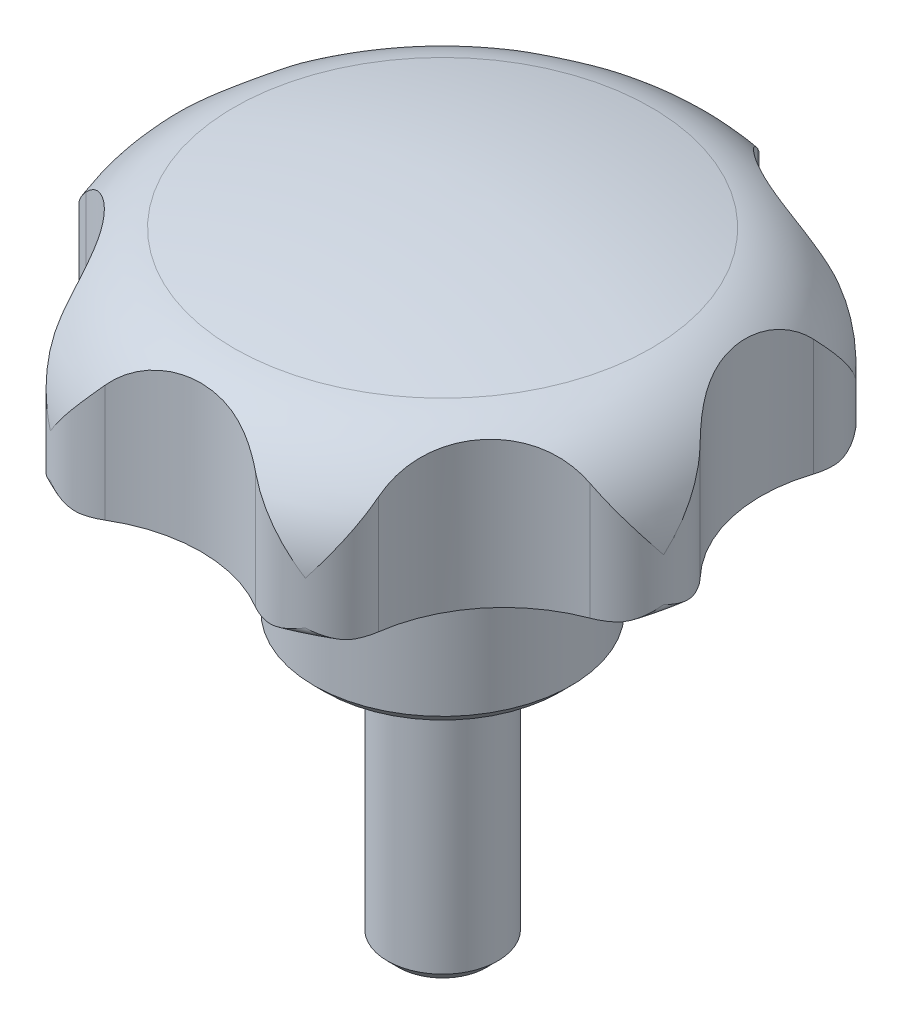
ISO-10303-21;
HEADER;
FILE_DESCRIPTION(('STEP AP214'),'2;1');
FILE_NAME('part.step','',(''),(''),'','','');
FILE_SCHEMA(('AUTOMOTIVE_DESIGN { 1 0 10303 214 1 1 1 1 }'));
ENDSEC;
DATA;
#1=APPLICATION_CONTEXT('core data for automotive mechanical design processes');
#2=APPLICATION_PROTOCOL_DEFINITION('international standard','automotive_design',2000,#1);
#3=PRODUCT_CONTEXT('',#1,'mechanical');
#4=PRODUCT('Part','Part','',(#3));
#5=PRODUCT_RELATED_PRODUCT_CATEGORY('part','',(#4));
#6=PRODUCT_DEFINITION_FORMATION('','',#4);
#7=PRODUCT_DEFINITION_CONTEXT('part definition',#1,'design');
#8=PRODUCT_DEFINITION('design','',#6,#7);
#9=PRODUCT_DEFINITION_SHAPE('','',#8);
#10=(LENGTH_UNIT() NAMED_UNIT(*) SI_UNIT(.MILLI.,.METRE.));
#11=(NAMED_UNIT(*) PLANE_ANGLE_UNIT() SI_UNIT($,.RADIAN.));
#12=(NAMED_UNIT(*) SI_UNIT($,.STERADIAN.) SOLID_ANGLE_UNIT());
#13=UNCERTAINTY_MEASURE_WITH_UNIT(LENGTH_MEASURE(1.E-05),#10,'distance_accuracy_value','');
#14=(GEOMETRIC_REPRESENTATION_CONTEXT(3) GLOBAL_UNCERTAINTY_ASSIGNED_CONTEXT((#13)) GLOBAL_UNIT_ASSIGNED_CONTEXT((#10,
#11,#12)) REPRESENTATION_CONTEXT('',''));
#15=CARTESIAN_POINT('',(0.,0.,0.));
#16=DIRECTION('',(0.,0.,1.));
#17=DIRECTION('',(1.,0.,0.));
#18=AXIS2_PLACEMENT_3D('',#15,#16,#17);
#19=CARTESIAN_POINT('',(6.4,0.,0.));
#20=DIRECTION('',(0.,1.,0.));
#21=DIRECTION('',(0.,0.,1.));
#22=AXIS2_PLACEMENT_3D('',#19,#20,#21);
#23=PLANE('',#22);
#24=CARTESIAN_POINT('',(0.,0.,0.));
#25=DIRECTION('',(0.,1.,0.));
#26=DIRECTION('',(0.,0.,1.));
#27=AXIS2_PLACEMENT_3D('',#24,#25,#26);
#28=CIRCLE('',#27,6.4);
#29=CARTESIAN_POINT('',(0.,0.,6.4));
#30=VERTEX_POINT('',#29);
#31=EDGE_CURVE('E1381',#30,#30,#28,.T.);
#32=ORIENTED_EDGE('',*,*,#31,.F.);
#33=EDGE_LOOP('',(#32));
#34=FACE_BOUND('',#33,.T.);
#35=CARTESIAN_POINT('',(0.,0.,0.));
#36=DIRECTION('',(0.,1.,0.));
#37=DIRECTION('',(0.,0.,1.));
#38=AXIS2_PLACEMENT_3D('',#35,#36,#37);
#39=CIRCLE('',#38,3.);
#40=CARTESIAN_POINT('',(0.,0.,3.));
#41=VERTEX_POINT('',#40);
#42=EDGE_CURVE('E12',#41,#41,#39,.F.);
#43=ORIENTED_EDGE('',*,*,#42,.F.);
#44=EDGE_LOOP('',(#43));
#45=FACE_BOUND('',#44,.T.);
#46=ADVANCED_FACE('F35',(#34,#45),#23,.F.);
#47=CARTESIAN_POINT('',(0.,0.,0.));
#48=DIRECTION('',(0.,1.,0.));
#49=DIRECTION('',(0.,0.,1.));
#50=AXIS2_PLACEMENT_3D('',#47,#48,#49);
#51=CYLINDRICAL_SURFACE('',#50,8.);
#52=CARTESIAN_POINT('',(0.,11.,0.));
#53=DIRECTION('',(0.,1.,0.));
#54=DIRECTION('',(0.,0.,1.));
#55=AXIS2_PLACEMENT_3D('',#52,#53,#54);
#56=CIRCLE('',#55,8.);
#57=CARTESIAN_POINT('',(0.,11.,8.));
#58=VERTEX_POINT('',#57);
#59=EDGE_CURVE('E1371',#58,#58,#56,.T.);
#60=ORIENTED_EDGE('',*,*,#59,.T.);
#61=EDGE_LOOP('',(#60));
#62=FACE_BOUND('',#61,.T.);
#63=CARTESIAN_POINT('',(0.,17.,0.));
#64=DIRECTION('',(0.,1.,0.));
#65=DIRECTION('',(0.,0.,1.));
#66=AXIS2_PLACEMENT_3D('',#63,#64,#65);
#67=CIRCLE('',#66,8.);
#68=CARTESIAN_POINT('',(0.,17.,8.));
#69=VERTEX_POINT('',#68);
#70=EDGE_CURVE('E323',#69,#69,#67,.T.);
#71=ORIENTED_EDGE('',*,*,#70,.F.);
#72=EDGE_LOOP('',(#71));
#73=FACE_BOUND('',#72,.T.);
#74=ADVANCED_FACE('F904',(#62,#73),#51,.T.);
#75=CARTESIAN_POINT('',(0.,10.,0.));
#76=DIRECTION('',(0.,1.,0.));
#77=DIRECTION('',(0.,0.,1.));
#78=AXIS2_PLACEMENT_3D('',#75,#76,#77);
#79=CONICAL_SURFACE('',#78,7.,0.785398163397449);
#80=ORIENTED_EDGE('',*,*,#59,.F.);
#81=EDGE_LOOP('',(#80));
#82=FACE_BOUND('',#81,.T.);
#83=CARTESIAN_POINT('',(0.,10.,0.));
#84=DIRECTION('',(0.,1.,0.));
#85=DIRECTION('',(0.,0.,1.));
#86=AXIS2_PLACEMENT_3D('',#83,#84,#85);
#87=CIRCLE('',#86,7.);
#88=CARTESIAN_POINT('',(0.,10.,7.));
#89=VERTEX_POINT('',#88);
#90=EDGE_CURVE('E1374',#89,#89,#87,.T.);
#91=ORIENTED_EDGE('',*,*,#90,.T.);
#92=EDGE_LOOP('',(#91));
#93=FACE_BOUND('',#92,.T.);
#94=ADVANCED_FACE('F909',(#82,#93),#79,.T.);
#95=CARTESIAN_POINT('',(0.,0.,0.));
#96=DIRECTION('',(0.,1.,0.));
#97=DIRECTION('',(0.,0.,1.));
#98=AXIS2_PLACEMENT_3D('',#95,#96,#97);
#99=CYLINDRICAL_SURFACE('',#98,7.);
#100=ORIENTED_EDGE('',*,*,#90,.F.);
#101=EDGE_LOOP('',(#100));
#102=FACE_BOUND('',#101,.T.);
#103=CARTESIAN_POINT('',(0.,0.6,0.));
#104=DIRECTION('',(0.,1.,0.));
#105=DIRECTION('',(0.,0.,1.));
#106=AXIS2_PLACEMENT_3D('',#103,#104,#105);
#107=CIRCLE('',#106,7.);
#108=CARTESIAN_POINT('',(0.,0.6,7.));
#109=VERTEX_POINT('',#108);
#110=EDGE_CURVE('E1377',#109,#109,#107,.T.);
#111=ORIENTED_EDGE('',*,*,#110,.T.);
#112=EDGE_LOOP('',(#111));
#113=FACE_BOUND('',#112,.T.);
#114=ADVANCED_FACE('F919',(#102,#113),#99,.T.);
#115=CARTESIAN_POINT('',(0.,0.,0.));
#116=DIRECTION('',(0.,1.,0.));
#117=DIRECTION('',(0.,0.,1.));
#118=AXIS2_PLACEMENT_3D('',#115,#116,#117);
#119=CONICAL_SURFACE('',#118,6.4,0.785398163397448);
#120=ORIENTED_EDGE('',*,*,#110,.F.);
#121=EDGE_LOOP('',(#120));
#122=FACE_BOUND('',#121,.T.);
#123=ORIENTED_EDGE('',*,*,#31,.T.);
#124=EDGE_LOOP('',(#123));
#125=FACE_BOUND('',#124,.T.);
#126=ADVANCED_FACE('F915',(#122,#125),#119,.T.);
#127=CARTESIAN_POINT('',(-15.0242801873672,17.,-0.981463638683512));
#128=DIRECTION('',(0.,-1.,0.));
#129=DIRECTION('',(0.,0.,-1.));
#130=AXIS2_PLACEMENT_3D('',#127,#128,#129);
#131=PLANE('',#130);
#132=ORIENTED_EDGE('',*,*,#70,.T.);
#133=EDGE_LOOP('',(#132));
#134=FACE_BOUND('',#133,.T.);
#135=CARTESIAN_POINT('',(0.,17.,0.));
#136=DIRECTION('',(0.,1.,0.));
#137=DIRECTION('',(0.,0.,1.));
#138=AXIS2_PLACEMENT_3D('',#135,#136,#137);
#139=CIRCLE('',#138,8.07707739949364);
#140=CARTESIAN_POINT('',(0.,17.,8.07707739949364));
#141=VERTEX_POINT('',#140);
#142=EDGE_CURVE('E328',#141,#141,#139,.F.);
#143=ORIENTED_EDGE('',*,*,#142,.T.);
#144=EDGE_LOOP('',(#143));
#145=FACE_BOUND('',#144,.T.);
#146=ADVANCED_FACE('F918',(#134,#145),#131,.T.);
#147=CARTESIAN_POINT('',(0.,16.7332857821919,0.));
#148=DIRECTION('',(0.,1.,0.));
#149=DIRECTION('',(0.,0.,1.));
#150=AXIS2_PLACEMENT_3D('',#147,#148,#149);
#151=TOROIDAL_SURFACE('',#150,8.50000000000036,0.500000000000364);
#152=CARTESIAN_POINT('',(0.,17.225215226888,0.));
#153=DIRECTION('',(0.,1.,0.));
#154=DIRECTION('',(0.,0.,1.));
#155=AXIS2_PLACEMENT_3D('',#152,#153,#154);
#156=CIRCLE('',#155,8.5894730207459);
#157=CARTESIAN_POINT('',(8.58947302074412,17.225215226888,0.));
#158=VERTEX_POINT('',#157);
#159=EDGE_CURVE('E966',#158,#158,#156,.T.);
#160=ORIENTED_EDGE('',*,*,#159,.F.);
#161=EDGE_LOOP('',(#160));
#162=FACE_BOUND('',#161,.T.);
#163=ORIENTED_EDGE('',*,*,#142,.F.);
#164=EDGE_LOOP('',(#163));
#165=FACE_BOUND('',#164,.T.);
#166=ADVANCED_FACE('F927',(#162,#165),#151,.F.);
#167=CARTESIAN_POINT('',(-5.29871285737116E-12,-30.0000000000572,0.));
#168=DIRECTION('',(0.,1.,0.));
#169=DIRECTION('',(1.,0.,0.));
#170=AXIS2_PLACEMENT_3D('',#167,#168,#169);
#171=SPHERICAL_SURFACE('',#170,48.0000000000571);
#172=CARTESIAN_POINT('',(-5.29871285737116E-12,17.,0.));
#173=DIRECTION('',(0.,-1.,0.));
#174=DIRECTION('',(0.,0.,-1.));
#175=AXIS2_PLACEMENT_3D('',#172,#173,#174);
#176=CIRCLE('',#175,9.74679434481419);
#177=CARTESIAN_POINT('',(9.74679434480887,17.,0.));
#178=VERTEX_POINT('',#177);
#179=EDGE_CURVE('E332',#178,#178,#176,.F.);
#180=CARTESIAN_POINT('',(8.58947302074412,17.225215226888,0.));
#181=CARTESIAN_POINT('',(8.60155665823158,17.2230174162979,0.));
#182=CARTESIAN_POINT('',(8.6136394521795,17.2208149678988,0.));
#183=CARTESIAN_POINT('',(8.63780334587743,17.2164007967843,0.));
#184=CARTESIAN_POINT('',(8.64988444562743,17.214189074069,0.));
#185=CARTESIAN_POINT('',(8.67404494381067,17.2097563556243,0.));
#186=CARTESIAN_POINT('',(8.68612434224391,17.207535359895,0.));
#187=CARTESIAN_POINT('',(8.71028143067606,17.2030840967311,0.));
#188=CARTESIAN_POINT('',(8.72235912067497,17.2008538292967,0.));
#189=CARTESIAN_POINT('',(8.74651278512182,17.1963840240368,0.));
#190=CARTESIAN_POINT('',(8.75858875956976,17.1941444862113,0.));
#191=CARTESIAN_POINT('',(8.78273898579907,17.1896561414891,0.));
#192=CARTESIAN_POINT('',(8.79481323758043,17.1874073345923,0.));
#193=CARTESIAN_POINT('',(8.81896001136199,17.1829004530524,0.));
#194=CARTESIAN_POINT('',(8.83103253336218,17.1806423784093,0.));
#195=CARTESIAN_POINT('',(8.85517584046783,17.1761169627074,0.));
#196=CARTESIAN_POINT('',(8.86724662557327,17.1738496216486,0.));
#197=CARTESIAN_POINT('',(8.89138645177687,17.1693056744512,0.));
#198=CARTESIAN_POINT('',(8.90345549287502,17.1670290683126,0.));
#199=CARTESIAN_POINT('',(8.92759182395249,17.1624665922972,0.));
#200=CARTESIAN_POINT('',(8.93965911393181,17.1601807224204,0.));
#201=CARTESIAN_POINT('',(8.96379193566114,17.1555997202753,0.));
#202=CARTESIAN_POINT('',(8.97585746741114,17.1533045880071,0.));
#203=CARTESIAN_POINT('',(8.99998676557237,17.1487050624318,0.));
#204=CARTESIAN_POINT('',(9.0120505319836,17.1464006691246,0.));
#205=CARTESIAN_POINT('',(9.03617629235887,17.1417826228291,0.));
#206=CARTESIAN_POINT('',(9.04823828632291,17.1394689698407,0.));
#207=CARTESIAN_POINT('',(9.07236049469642,17.1348324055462,0.));
#208=CARTESIAN_POINT('',(9.08442070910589,17.13250949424,0.));
#209=CARTESIAN_POINT('',(9.10853935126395,17.1278544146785,0.));
#210=CARTESIAN_POINT('',(9.12059777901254,17.1255222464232,0.));
#211=CARTESIAN_POINT('',(9.14471284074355,17.1208486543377,0.));
#212=CARTESIAN_POINT('',(9.15676947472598,17.1185072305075,0.));
#213=CARTESIAN_POINT('',(9.18088094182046,17.1138151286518,0.));
#214=CARTESIAN_POINT('',(9.19293577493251,17.1114644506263,0.));
#215=CARTESIAN_POINT('',(9.21704363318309,17.1067538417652,0.));
#216=CARTESIAN_POINT('',(9.22909665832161,17.1043939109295,0.));
#217=CARTESIAN_POINT('',(9.25320089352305,17.0996647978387,0.));
#218=CARTESIAN_POINT('',(9.26525210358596,17.0972956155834,0.));
#219=CARTESIAN_POINT('',(9.28935270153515,17.0925480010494,0.));
#220=CARTESIAN_POINT('',(9.30140208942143,17.0901695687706,0.));
#221=CARTESIAN_POINT('',(9.3254990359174,17.0854034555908,0.));
#222=CARTESIAN_POINT('',(9.33754659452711,17.0830157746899,0.));
#223=CARTESIAN_POINT('',(9.36163987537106,17.0782311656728,0.));
#224=CARTESIAN_POINT('',(9.37368559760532,17.0758342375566,0.));
#225=CARTESIAN_POINT('',(9.3977751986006,17.0710311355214,0.));
#226=CARTESIAN_POINT('',(9.40981907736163,17.0686249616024,0.));
#227=CARTESIAN_POINT('',(9.43390498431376,17.0638033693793,0.));
#228=CARTESIAN_POINT('',(9.44594701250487,17.0613879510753,0.));
#229=CARTESIAN_POINT('',(9.47002921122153,17.0565478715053,0.));
#230=CARTESIAN_POINT('',(9.4820693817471,17.0541232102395,0.));
#231=CARTESIAN_POINT('',(9.50614785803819,17.0492646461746,0.));
#232=CARTESIAN_POINT('',(9.51818616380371,17.0468307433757,0.));
#233=CARTESIAN_POINT('',(9.54226090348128,17.0419536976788,0.));
#234=CARTESIAN_POINT('',(9.55429733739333,17.0395105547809,0.));
#235=CARTESIAN_POINT('',(9.57836832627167,17.0346150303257,0.));
#236=CARTESIAN_POINT('',(9.59040288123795,17.0321626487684,0.));
#237=CARTESIAN_POINT('',(9.61447010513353,17.0272486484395,0.));
#238=CARTESIAN_POINT('',(9.62650277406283,17.0247870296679,0.));
#239=CARTESIAN_POINT('',(9.65056621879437,17.0198545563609,0.));
#240=CARTESIAN_POINT('',(9.66259699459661,17.0173837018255,0.));
#241=CARTESIAN_POINT('',(9.68665664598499,17.0124327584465,0.));
#242=CARTESIAN_POINT('',(9.69868552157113,17.0099526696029,0.));
#243=CARTESIAN_POINT('',(9.72274136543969,17.0049832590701,0.));
#244=CARTESIAN_POINT('',(9.73476833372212,17.0024939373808,0.));
#245=CARTESIAN_POINT('',(9.74679434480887,17.,0.));
#246=B_SPLINE_CURVE_WITH_KNOTS('',3,(#180,#181,#182,#183,#184,#185,#186,#187,#188,#189,#190,
#191,#192,#193,#194,#195,#196,#197,#198,#199,#200,#201,#202,#203,#204,#205,#206,#207,#208,#209,
#210,#211,#212,#213,#214,#215,#216,#217,#218,#219,#220,#221,#222,#223,#224,#225,#226,#227,#228,
#229,#230,#231,#232,#233,#234,#235,#236,#237,#238,#239,#240,#241,#242,#243,#244,#245),
.UNSPECIFIED.,.F.,.F.,(4,2,2,2,2,2,2,2,2,2,2,2,2,2,2,2,2,2,2,2,2,2,2,2,2,2,2,2,2,2,2,2,4),(0.,
0.0368456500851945,0.0736913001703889,0.110536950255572,0.147382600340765,0.184228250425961,
0.221073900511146,0.257919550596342,0.294765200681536,0.331610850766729,0.368456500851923,
0.405302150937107,0.442147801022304,0.478993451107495,0.515839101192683,0.552684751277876,
0.589530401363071,0.626376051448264,0.66322170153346,0.700067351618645,0.736913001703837,
0.773758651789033,0.810604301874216,0.847449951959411,0.884295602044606,0.921141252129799,
0.957986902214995,0.99483255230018,1.03167820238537,1.06852385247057,1.10536950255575,
1.14221515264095,1.17906080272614),.UNSPECIFIED.);
#247=EDGE_CURVE('BSEAM930',#158,#178,#246,.T.);
#248=ORIENTED_EDGE('',*,*,#159,.T.);
#249=ORIENTED_EDGE('',*,*,#179,.F.);
#250=ORIENTED_EDGE('',*,*,#247,.T.);
#251=ORIENTED_EDGE('',*,*,#247,.F.);
#252=EDGE_LOOP('',(#248,#250,#249,#251));
#253=FACE_BOUND('',#252,.T.);
#254=ADVANCED_FACE('F930',(#253),#171,.F.);
#255=CARTESIAN_POINT('',(-19.324353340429,17.,-4.41065754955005));
#256=DIRECTION('',(0.,-1.,0.));
#257=DIRECTION('',(0.,0.,-1.));
#258=AXIS2_PLACEMENT_3D('',#255,#256,#257);
#259=CYLINDRICAL_SURFACE('',#258,8.0000000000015);
#260=CARTESIAN_POINT('',(-19.324353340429,10.,-4.41065754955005));
#261=DIRECTION('',(0.,1.,0.));
#262=DIRECTION('',(0.,0.,1.));
#263=AXIS2_PLACEMENT_3D('',#260,#261,#262);
#264=CIRCLE('',#263,8.0000000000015);
#265=CARTESIAN_POINT('',(-13.069701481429,10.,0.577260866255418));
#266=VERTEX_POINT('',#265);
#267=CARTESIAN_POINT('',(-11.5249300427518,10.,-6.19082502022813));
#268=VERTEX_POINT('',#267);
#269=EDGE_CURVE('E43',#266,#268,#264,.T.);
#270=ORIENTED_EDGE('',*,*,#269,.T.);
#271=DIRECTION('',(0.,-1.,0.));
#272=VECTOR('',#271,1.);
#273=CARTESIAN_POINT('',(-11.5249300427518,17.,-6.19082502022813));
#274=LINE('',#273,#272);
#275=CARTESIAN_POINT('',(-11.5249300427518,17.,-6.19082502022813));
#276=VERTEX_POINT('',#275);
#277=EDGE_CURVE('E50',#276,#268,#274,.T.);
#278=ORIENTED_EDGE('',*,*,#277,.F.);
#279=CARTESIAN_POINT('',(-19.324353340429,17.,-4.41065754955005));
#280=DIRECTION('',(0.,-1.,0.));
#281=DIRECTION('',(0.,0.,-1.));
#282=AXIS2_PLACEMENT_3D('',#279,#280,#281);
#283=CIRCLE('',#282,8.0000000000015);
#284=CARTESIAN_POINT('',(-13.069701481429,17.,0.577260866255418));
#285=VERTEX_POINT('',#284);
#286=EDGE_CURVE('E310',#276,#285,#283,.T.);
#287=ORIENTED_EDGE('',*,*,#286,.T.);
#288=DIRECTION('',(0.,-1.,0.));
#289=VECTOR('',#288,1.);
#290=CARTESIAN_POINT('',(-13.069701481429,17.,0.577260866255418));
#291=LINE('',#290,#289);
#292=EDGE_CURVE('E321',#285,#266,#291,.T.);
#293=ORIENTED_EDGE('',*,*,#292,.T.);
#294=EDGE_LOOP('',(#270,#278,#287,#293));
#295=FACE_BOUND('',#294,.T.);
#296=ADVANCED_FACE('F320',(#295),#259,.T.);
#297=CARTESIAN_POINT('',(-10.7242070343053,17.,2.44773027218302));
#298=DIRECTION('',(0.,-1.,0.));
#299=DIRECTION('',(0.,0.,-1.));
#300=AXIS2_PLACEMENT_3D('',#297,#298,#299);
#301=CYLINDRICAL_SURFACE('',#300,2.99999999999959);
#302=CARTESIAN_POINT('',(-10.7242070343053,10.,2.44773027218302));
#303=DIRECTION('',(0.,1.,0.));
#304=DIRECTION('',(0.,0.,1.));
#305=AXIS2_PLACEMENT_3D('',#302,#303,#304);
#306=CIRCLE('',#305,2.99999999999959);
#307=CARTESIAN_POINT('',(-12.0258582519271,10.,5.15063687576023));
#308=VERTEX_POINT('',#307);
#309=EDGE_CURVE('E327',#308,#266,#306,.F.);
#310=ORIENTED_EDGE('',*,*,#309,.T.);
#311=ORIENTED_EDGE('',*,*,#292,.F.);
#312=CARTESIAN_POINT('',(-10.7242070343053,17.,2.44773027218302));
#313=DIRECTION('',(0.,1.,0.));
#314=DIRECTION('',(0.,0.,1.));
#315=AXIS2_PLACEMENT_3D('',#312,#313,#314);
#316=CIRCLE('',#315,2.99999999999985);
#317=CARTESIAN_POINT('',(-12.0258582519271,17.,5.15063687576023));
#318=VERTEX_POINT('',#317);
#319=EDGE_CURVE('E305',#285,#318,#316,.T.);
#320=ORIENTED_EDGE('',*,*,#319,.T.);
#321=DIRECTION('',(0.,-1.,0.));
#322=VECTOR('',#321,1.);
#323=CARTESIAN_POINT('',(-12.0258582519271,17.,5.15063687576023));
#324=LINE('',#323,#322);
#325=EDGE_CURVE('E329',#318,#308,#324,.T.);
#326=ORIENTED_EDGE('',*,*,#325,.T.);
#327=EDGE_LOOP('',(#310,#311,#320,#326));
#328=FACE_BOUND('',#327,.T.);
#329=ADVANCED_FACE('F325',(#328),#301,.F.);
#330=CARTESIAN_POINT('',(-15.4969281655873,17.,12.3583878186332));
#331=DIRECTION('',(0.,-1.,0.));
#332=DIRECTION('',(0.,0.,-1.));
#333=AXIS2_PLACEMENT_3D('',#330,#331,#332);
#334=CYLINDRICAL_SURFACE('',#333,8.00000000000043);
#335=CARTESIAN_POINT('',(-15.4969281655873,10.,12.3583878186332));
#336=DIRECTION('',(0.,1.,0.));
#337=DIRECTION('',(0.,0.,1.));
#338=AXIS2_PLACEMENT_3D('',#335,#336,#337);
#339=CIRCLE('',#338,8.00000000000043);
#340=CARTESIAN_POINT('',(-7.6975048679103,10.,10.578220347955));
#341=VERTEX_POINT('',#340);
#342=EDGE_CURVE('E781',#341,#308,#339,.T.);
#343=ORIENTED_EDGE('',*,*,#342,.T.);
#344=ORIENTED_EDGE('',*,*,#325,.F.);
#345=CARTESIAN_POINT('',(-15.4969281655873,17.,12.3583878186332));
#346=DIRECTION('',(0.,-1.,0.));
#347=DIRECTION('',(0.,0.,-1.));
#348=AXIS2_PLACEMENT_3D('',#345,#346,#347);
#349=CIRCLE('',#348,8.00000000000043);
#350=CARTESIAN_POINT('',(-7.6975048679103,17.,10.578220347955));
#351=VERTEX_POINT('',#350);
#352=EDGE_CURVE('E312',#318,#351,#349,.T.);
#353=ORIENTED_EDGE('',*,*,#352,.T.);
#354=DIRECTION('',(0.,-1.,0.));
#355=VECTOR('',#354,1.);
#356=CARTESIAN_POINT('',(-7.6975048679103,17.,10.578220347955));
#357=LINE('',#356,#355);
#358=EDGE_CURVE('E334',#351,#341,#357,.T.);
#359=ORIENTED_EDGE('',*,*,#358,.T.);
#360=EDGE_LOOP('',(#343,#344,#353,#359));
#361=FACE_BOUND('',#360,.T.);
#362=ADVANCED_FACE('F832',(#361),#334,.T.);
#363=CARTESIAN_POINT('',(-4.77272113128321,17.,9.91065754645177));
#364=DIRECTION('',(0.,-1.,0.));
#365=DIRECTION('',(0.,0.,-1.));
#366=AXIS2_PLACEMENT_3D('',#363,#364,#365);
#367=CYLINDRICAL_SURFACE('',#366,2.99999999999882);
#368=CARTESIAN_POINT('',(-4.77272113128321,10.,9.91065754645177));
#369=DIRECTION('',(0.,1.,0.));
#370=DIRECTION('',(0.,0.,1.));
#371=AXIS2_PLACEMENT_3D('',#368,#369,#370);
#372=CIRCLE('',#371,2.99999999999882);
#373=CARTESIAN_POINT('',(-3.47106991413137,10.,12.6135641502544));
#374=VERTEX_POINT('',#373);
#375=EDGE_CURVE('E779',#374,#341,#372,.F.);
#376=ORIENTED_EDGE('',*,*,#375,.T.);
#377=ORIENTED_EDGE('',*,*,#358,.F.);
#378=CARTESIAN_POINT('',(-4.77272113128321,17.,9.91065754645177));
#379=DIRECTION('',(0.,1.,0.));
#380=DIRECTION('',(0.,0.,1.));
#381=AXIS2_PLACEMENT_3D('',#378,#379,#380);
#382=CIRCLE('',#381,2.99999999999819);
#383=CARTESIAN_POINT('',(-3.47106991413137,17.,12.6135641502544));
#384=VERTEX_POINT('',#383);
#385=EDGE_CURVE('E839',#351,#384,#382,.T.);
#386=ORIENTED_EDGE('',*,*,#385,.T.);
#387=DIRECTION('',(0.,-1.,0.));
#388=VECTOR('',#387,1.);
#389=CARTESIAN_POINT('',(-3.47106991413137,17.,12.6135641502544));
#390=LINE('',#389,#388);
#391=EDGE_CURVE('E826',#384,#374,#390,.T.);
#392=ORIENTED_EDGE('',*,*,#391,.T.);
#393=EDGE_LOOP('',(#376,#377,#386,#392));
#394=FACE_BOUND('',#393,.T.);
#395=ADVANCED_FACE('F837',(#394),#367,.F.);
#396=CARTESIAN_POINT('',(-1.72993529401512E-09,17.,19.8213150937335));
#397=DIRECTION('',(0.,-1.,0.));
#398=DIRECTION('',(0.,0.,-1.));
#399=AXIS2_PLACEMENT_3D('',#396,#397,#398);
#400=CYLINDRICAL_SURFACE('',#399,7.99999999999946);
#401=CARTESIAN_POINT('',(-1.72993529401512E-09,10.,19.8213150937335));
#402=DIRECTION('',(0.,1.,0.));
#403=DIRECTION('',(0.,0.,1.));
#404=AXIS2_PLACEMENT_3D('',#401,#402,#403);
#405=CIRCLE('',#404,7.99999999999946);
#406=CARTESIAN_POINT('',(3.4710699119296,10.,12.613564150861));
#407=VERTEX_POINT('',#406);
#408=EDGE_CURVE('E777',#407,#374,#405,.T.);
#409=ORIENTED_EDGE('',*,*,#408,.T.);
#410=ORIENTED_EDGE('',*,*,#391,.F.);
#411=CARTESIAN_POINT('',(-1.72993529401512E-09,17.,19.8213150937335));
#412=DIRECTION('',(0.,-1.,0.));
#413=DIRECTION('',(0.,0.,-1.));
#414=AXIS2_PLACEMENT_3D('',#411,#412,#413);
#415=CIRCLE('',#414,7.99999999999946);
#416=CARTESIAN_POINT('',(3.4710699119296,17.,12.613564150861));
#417=VERTEX_POINT('',#416);
#418=EDGE_CURVE('E843',#384,#417,#415,.T.);
#419=ORIENTED_EDGE('',*,*,#418,.T.);
#420=DIRECTION('',(0.,-1.,0.));
#421=VECTOR('',#420,1.);
#422=CARTESIAN_POINT('',(3.4710699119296,17.,12.613564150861));
#423=LINE('',#422,#421);
#424=EDGE_CURVE('E823',#417,#407,#423,.T.);
#425=ORIENTED_EDGE('',*,*,#424,.T.);
#426=EDGE_LOOP('',(#409,#410,#419,#425));
#427=FACE_BOUND('',#426,.T.);
#428=ADVANCED_FACE('F842',(#427),#400,.T.);
#429=CARTESIAN_POINT('',(4.77272112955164,17.,9.9106575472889));
#430=DIRECTION('',(0.,-1.,0.));
#431=DIRECTION('',(0.,0.,-1.));
#432=AXIS2_PLACEMENT_3D('',#429,#430,#431);
#433=CYLINDRICAL_SURFACE('',#432,2.999999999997);
#434=CARTESIAN_POINT('',(4.77272112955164,10.,9.9106575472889));
#435=DIRECTION('',(0.,1.,0.));
#436=DIRECTION('',(0.,0.,1.));
#437=AXIS2_PLACEMENT_3D('',#434,#435,#436);
#438=CIRCLE('',#437,2.999999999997);
#439=CARTESIAN_POINT('',(7.69750486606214,10.,10.5782203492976));
#440=VERTEX_POINT('',#439);
#441=EDGE_CURVE('E775',#440,#407,#438,.F.);
#442=ORIENTED_EDGE('',*,*,#441,.T.);
#443=ORIENTED_EDGE('',*,*,#424,.F.);
#444=CARTESIAN_POINT('',(4.77272112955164,17.,9.9106575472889));
#445=DIRECTION('',(0.,1.,0.));
#446=DIRECTION('',(0.,0.,1.));
#447=AXIS2_PLACEMENT_3D('',#444,#445,#446);
#448=CIRCLE('',#447,2.9999999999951);
#449=CARTESIAN_POINT('',(7.69750486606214,17.,10.5782203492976));
#450=VERTEX_POINT('',#449);
#451=EDGE_CURVE('E847',#417,#450,#448,.T.);
#452=ORIENTED_EDGE('',*,*,#451,.T.);
#453=DIRECTION('',(0.,-1.,0.));
#454=VECTOR('',#453,1.);
#455=CARTESIAN_POINT('',(7.69750486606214,17.,10.5782203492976));
#456=LINE('',#455,#454);
#457=EDGE_CURVE('E820',#450,#440,#456,.T.);
#458=ORIENTED_EDGE('',*,*,#457,.T.);
#459=EDGE_LOOP('',(#442,#443,#452,#458));
#460=FACE_BOUND('',#459,.T.);
#461=ADVANCED_FACE('F894',(#460),#433,.F.);
#462=CARTESIAN_POINT('',(15.496928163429,17.,12.3583878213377));
#463=DIRECTION('',(0.,-1.,0.));
#464=DIRECTION('',(0.,0.,-1.));
#465=AXIS2_PLACEMENT_3D('',#462,#463,#464);
#466=CYLINDRICAL_SURFACE('',#465,7.99999999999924);
#467=CARTESIAN_POINT('',(15.496928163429,10.,12.3583878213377));
#468=DIRECTION('',(0.,1.,0.));
#469=DIRECTION('',(0.,0.,1.));
#470=AXIS2_PLACEMENT_3D('',#467,#468,#469);
#471=CIRCLE('',#470,7.99999999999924);
#472=CARTESIAN_POINT('',(12.025858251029,10.,5.1506368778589));
#473=VERTEX_POINT('',#472);
#474=EDGE_CURVE('E773',#473,#440,#471,.T.);
#475=ORIENTED_EDGE('',*,*,#474,.T.);
#476=ORIENTED_EDGE('',*,*,#457,.F.);
#477=CARTESIAN_POINT('',(15.496928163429,17.,12.3583878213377));
#478=DIRECTION('',(0.,-1.,0.));
#479=DIRECTION('',(0.,0.,-1.));
#480=AXIS2_PLACEMENT_3D('',#477,#478,#479);
#481=CIRCLE('',#480,7.99999999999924);
#482=CARTESIAN_POINT('',(12.025858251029,17.,5.1506368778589));
#483=VERTEX_POINT('',#482);
#484=EDGE_CURVE('E849',#450,#483,#481,.T.);
#485=ORIENTED_EDGE('',*,*,#484,.T.);
#486=DIRECTION('',(0.,-1.,0.));
#487=VECTOR('',#486,1.);
#488=CARTESIAN_POINT('',(12.025858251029,17.,5.1506368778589));
#489=LINE('',#488,#487);
#490=EDGE_CURVE('E817',#483,#473,#489,.T.);
#491=ORIENTED_EDGE('',*,*,#490,.T.);
#492=EDGE_LOOP('',(#475,#476,#485,#491));
#493=FACE_BOUND('',#492,.T.);
#494=ADVANCED_FACE('F891',(#493),#466,.T.);
#495=CARTESIAN_POINT('',(10.7242070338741,17.,2.44773027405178));
#496=DIRECTION('',(0.,-1.,0.));
#497=DIRECTION('',(0.,0.,-1.));
#498=AXIS2_PLACEMENT_3D('',#495,#496,#497);
#499=CYLINDRICAL_SURFACE('',#498,3.00000000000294);
#500=CARTESIAN_POINT('',(10.7242070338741,10.,2.44773027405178));
#501=DIRECTION('',(0.,1.,0.));
#502=DIRECTION('',(0.,0.,1.));
#503=AXIS2_PLACEMENT_3D('',#500,#501,#502);
#504=CIRCLE('',#503,3.00000000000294);
#505=CARTESIAN_POINT('',(13.06970148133,10.,0.577260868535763));
#506=VERTEX_POINT('',#505);
#507=EDGE_CURVE('E771',#506,#473,#504,.F.);
#508=ORIENTED_EDGE('',*,*,#507,.T.);
#509=ORIENTED_EDGE('',*,*,#490,.F.);
#510=CARTESIAN_POINT('',(10.7242070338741,17.,2.44773027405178));
#511=DIRECTION('',(0.,1.,0.));
#512=DIRECTION('',(0.,0.,1.));
#513=AXIS2_PLACEMENT_3D('',#510,#511,#512);
#514=CIRCLE('',#513,3.00000000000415);
#515=CARTESIAN_POINT('',(13.06970148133,17.,0.577260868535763));
#516=VERTEX_POINT('',#515);
#517=EDGE_CURVE('E855',#483,#516,#514,.T.);
#518=ORIENTED_EDGE('',*,*,#517,.T.);
#519=DIRECTION('',(0.,-1.,0.));
#520=VECTOR('',#519,1.);
#521=CARTESIAN_POINT('',(13.06970148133,17.,0.577260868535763));
#522=LINE('',#521,#520);
#523=EDGE_CURVE('E814',#516,#506,#522,.T.);
#524=ORIENTED_EDGE('',*,*,#523,.T.);
#525=EDGE_LOOP('',(#508,#509,#518,#524));
#526=FACE_BOUND('',#525,.T.);
#527=ADVANCED_FACE('F888',(#526),#499,.F.);
#528=CARTESIAN_POINT('',(19.3243533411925,17.,-4.41065754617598));
#529=DIRECTION('',(0.,-1.,0.));
#530=DIRECTION('',(0.,0.,-1.));
#531=AXIS2_PLACEMENT_3D('',#528,#529,#530);
#532=CYLINDRICAL_SURFACE('',#531,7.99999999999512);
#533=CARTESIAN_POINT('',(19.3243533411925,10.,-4.41065754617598));
#534=DIRECTION('',(0.,1.,0.));
#535=DIRECTION('',(0.,0.,1.));
#536=AXIS2_PLACEMENT_3D('',#533,#534,#535);
#537=CIRCLE('',#536,7.99999999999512);
#538=CARTESIAN_POINT('',(11.524930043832,10.,-6.1908250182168));
#539=VERTEX_POINT('',#538);
#540=EDGE_CURVE('E769',#539,#506,#537,.T.);
#541=ORIENTED_EDGE('',*,*,#540,.T.);
#542=ORIENTED_EDGE('',*,*,#523,.F.);
#543=CARTESIAN_POINT('',(19.3243533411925,17.,-4.41065754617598));
#544=DIRECTION('',(0.,-1.,0.));
#545=DIRECTION('',(0.,0.,-1.));
#546=AXIS2_PLACEMENT_3D('',#543,#544,#545);
#547=CIRCLE('',#546,7.99999999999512);
#548=CARTESIAN_POINT('',(11.524930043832,17.,-6.1908250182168));
#549=VERTEX_POINT('',#548);
#550=EDGE_CURVE('E857',#516,#549,#547,.T.);
#551=ORIENTED_EDGE('',*,*,#550,.T.);
#552=DIRECTION('',(0.,-1.,0.));
#553=VECTOR('',#552,1.);
#554=CARTESIAN_POINT('',(11.524930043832,17.,-6.1908250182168));
#555=LINE('',#554,#553);
#556=EDGE_CURVE('E811',#549,#539,#555,.T.);
#557=ORIENTED_EDGE('',*,*,#556,.T.);
#558=EDGE_LOOP('',(#541,#542,#551,#557));
#559=FACE_BOUND('',#558,.T.);
#560=ADVANCED_FACE('F882',(#559),#532,.T.);
#561=CARTESIAN_POINT('',(8.6001463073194,17.,-6.85838782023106));
#562=DIRECTION('',(0.,-1.,0.));
#563=DIRECTION('',(0.,0.,-1.));
#564=AXIS2_PLACEMENT_3D('',#561,#562,#563);
#565=CYLINDRICAL_SURFACE('',#564,3.00000000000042);
#566=CARTESIAN_POINT('',(8.6001463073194,10.,-6.85838782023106));
#567=DIRECTION('',(0.,1.,0.));
#568=DIRECTION('',(0.,0.,1.));
#569=AXIS2_PLACEMENT_3D('',#566,#567,#568);
#570=CIRCLE('',#569,3.00000000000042);
#571=CARTESIAN_POINT('',(8.6001463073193,10.,-9.85838782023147));
#572=VERTEX_POINT('',#571);
#573=EDGE_CURVE('E767',#572,#539,#570,.F.);
#574=ORIENTED_EDGE('',*,*,#573,.T.);
#575=ORIENTED_EDGE('',*,*,#556,.F.);
#576=CARTESIAN_POINT('',(8.6001463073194,17.,-6.85838782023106));
#577=DIRECTION('',(0.,1.,0.));
#578=DIRECTION('',(0.,0.,1.));
#579=AXIS2_PLACEMENT_3D('',#576,#577,#578);
#580=CIRCLE('',#579,3.00000000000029);
#581=CARTESIAN_POINT('',(8.6001463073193,17.,-9.85838782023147));
#582=VERTEX_POINT('',#581);
#583=EDGE_CURVE('E859',#549,#582,#580,.T.);
#584=ORIENTED_EDGE('',*,*,#583,.T.);
#585=DIRECTION('',(0.,-1.,0.));
#586=VECTOR('',#585,1.);
#587=CARTESIAN_POINT('',(8.6001463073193,17.,-9.85838782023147));
#588=LINE('',#587,#586);
#589=EDGE_CURVE('E808',#582,#572,#588,.T.);
#590=ORIENTED_EDGE('',*,*,#589,.T.);
#591=EDGE_LOOP('',(#574,#575,#584,#590));
#592=FACE_BOUND('',#591,.T.);
#593=ADVANCED_FACE('F880',(#592),#565,.F.);
#594=CARTESIAN_POINT('',(8.60014630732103,17.,-17.8583878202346));
#595=DIRECTION('',(0.,-1.,0.));
#596=DIRECTION('',(0.,0.,-1.));
#597=AXIS2_PLACEMENT_3D('',#594,#595,#596);
#598=CYLINDRICAL_SURFACE('',#597,8.00000000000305);
#599=CARTESIAN_POINT('',(8.60014630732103,10.,-17.8583878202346));
#600=DIRECTION('',(0.,1.,0.));
#601=DIRECTION('',(0.,0.,1.));
#602=AXIS2_PLACEMENT_3D('',#599,#600,#601);
#603=CIRCLE('',#602,8.00000000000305);
#604=CARTESIAN_POINT('',(2.3454944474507,10.,-12.870469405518));
#605=VERTEX_POINT('',#604);
#606=EDGE_CURVE('E765',#605,#572,#603,.T.);
#607=ORIENTED_EDGE('',*,*,#606,.T.);
#608=ORIENTED_EDGE('',*,*,#589,.F.);
#609=CARTESIAN_POINT('',(8.60014630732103,17.,-17.8583878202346));
#610=DIRECTION('',(0.,-1.,0.));
#611=DIRECTION('',(0.,0.,-1.));
#612=AXIS2_PLACEMENT_3D('',#609,#610,#611);
#613=CIRCLE('',#612,8.00000000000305);
#614=CARTESIAN_POINT('',(2.3454944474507,17.,-12.870469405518));
#615=VERTEX_POINT('',#614);
#616=EDGE_CURVE('E861',#582,#615,#613,.T.);
#617=ORIENTED_EDGE('',*,*,#616,.T.);
#618=DIRECTION('',(0.,-1.,0.));
#619=VECTOR('',#618,1.);
#620=CARTESIAN_POINT('',(2.3454944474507,17.,-12.870469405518));
#621=LINE('',#620,#619);
#622=EDGE_CURVE('E800',#615,#605,#621,.T.);
#623=ORIENTED_EDGE('',*,*,#622,.T.);
#624=EDGE_LOOP('',(#607,#608,#617,#623));
#625=FACE_BOUND('',#624,.T.);
#626=ADVANCED_FACE('F873',(#625),#598,.T.);
#627=CARTESIAN_POINT('',(-6.83264209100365E-13,17.,-10.9999999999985));
#628=DIRECTION('',(0.,-1.,0.));
#629=DIRECTION('',(0.,0.,-1.));
#630=AXIS2_PLACEMENT_3D('',#627,#628,#629);
#631=CYLINDRICAL_SURFACE('',#630,2.99999999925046);
#632=CARTESIAN_POINT('',(-6.83264209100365E-13,10.,-10.9999999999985));
#633=DIRECTION('',(0.,1.,0.));
#634=DIRECTION('',(0.,0.,1.));
#635=AXIS2_PLACEMENT_3D('',#632,#633,#634);
#636=CIRCLE('',#635,2.99999999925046);
#637=CARTESIAN_POINT('',(-2.34549444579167,10.,-12.8704694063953));
#638=VERTEX_POINT('',#637);
#639=EDGE_CURVE('E763',#638,#605,#636,.F.);
#640=ORIENTED_EDGE('',*,*,#639,.T.);
#641=ORIENTED_EDGE('',*,*,#622,.F.);
#642=CARTESIAN_POINT('',(-6.83264209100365E-13,17.,-10.9999999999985));
#643=DIRECTION('',(0.,1.,0.));
#644=DIRECTION('',(0.,0.,1.));
#645=AXIS2_PLACEMENT_3D('',#642,#643,#644);
#646=CIRCLE('',#645,3.0000000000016);
#647=CARTESIAN_POINT('',(-2.34549444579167,17.,-12.8704694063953));
#648=VERTEX_POINT('',#647);
#649=EDGE_CURVE('E863',#615,#648,#646,.T.);
#650=ORIENTED_EDGE('',*,*,#649,.T.);
#651=DIRECTION('',(0.,-1.,0.));
#652=VECTOR('',#651,1.);
#653=CARTESIAN_POINT('',(-2.34549444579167,17.,-12.8704694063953));
#654=LINE('',#653,#652);
#655=EDGE_CURVE('E798',#648,#638,#654,.T.);
#656=ORIENTED_EDGE('',*,*,#655,.T.);
#657=EDGE_LOOP('',(#640,#641,#650,#656));
#658=FACE_BOUND('',#657,.T.);
#659=ADVANCED_FACE('F870',(#658),#631,.F.);
#660=CARTESIAN_POINT('',(-8.6001463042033,17.,-17.8583878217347));
#661=DIRECTION('',(0.,-1.,0.));
#662=DIRECTION('',(0.,0.,-1.));
#663=AXIS2_PLACEMENT_3D('',#660,#661,#662);
#664=CYLINDRICAL_SURFACE('',#663,8.00000000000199);
#665=CARTESIAN_POINT('',(-8.6001463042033,10.,-17.8583878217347));
#666=DIRECTION('',(0.,1.,0.));
#667=DIRECTION('',(0.,0.,1.));
#668=AXIS2_PLACEMENT_3D('',#665,#666,#667);
#669=CIRCLE('',#668,8.00000000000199);
#670=CARTESIAN_POINT('',(-8.6001463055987,10.,-9.8583878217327));
#671=VERTEX_POINT('',#670);
#672=EDGE_CURVE('E753',#671,#638,#669,.T.);
#673=ORIENTED_EDGE('',*,*,#672,.T.);
#674=ORIENTED_EDGE('',*,*,#655,.F.);
#675=CARTESIAN_POINT('',(-8.6001463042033,17.,-17.8583878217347));
#676=DIRECTION('',(0.,-1.,0.));
#677=DIRECTION('',(0.,0.,-1.));
#678=AXIS2_PLACEMENT_3D('',#675,#676,#677);
#679=CIRCLE('',#678,8.00000000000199);
#680=CARTESIAN_POINT('',(-8.6001463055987,17.,-9.8583878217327));
#681=VERTEX_POINT('',#680);
#682=EDGE_CURVE('E797',#648,#681,#679,.T.);
#683=ORIENTED_EDGE('',*,*,#682,.T.);
#684=DIRECTION('',(0.,-1.,0.));
#685=VECTOR('',#684,1.);
#686=CARTESIAN_POINT('',(-8.6001463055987,17.,-9.8583878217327));
#687=LINE('',#686,#685);
#688=EDGE_CURVE('E791',#681,#671,#687,.T.);
#689=ORIENTED_EDGE('',*,*,#688,.T.);
#690=EDGE_LOOP('',(#673,#674,#683,#689));
#691=FACE_BOUND('',#690,.T.);
#692=ADVANCED_FACE('F793',(#691),#664,.T.);
#693=CARTESIAN_POINT('',(-8.60014630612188,17.,-6.85838782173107));
#694=DIRECTION('',(0.,-1.,0.));
#695=DIRECTION('',(0.,0.,-1.));
#696=AXIS2_PLACEMENT_3D('',#693,#694,#695);
#697=CYLINDRICAL_SURFACE('',#696,3.00000000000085);
#698=CARTESIAN_POINT('',(-8.60014630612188,10.,-6.85838782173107));
#699=DIRECTION('',(0.,1.,0.));
#700=DIRECTION('',(0.,0.,1.));
#701=AXIS2_PLACEMENT_3D('',#698,#699,#700);
#702=CIRCLE('',#701,3.00000000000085);
#703=EDGE_CURVE('E750',#268,#671,#702,.F.);
#704=ORIENTED_EDGE('',*,*,#703,.T.);
#705=ORIENTED_EDGE('',*,*,#688,.F.);
#706=CARTESIAN_POINT('',(-8.60014630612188,17.,-6.85838782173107));
#707=DIRECTION('',(0.,1.,0.));
#708=DIRECTION('',(0.,0.,1.));
#709=AXIS2_PLACEMENT_3D('',#706,#707,#708);
#710=CIRCLE('',#709,3.00000000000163);
#711=EDGE_CURVE('E802',#681,#276,#710,.T.);
#712=ORIENTED_EDGE('',*,*,#711,.T.);
#713=ORIENTED_EDGE('',*,*,#277,.T.);
#714=EDGE_LOOP('',(#704,#705,#712,#713));
#715=FACE_BOUND('',#714,.T.);
#716=ADVANCED_FACE('F790',(#715),#697,.F.);
#717=ORIENTED_EDGE('',*,*,#286,.F.);
#718=ORIENTED_EDGE('',*,*,#711,.F.);
#719=ORIENTED_EDGE('',*,*,#682,.F.);
#720=ORIENTED_EDGE('',*,*,#649,.F.);
#721=ORIENTED_EDGE('',*,*,#616,.F.);
#722=ORIENTED_EDGE('',*,*,#583,.F.);
#723=ORIENTED_EDGE('',*,*,#550,.F.);
#724=ORIENTED_EDGE('',*,*,#517,.F.);
#725=ORIENTED_EDGE('',*,*,#484,.F.);
#726=ORIENTED_EDGE('',*,*,#451,.F.);
#727=ORIENTED_EDGE('',*,*,#418,.F.);
#728=ORIENTED_EDGE('',*,*,#385,.F.);
#729=ORIENTED_EDGE('',*,*,#352,.F.);
#730=ORIENTED_EDGE('',*,*,#319,.F.);
#731=EDGE_LOOP('',(#717,#718,#719,#720,#721,#722,#723,#724,#725,#726,#727,#728,#729,#730));
#732=FACE_BOUND('',#731,.T.);
#733=ORIENTED_EDGE('',*,*,#179,.T.);
#734=EDGE_LOOP('',(#733));
#735=FACE_BOUND('',#734,.T.);
#736=ADVANCED_FACE('F307',(#732,#735),#131,.T.);
#737=CARTESIAN_POINT('',(-5.29871285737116E-12,-30.0000000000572,0.));
#738=DIRECTION('',(0.,1.,0.));
#739=DIRECTION('',(1.,0.,0.));
#740=AXIS2_PLACEMENT_3D('',#737,#738,#739);
#741=SPHERICAL_SURFACE('',#740,50.0000000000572);
#742=CARTESIAN_POINT('',(0.,18.691557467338,0.));
#743=DIRECTION('',(0.,1.,0.));
#744=DIRECTION('',(0.,0.,1.));
#745=AXIS2_PLACEMENT_3D('',#742,#743,#744);
#746=CIRCLE('',#745,11.363636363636);
#747=CARTESIAN_POINT('',(0.,18.691557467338,11.363636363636));
#748=VERTEX_POINT('',#747);
#749=EDGE_CURVE('E964',#748,#748,#746,.T.);
#750=ORIENTED_EDGE('',*,*,#749,.T.);
#751=EDGE_LOOP('',(#750));
#752=FACE_BOUND('',#751,.T.);
#753=ADVANCED_FACE('F37',(#752),#741,.T.);
#754=CARTESIAN_POINT('',(0.,12.8485705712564,0.));
#755=DIRECTION('',(0.,1.,0.));
#756=DIRECTION('',(0.,0.,1.));
#757=AXIS2_PLACEMENT_3D('',#754,#755,#756);
#758=TOROIDAL_SURFACE('',#757,9.99999999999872,6.00000000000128);
#759=ORIENTED_EDGE('',*,*,#749,.F.);
#760=EDGE_LOOP('',(#759));
#761=FACE_BOUND('',#760,.T.);
#762=CARTESIAN_POINT('',(-6.94213982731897,12.8485705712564,14.4155018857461));
#763=CARTESIAN_POINT('',(-6.93926825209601,12.8526334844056,14.41688476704));
#764=CARTESIAN_POINT('',(-6.93639440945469,12.8566964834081,14.4182630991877));
#765=CARTESIAN_POINT('',(-6.68992992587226,13.2048781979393,14.5359875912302));
#766=CARTESIAN_POINT('',(-6.43015841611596,13.5495799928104,14.6196645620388));
#767=CARTESIAN_POINT('',(-5.89153240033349,14.2352249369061,14.7145796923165));
#768=CARTESIAN_POINT('',(-5.61264477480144,14.5761603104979,14.7256887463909));
#769=CARTESIAN_POINT('',(-5.22813025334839,15.0362752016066,14.6859603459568));
#770=CARTESIAN_POINT('',(-5.12385955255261,15.1600536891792,14.6696914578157));
#771=CARTESIAN_POINT('',(-4.91571238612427,15.4058680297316,14.6256705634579));
#772=CARTESIAN_POINT('',(-4.81183579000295,15.5279045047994,14.5979227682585));
#773=CARTESIAN_POINT('',(-4.60544213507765,15.7698254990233,14.5304796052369));
#774=CARTESIAN_POINT('',(-4.50292505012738,15.889710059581,14.4907844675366));
#775=CARTESIAN_POINT('',(-4.30031309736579,16.1269133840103,14.3989105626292));
#776=CARTESIAN_POINT('',(-4.20022066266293,16.2442295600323,14.346719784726));
#777=CARTESIAN_POINT('',(-4.10197353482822,16.3599369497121,14.2880508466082));
#778=B_SPLINE_CURVE_WITH_KNOTS('',3,(#762,#763,#764,#765,#766,#767,#768,#769,#770,#771,#772,
#773,#774,#775,#776,#777),.UNSPECIFIED.,.F.,.F.,(4,2,2,2,2,2,2,4),(0.,0.0154919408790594,
1.32756680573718,2.64197534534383,3.12963708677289,3.61712008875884,4.10459370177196,
4.59253776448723),.UNSPECIFIED.);
#779=CARTESIAN_POINT('',(-6.94213982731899,12.848570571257,14.4155018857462));
#780=VERTEX_POINT('',#779);
#781=CARTESIAN_POINT('',(-4.10217353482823,16.3597013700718,14.2881703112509));
#782=VERTEX_POINT('',#781);
#783=EDGE_CURVE('E533',#780,#782,#778,.T.);
#784=ORIENTED_EDGE('',*,*,#783,.T.);
#785=CARTESIAN_POINT('',(-4.10237353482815,16.3594657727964,14.2882897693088));
#786=CARTESIAN_POINT('',(-4.02063469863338,16.4558350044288,14.239449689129));
#787=CARTESIAN_POINT('',(-3.93442167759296,16.5480685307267,14.1899495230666));
#788=CARTESIAN_POINT('',(-3.75359445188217,16.7237861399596,14.0908844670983));
#789=CARTESIAN_POINT('',(-3.65898301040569,16.8072730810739,14.0413196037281));
#790=CARTESIAN_POINT('',(-3.46242272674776,16.9646262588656,13.9436306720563));
#791=CARTESIAN_POINT('',(-3.36051955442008,17.0385454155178,13.8954999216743));
#792=CARTESIAN_POINT('',(-3.1496199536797,17.1771535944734,13.8015614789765));
#793=CARTESIAN_POINT('',(-3.04062353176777,17.2418426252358,13.7557537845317));
#794=CARTESIAN_POINT('',(-2.81644533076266,17.3619845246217,13.6675697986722));
#795=CARTESIAN_POINT('',(-2.70126759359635,17.4174433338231,13.6251913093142));
#796=CARTESIAN_POINT('',(-2.46551427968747,17.5194296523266,13.5447503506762));
#797=CARTESIAN_POINT('',(-2.34493616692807,17.565952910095,13.5066899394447));
#798=CARTESIAN_POINT('',(-2.09925842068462,17.6504420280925,13.4356528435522));
#799=CARTESIAN_POINT('',(-1.97415520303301,17.6884009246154,13.4026803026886));
#800=CARTESIAN_POINT('',(-1.72046756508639,17.7561530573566,13.3424735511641));
#801=CARTESIAN_POINT('',(-1.59188437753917,17.7859491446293,13.3152373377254));
#802=CARTESIAN_POINT('',(-1.32724358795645,17.8388145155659,13.2660471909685));
#803=CARTESIAN_POINT('',(-1.19108528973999,17.8615948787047,13.2443253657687));
#804=CARTESIAN_POINT('',(-0.916771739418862,17.8993490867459,13.2078688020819));
#805=CARTESIAN_POINT('',(-0.778616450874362,17.9143227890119,13.1931341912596));
#806=CARTESIAN_POINT('',(-0.501015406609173,17.9368122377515,13.1708592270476));
#807=CARTESIAN_POINT('',(-0.361568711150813,17.944322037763,13.1633246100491));
#808=CARTESIAN_POINT('',(-0.0822666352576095,17.9520457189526,13.1555732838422));
#809=CARTESIAN_POINT('',(0.0575887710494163,17.9522591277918,13.1553570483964));
#810=CARTESIAN_POINT('',(0.353681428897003,17.9449847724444,13.1626616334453));
#811=CARTESIAN_POINT('',(0.509874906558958,17.9365717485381,13.1711120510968));
#812=CARTESIAN_POINT('',(0.820731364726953,17.9103487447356,13.1970532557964));
#813=CARTESIAN_POINT('',(0.97539420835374,17.8925379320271,13.2145448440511));
#814=CARTESIAN_POINT('',(1.28198335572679,17.847020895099,13.2582386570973));
#815=CARTESIAN_POINT('',(1.43391031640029,17.8193170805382,13.2844387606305));
#816=CARTESIAN_POINT('',(1.73379156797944,17.7533431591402,13.3450094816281));
#817=CARTESIAN_POINT('',(1.88174622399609,17.7150740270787,13.3793793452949));
#818=CARTESIAN_POINT('',(2.16971994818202,17.6280252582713,13.4548075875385));
#819=CARTESIAN_POINT('',(2.309833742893,17.5794464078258,13.4957349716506));
#820=CARTESIAN_POINT('',(2.58357124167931,17.470764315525,13.583667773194));
#821=CARTESIAN_POINT('',(2.71719431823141,17.4106599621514,13.6306737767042));
#822=CARTESIAN_POINT('',(2.97632471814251,17.2786343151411,13.7293468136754));
#823=CARTESIAN_POINT('',(3.10184650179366,17.2067349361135,13.7810051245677));
#824=CARTESIAN_POINT('',(3.34371661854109,17.0509756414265,13.8874631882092));
#825=CARTESIAN_POINT('',(3.46007016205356,16.9671225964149,13.942261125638));
#826=CARTESIAN_POINT('',(3.66784157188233,16.7995915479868,14.0459152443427));
#827=CARTESIAN_POINT('',(3.76052041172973,16.7173635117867,14.0945962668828));
#828=CARTESIAN_POINT('',(3.93768531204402,16.5445693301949,14.1918253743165));
#829=CARTESIAN_POINT('',(4.02217677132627,16.454008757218,14.2403735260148));
#830=CARTESIAN_POINT('',(4.10237353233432,16.3594657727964,14.2882897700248));
#831=B_SPLINE_CURVE_WITH_KNOTS('',3,(#785,#786,#787,#788,#789,#790,#791,#792,#793,#794,#795,
#796,#797,#798,#799,#800,#801,#802,#803,#804,#805,#806,#807,#808,#809,#810,#811,#812,#813,#814,
#815,#816,#817,#818,#819,#820,#821,#822,#823,#824,#825,#826,#827,#828,#829,#830),.UNSPECIFIED.,
.F.,.F.,(4,2,2,2,2,2,2,2,2,2,2,2,2,2,2,2,2,2,2,2,2,2,4),(0.,0.406285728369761,0.812438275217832,
1.21623849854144,1.62003835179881,2.02357730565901,2.42730779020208,2.8313653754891,
3.23528165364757,3.65410836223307,4.07294272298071,4.49211050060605,4.91130541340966,
5.3806980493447,5.85013228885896,6.31945226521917,6.78872895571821,7.24959033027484,
7.71049617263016,8.17055517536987,8.63035080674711,9.02920234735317,9.42778906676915),.UNSPECIFIED.);
#832=CARTESIAN_POINT('',(4.1021735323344,16.3597013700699,14.288170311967));
#833=VERTEX_POINT('',#832);
#834=EDGE_CURVE('E517',#782,#833,#831,.T.);
#835=ORIENTED_EDGE('',*,*,#834,.T.);
#836=CARTESIAN_POINT('',(4.1019735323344,16.3599369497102,14.2880508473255));
#837=CARTESIAN_POINT('',(4.20891271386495,16.2339981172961,14.3519039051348));
#838=CARTESIAN_POINT('',(4.31802488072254,16.1061614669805,14.4080840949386));
#839=CARTESIAN_POINT('',(4.53899695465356,15.8475038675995,14.5056800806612));
#840=CARTESIAN_POINT('',(4.65085379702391,15.7166862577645,14.5471116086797));
#841=CARTESIAN_POINT('',(4.87584753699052,15.4527284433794,14.6158935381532));
#842=CARTESIAN_POINT('',(4.98898314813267,15.3195905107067,14.6432569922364));
#843=CARTESIAN_POINT('',(5.21542896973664,15.0513795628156,14.6845607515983));
#844=CARTESIAN_POINT('',(5.32873922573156,14.9163059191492,14.6984965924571));
#845=CARTESIAN_POINT('',(5.70329863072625,14.4654667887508,14.7233829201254));
#846=CARTESIAN_POINT('',(5.96264887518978,14.1462454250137,14.7061776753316));
#847=CARTESIAN_POINT('',(6.46386072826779,13.5047711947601,14.6086441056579));
#848=CARTESIAN_POINT('',(6.70575302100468,13.1825248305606,14.528429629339));
#849=CARTESIAN_POINT('',(6.93639440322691,12.8566964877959,14.4182631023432));
#850=CARTESIAN_POINT('',(6.9392682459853,12.852633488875,14.4168847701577));
#851=CARTESIAN_POINT('',(6.94213982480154,12.8485705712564,14.4155018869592));
#852=B_SPLINE_CURVE_WITH_KNOTS('',3,(#836,#837,#838,#839,#840,#841,#842,#843,#844,#845,#846,
#847,#848,#849,#850,#851),.UNSPECIFIED.,.F.,.F.,(4,2,2,2,2,2,2,4),(0.,0.531036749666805,
1.06150534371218,1.59148086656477,2.12163253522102,3.35069427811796,4.5775403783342,
4.59303231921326),.UNSPECIFIED.);
#853=CARTESIAN_POINT('',(6.94213982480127,12.848570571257,14.4155018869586));
#854=VERTEX_POINT('',#853);
#855=EDGE_CURVE('E503',#833,#854,#852,.T.);
#856=ORIENTED_EDGE('',*,*,#855,.T.);
#857=CARTESIAN_POINT('',(6.94213982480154,12.8485705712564,14.4155018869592));
#858=CARTESIAN_POINT('',(6.94501140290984,12.8526334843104,14.4141190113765));
#859=CARTESIAN_POINT('',(6.94788083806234,12.8566964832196,14.4127315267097));
#860=CARTESIAN_POINT('',(7.19358965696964,13.204878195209,14.2934378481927));
#861=CARTESIAN_POINT('',(7.42097583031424,13.5495800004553,14.1425120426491));
#862=CARTESIAN_POINT('',(7.83101129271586,14.2352249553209,13.7805758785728));
#863=CARTESIAN_POINT('',(8.01358029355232,14.5761603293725,13.5694591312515));
#864=CARTESIAN_POINT('',(8.22225898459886,15.0362724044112,13.2440653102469));
#865=CARTESIAN_POINT('',(8.27455008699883,15.1600481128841,13.1524018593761));
#866=CARTESIAN_POINT('',(8.36990906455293,15.4058569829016,12.9622238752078));
#867=CARTESIAN_POINT('',(8.41298031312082,15.5278907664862,12.8637118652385));
#868=CARTESIAN_POINT('',(8.48893466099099,15.7698064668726,12.6603018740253));
#869=CARTESIAN_POINT('',(8.52181795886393,15.889688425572,12.5554040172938));
#870=CARTESIAN_POINT('',(8.57631482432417,16.1268866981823,12.3397188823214));
#871=CARTESIAN_POINT('',(8.59791748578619,16.2442004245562,12.228926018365));
#872=CARTESIAN_POINT('',(8.61330512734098,16.3599054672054,12.1155368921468));
#873=B_SPLINE_CURVE_WITH_KNOTS('',3,(#857,#858,#859,#860,#861,#862,#863,#864,#865,#866,#867,
#868,#869,#870,#871,#872),.UNSPECIFIED.,.F.,.F.,(4,2,2,2,2,2,2,4),(0.,0.0154919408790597,
1.32756682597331,2.64197536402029,3.12962609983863,3.61709810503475,4.10456060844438,
4.59249352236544),.UNSPECIFIED.);
#874=CARTESIAN_POINT('',(8.61327801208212,16.3597013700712,12.1157368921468));
#875=VERTEX_POINT('',#874);
#876=EDGE_CURVE('E511',#854,#875,#873,.T.);
#877=ORIENTED_EDGE('',*,*,#876,.T.);
#878=CARTESIAN_POINT('',(8.6132508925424,16.3594972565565,12.1159368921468));
#879=CARTESIAN_POINT('',(8.62603002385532,16.4558657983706,12.0215785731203));
#880=CARTESIAN_POINT('',(8.64108274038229,16.5480985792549,11.9233106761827));
#881=CARTESIAN_POINT('',(8.67637571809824,16.7238146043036,11.7201663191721));
#882=CARTESIAN_POINT('',(8.69661427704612,16.8073007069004,11.6152920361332));
#883=CARTESIAN_POINT('',(8.7427927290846,16.9646521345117,11.4007053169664));
#884=CARTESIAN_POINT('',(8.7686989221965,17.0385703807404,11.2910244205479));
#885=CARTESIAN_POINT('',(8.82675019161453,17.1771766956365,11.0675654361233));
#886=CARTESIAN_POINT('',(8.8588952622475,17.241864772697,10.9537873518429));
#887=CARTESIAN_POINT('',(8.92972473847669,17.3620047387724,10.7235348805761));
#888=CARTESIAN_POINT('',(8.96840490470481,17.4174625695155,10.6070622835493));
#889=CARTESIAN_POINT('',(9.05250517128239,17.5194469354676,10.372588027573));
#890=CARTESIAN_POINT('',(9.09792846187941,17.565969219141,10.254585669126));
#891=CARTESIAN_POINT('',(9.19556880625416,17.6504564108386,10.0182156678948));
#892=CARTESIAN_POINT('',(9.24779133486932,17.6884143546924,9.89984780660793));
#893=CARTESIAN_POINT('',(9.35889330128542,17.7561646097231,9.66396828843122));
#894=CARTESIAN_POINT('',(9.41777040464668,17.7859597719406,9.54645634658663));
#895=CARTESIAN_POINT('',(9.5443148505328,17.8388233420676,9.30888204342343));
#896=CARTESIAN_POINT('',(9.6122264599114,17.8616028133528,9.18888567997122));
#897=CARTESIAN_POINT('',(9.75475749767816,17.8993552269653,8.95168817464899));
#898=CARTESIAN_POINT('',(9.82937704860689,17.9143280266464,8.83448708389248));
#899=CARTESIAN_POINT('',(9.98504544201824,17.9368156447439,8.60356164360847));
#900=CARTESIAN_POINT('',(10.0660993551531,17.9443245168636,8.48984013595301));
#901=CARTESIAN_POINT('',(10.2341833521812,17.9520462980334,8.26664035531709));
#902=CARTESIAN_POINT('',(10.3212138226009,17.9522587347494,8.15716235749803));
#903=CARTESIAN_POINT('',(10.5115376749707,17.9449822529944,7.93022285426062));
#904=CARTESIAN_POINT('',(10.615530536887,17.9365680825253,7.81337517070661));
#905=CARTESIAN_POINT('',(10.8296299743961,17.9103426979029,7.58651309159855));
#906=CARTESIAN_POINT('',(10.9397370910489,17.8925306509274,7.47649930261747));
#907=CARTESIAN_POINT('',(11.165055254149,17.8470110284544,7.26404234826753));
#908=CARTESIAN_POINT('',(11.2802650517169,17.8193058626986,7.16159734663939));
#909=CARTESIAN_POINT('',(11.5145955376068,17.7533291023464,6.96490764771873));
#910=CARTESIAN_POINT('',(11.6337158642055,17.7150584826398,6.8706621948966));
#911=CARTESIAN_POINT('',(11.8722371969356,17.6280068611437,6.69254637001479));
#912=CARTESIAN_POINT('',(11.9915948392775,17.5794267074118,6.60852021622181));
#913=CARTESIAN_POINT('',(12.2310153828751,17.4707420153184,6.4493316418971));
#914=CARTESIAN_POINT('',(12.3510783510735,17.4106363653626,6.37417007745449));
#915=CARTESIAN_POINT('',(12.5897880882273,17.2786081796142,6.23309816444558));
#916=CARTESIAN_POINT('',(12.7084370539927,17.2067075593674,6.16717107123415));
#917=CARTESIAN_POINT('',(12.9424712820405,17.0509458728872,6.04444755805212));
#918=CARTESIAN_POINT('',(13.0578583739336,16.9670916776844,5.98764593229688));
#919=CARTESIAN_POINT('',(13.2684301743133,16.7995663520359,5.88983779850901));
#920=CARTESIAN_POINT('',(13.3642645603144,16.7173460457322,5.84773556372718));
#921=CARTESIAN_POINT('',(13.5507222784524,16.5445690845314,5.76985228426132));
#922=CARTESIAN_POINT('',(13.6413490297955,16.4540180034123,5.7340670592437));
#923=CARTESIAN_POINT('',(13.728804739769,16.3594853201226,5.70124497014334));
#924=B_SPLINE_CURVE_WITH_KNOTS('',3,(#878,#879,#880,#881,#882,#883,#884,#885,#886,#887,#888,
#889,#890,#891,#892,#893,#894,#895,#896,#897,#898,#899,#900,#901,#902,#903,#904,#905,#906,#907,
#908,#909,#910,#911,#912,#913,#914,#915,#916,#917,#918,#919,#920,#921,#922,#923),.UNSPECIFIED.,
.F.,.F.,(4,2,2,2,2,2,2,2,2,2,2,2,2,2,2,2,2,2,2,2,2,2,4),(0.,0.406286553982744,0.812439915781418,
1.21624091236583,1.62004154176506,2.02358122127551,2.42731243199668,2.83137076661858,
3.23528779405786,3.65411614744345,4.07295215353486,4.49212156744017,4.91131811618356,
5.38071174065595,5.85014696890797,6.31946793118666,6.78874560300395,7.24960543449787,
7.71050973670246,8.17056716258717,8.63036120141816,9.02917174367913,9.4277173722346),.UNSPECIFIED.);
#925=CARTESIAN_POINT('',(13.728604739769,16.3597013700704,5.7013200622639));
#926=VERTEX_POINT('',#925);
#927=EDGE_CURVE('E495',#875,#926,#924,.T.);
#928=ORIENTED_EDGE('',*,*,#927,.T.);
#929=CARTESIAN_POINT('',(13.728404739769,16.3599174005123,5.70139514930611));
#930=CARTESIAN_POINT('',(13.8450024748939,16.2339779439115,5.65759763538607));
#931=CARTESIAN_POINT('',(13.9569561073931,16.1061406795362,5.60731726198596));
#932=CARTESIAN_POINT('',(14.1710332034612,15.8474818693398,5.49540280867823));
#933=CARTESIAN_POINT('',(14.2731670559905,15.7166636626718,5.43378093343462));
#934=CARTESIAN_POINT('',(14.4672237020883,15.4527046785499,5.30075697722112));
#935=CARTESIAN_POINT('',(14.5591558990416,15.3195661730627,5.22936404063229));
#936=CARTESIAN_POINT('',(14.7326344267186,15.0513540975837,5.07807248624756));
#937=CARTESIAN_POINT('',(14.8141772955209,14.9162798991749,4.99817104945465));
#938=CARTESIAN_POINT('',(15.0671636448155,14.465444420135,4.72084594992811));
#939=CARTESIAN_POINT('',(15.2154109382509,14.1462274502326,4.50735284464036));
#940=CARTESIAN_POINT('',(15.451651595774,13.5047621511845,4.05468408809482));
#941=CARTESIAN_POINT('',(15.5397530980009,13.1825203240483,3.81555542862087));
#942=CARTESIAN_POINT('',(15.5974231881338,12.8566964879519,3.56654848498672));
#943=CARTESIAN_POINT('',(15.598137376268,12.8526334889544,3.56344224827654));
#944=CARTESIAN_POINT('',(15.5988465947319,12.8485705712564,3.5603349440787));
#945=B_SPLINE_CURVE_WITH_KNOTS('',3,(#929,#930,#931,#932,#933,#934,#935,#936,#937,#938,#939,
#940,#941,#942,#943,#944),.UNSPECIFIED.,.F.,.F.,(4,2,2,2,2,2,2,4),(0.,0.531038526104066,
1.06150890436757,1.59148618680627,2.12163960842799,3.35068410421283,4.57751299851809,
4.59300493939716),.UNSPECIFIED.);
#946=CARTESIAN_POINT('',(15.5988465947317,12.848570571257,3.56033494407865));
#947=VERTEX_POINT('',#946);
#948=EDGE_CURVE('E481',#926,#947,#945,.T.);
#949=ORIENTED_EDGE('',*,*,#948,.T.);
#950=CARTESIAN_POINT('',(15.5988465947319,12.8485705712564,3.5603349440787));
#951=CARTESIAN_POINT('',(15.5995558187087,12.8526334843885,3.55722764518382));
#952=CARTESIAN_POINT('',(15.6002601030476,12.8566964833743,3.55411914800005));
#953=CARTESIAN_POINT('',(15.6601894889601,13.2048781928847,3.28763788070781));
#954=CARTESIAN_POINT('',(15.6839639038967,13.5495799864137,3.01575951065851));
#955=CARTESIAN_POINT('',(15.6566437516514,14.2352249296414,2.46951737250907));
#956=CARTESIAN_POINT('',(15.6054159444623,14.5761603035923,2.19515004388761));
#957=CARTESIAN_POINT('',(15.4811200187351,15.0362791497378,1.82911335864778));
#958=CARTESIAN_POINT('',(15.4420552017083,15.1600615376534,1.73107403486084));
#959=CARTESIAN_POINT('',(15.352817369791,15.4058835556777,1.53793519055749));
#960=CARTESIAN_POINT('',(15.3026484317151,15.5279238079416,1.44283460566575));
#961=CARTESIAN_POINT('',(15.190964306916,15.769852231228,1.25661776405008));
#962=CARTESIAN_POINT('',(15.1294493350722,15.8897404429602,1.16550143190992));
#963=CARTESIAN_POINT('',(14.9947869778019,16.1269508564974,0.988408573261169));
#964=CARTESIAN_POINT('',(14.9216284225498,16.2442704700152,0.902437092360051));
#965=CARTESIAN_POINT('',(14.8425643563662,16.3599811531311,0.819706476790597));
#966=B_SPLINE_CURVE_WITH_KNOTS('',3,(#950,#951,#952,#953,#954,#955,#956,#957,#958,#959,#960,
#961,#962,#963,#964,#965),.UNSPECIFIED.,.F.,.F.,(4,2,2,2,2,2,2,4),(0.,0.0154919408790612,
1.32756679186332,2.64197534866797,3.12965253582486,3.61715097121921,4.1046401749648,
4.59259988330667),.UNSPECIFIED.);
#967=CARTESIAN_POINT('',(14.8427555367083,16.3597013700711,0.819906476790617));
#968=VERTEX_POINT('',#967);
#969=EDGE_CURVE('E489',#947,#968,#966,.T.);
#970=ORIENTED_EDGE('',*,*,#969,.T.);
#971=CARTESIAN_POINT('',(14.8429555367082,16.359408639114,0.820115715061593));
#972=CARTESIAN_POINT('',(14.8429525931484,16.3594129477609,0.820112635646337));
#973=CARTESIAN_POINT('',(14.8429496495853,16.3594172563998,0.820109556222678));
#974=CARTESIAN_POINT('',(14.7774834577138,16.4552430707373,0.751621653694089));
#975=CARTESIAN_POINT('',(14.7103797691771,16.5470831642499,0.678980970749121));
#976=CARTESIAN_POINT('',(14.5741850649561,16.7221427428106,0.525508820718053));
#977=CARTESIAN_POINT('',(14.5050924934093,16.8053552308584,0.444670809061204));
#978=CARTESIAN_POINT('',(14.3660910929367,16.9629047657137,0.274874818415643));
#979=CARTESIAN_POINT('',(14.2961806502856,17.0372190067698,0.185896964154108));
#980=CARTESIAN_POINT('',(14.1570409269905,17.1765370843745,0.000431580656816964));
#981=CARTESIAN_POINT('',(14.0878117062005,17.2415401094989,-0.0960566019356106));
#982=CARTESIAN_POINT('',(13.9515924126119,17.3620039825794,-0.295518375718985));
#983=CARTESIAN_POINT('',(13.8845939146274,17.4175050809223,-0.398461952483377));
#984=CARTESIAN_POINT('',(13.7536362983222,17.5195404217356,-0.610537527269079));
#985=CARTESIAN_POINT('',(13.6896773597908,17.5660741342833,-0.719669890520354));
#986=CARTESIAN_POINT('',(13.5657873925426,17.6505277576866,-0.943344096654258));
#987=CARTESIAN_POINT('',(13.5058548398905,17.6884509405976,-1.05788386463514));
#988=CARTESIAN_POINT('',(13.3907772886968,17.7561594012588,-1.29167649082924));
#989=CARTESIAN_POINT('',(13.335632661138,17.7859440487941,-1.41092971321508));
#990=CARTESIAN_POINT('',(13.2288033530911,17.8388034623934,-1.65794748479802));
#991=CARTESIAN_POINT('',(13.1773248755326,17.8615860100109,-1.78586356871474));
#992=CARTESIAN_POINT('',(13.0807360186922,17.8993438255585,-2.04519767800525));
#993=CARTESIAN_POINT('',(13.0356257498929,17.9143189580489,-2.17661576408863));
#994=CARTESIAN_POINT('',(12.9521366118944,17.9368094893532,-2.44229812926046));
#995=CARTESIAN_POINT('',(12.9137624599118,17.9443196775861,-2.57656432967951));
#996=CARTESIAN_POINT('',(12.8440568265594,17.9520449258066,-2.84712348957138));
#997=CARTESIAN_POINT('',(12.8127258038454,17.9522595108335,-2.98341658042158));
#998=CARTESIAN_POINT('',(12.7539650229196,17.9449890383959,-3.27367339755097));
#999=CARTESIAN_POINT('',(12.7274499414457,17.9365800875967,-3.42780107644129));
#1000=CARTESIAN_POINT('',(12.6835705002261,17.910368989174,-3.73657620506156));
#1001=CARTESIAN_POINT('',(12.6662069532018,17.8925660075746,-3.89122369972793));
#1002=CARTESIAN_POINT('',(12.6405727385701,17.8470601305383,-4.19984873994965));
#1003=CARTESIAN_POINT('',(12.632303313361,17.8193558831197,-4.35382619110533));
#1004=CARTESIAN_POINT('',(12.6246175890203,17.7533774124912,-4.65972578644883));
#1005=CARTESIAN_POINT('',(12.6252004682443,17.7151041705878,-4.81164812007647));
#1006=CARTESIAN_POINT('',(12.634656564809,17.6280392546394,-5.10925665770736));
#1007=CARTESIAN_POINT('',(12.6433816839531,17.5794474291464,-5.25500576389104));
#1008=CARTESIAN_POINT('',(12.6682058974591,17.4707324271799,-5.54152668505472));
#1009=CARTESIAN_POINT('',(12.6843057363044,17.4106080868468,-5.68229799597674));
#1010=CARTESIAN_POINT('',(12.7228480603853,17.2785723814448,-5.95688668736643));
#1011=CARTESIAN_POINT('',(12.7452753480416,17.2066894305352,-6.09071983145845));
#1012=CARTESIAN_POINT('',(12.7952309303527,17.0509682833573,-6.35014104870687));
#1013=CARTESIAN_POINT('',(12.8227561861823,16.9671372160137,-6.47573397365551));
#1014=CARTESIAN_POINT('',(12.8775688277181,16.7996371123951,-6.70133885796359));
#1015=CARTESIAN_POINT('',(12.9044061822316,16.7174130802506,-6.80253719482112));
#1016=CARTESIAN_POINT('',(12.959780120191,16.5445939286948,-6.99689600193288));
#1017=CARTESIAN_POINT('',(12.9883155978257,16.4540042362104,-7.09006160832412));
#1018=CARTESIAN_POINT('',(13.0464720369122,16.26358292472,-7.26912669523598));
#1019=CARTESIAN_POINT('',(13.0761027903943,16.1636349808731,-7.35489916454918));
#1020=CARTESIAN_POINT('',(13.1350082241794,15.9563602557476,-7.51726532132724));
#1021=CARTESIAN_POINT('',(13.1642827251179,15.8490299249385,-7.59385454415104));
#1022=CARTESIAN_POINT('',(13.1928456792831,15.7384102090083,-7.66563456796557));
#1023=B_SPLINE_CURVE_WITH_KNOTS('',3,(#971,#972,#973,#974,#975,#976,#977,#978,#979,#980,#981,
#982,#983,#984,#985,#986,#987,#988,#989,#990,#991,#992,#993,#994,#995,#996,#997,#998,#999,#1000,
#1001,#1002,#1003,#1004,#1005,#1006,#1007,#1008,#1009,#1010,#1011,#1012,#1013,#1014,#1015,#1016,
#1017,#1018,#1019,#1020,#1021,#1022),.UNSPECIFIED.,.F.,.F.,(4,2,2,2,2,2,2,2,2,2,2,2,2,2,2,2,2,2,
2,2,2,2,2,2,2,4),(0.,1.81770746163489E-05,0.404266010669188,0.808839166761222,1.21442798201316,
1.62005212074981,2.02391306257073,2.42779786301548,2.83152892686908,3.23529124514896,
3.65413653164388,4.07298908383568,4.49213379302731,4.91130578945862,5.38060787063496,
5.84995162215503,6.31935948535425,6.78872377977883,7.2497138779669,7.71075052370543,
8.17068912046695,8.63035443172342,9.02922436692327,9.42783734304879,9.83231259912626,
10.2369837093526),.UNSPECIFIED.);
#1024=CARTESIAN_POINT('',(13.017116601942,16.3597012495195,-7.1787405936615));
#1025=VERTEX_POINT('',#1024);
#1026=EDGE_CURVE('E473',#968,#1025,#1023,.T.);
#1027=ORIENTED_EDGE('',*,*,#1026,.T.);
#1028=CARTESIAN_POINT('',(13.0170516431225,16.3599138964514,-7.17854059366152));
#1029=CARTESIAN_POINT('',(13.055506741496,16.2339743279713,-7.29700775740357));
#1030=CARTESIAN_POINT('',(13.0859977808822,16.106136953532,-7.41588600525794));
#1031=CARTESIAN_POINT('',(13.1319741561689,15.8474779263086,-7.6530358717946));
#1032=CARTESIAN_POINT('',(13.1474755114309,15.7166596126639,-7.7713080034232));
#1033=CARTESIAN_POINT('',(13.1644652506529,15.4527004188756,-8.00596678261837));
#1034=CARTESIAN_POINT('',(13.1659666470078,15.3195618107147,-8.12235508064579));
#1035=CARTESIAN_POINT('',(13.1558439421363,15.0513495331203,-8.3523148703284));
#1036=CARTESIAN_POINT('',(13.1442154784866,14.9162752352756,-8.46588541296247));
#1037=CARTESIAN_POINT('',(13.0851280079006,14.4654404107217,-8.83658674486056));
#1038=CARTESIAN_POINT('',(13.0106430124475,14.1462242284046,-9.0856011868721));
#1039=CARTESIAN_POINT('',(12.8040261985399,13.5047605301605,-9.552534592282));
#1040=CARTESIAN_POINT('',(12.6719985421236,13.1825195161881,-9.7705088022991));
#1041=CARTESIAN_POINT('',(12.5132741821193,12.8566964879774,-9.97084988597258));
#1042=CARTESIAN_POINT('',(12.5112909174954,12.8526334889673,-9.97334496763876));
#1043=CARTESIAN_POINT('',(12.5093037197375,12.8485705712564,-9.97583682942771));
#1044=B_SPLINE_CURVE_WITH_KNOTS('',3,(#1028,#1029,#1030,#1031,#1032,#1033,#1034,#1035,#1036,
#1037,#1038,#1039,#1040,#1041,#1042,#1043),.UNSPECIFIED.,.F.,.F.,(4,2,2,2,2,2,2,4),(0.,
0.531038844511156,1.06150954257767,1.59148714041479,2.12164087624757,3.35068228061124,
4.57750809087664,4.5930000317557),.UNSPECIFIED.);
#1045=CARTESIAN_POINT('',(12.5093037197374,12.848570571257,-9.97583682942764));
#1046=VERTEX_POINT('',#1045);
#1047=EDGE_CURVE('E459',#1025,#1046,#1044,.T.);
#1048=ORIENTED_EDGE('',*,*,#1047,.T.);
#1049=CARTESIAN_POINT('',(12.5093037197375,12.8485705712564,-9.97583682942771));
#1050=CARTESIAN_POINT('',(12.5073165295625,12.8526334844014,-9.97832869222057));
#1051=CARTESIAN_POINT('',(12.5053253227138,12.8566964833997,-9.98081744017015));
#1052=CARTESIAN_POINT('',(12.3343472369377,13.2048782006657,-10.1938204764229));
#1053=CARTESIAN_POINT('',(12.1366072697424,13.5495799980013,-10.3819214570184));
#1054=CARTESIAN_POINT('',(11.6925041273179,14.2352249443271,-10.7011381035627));
#1055=CARTESIAN_POINT('',(11.4460550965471,14.5761603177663,-10.8321518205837));
#1056=CARTESIAN_POINT('',(11.082384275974,15.0362722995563,-10.9631915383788));
#1057=CARTESIAN_POINT('',(10.9813832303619,15.1600479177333,-10.9937745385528));
#1058=CARTESIAN_POINT('',(10.7747541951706,15.4058566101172,-11.0444240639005));
#1059=CARTESIAN_POINT('',(10.6691279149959,15.5278903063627,-11.0644944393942));
#1060=CARTESIAN_POINT('',(10.4539165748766,15.7698058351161,-11.0932814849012));
#1061=CARTESIAN_POINT('',(10.3443315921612,15.8896877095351,-11.1019983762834));
#1062=CARTESIAN_POINT('',(10.1219276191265,16.1268858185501,-11.1071344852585));
#1063=CARTESIAN_POINT('',(10.0091056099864,16.2441994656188,-11.1035418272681));
#1064=CARTESIAN_POINT('',(9.89513540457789,16.3599044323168,-11.0933122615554));
#1065=B_SPLINE_CURVE_WITH_KNOTS('',3,(#1049,#1050,#1051,#1052,#1053,#1054,#1055,#1056,#1057,
#1058,#1059,#1060,#1061,#1062,#1063,#1064),.UNSPECIFIED.,.F.,.F.,(4,2,2,2,2,2,2,4),(0.,
0.0154919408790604,1.3275668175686,2.64197534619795,3.12962572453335,3.61709737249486,
4.10455951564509,4.5924920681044),.UNSPECIFIED.);
#1066=CARTESIAN_POINT('',(9.8953354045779,16.3597013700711,-11.093330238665));
#1067=VERTEX_POINT('',#1066);
#1068=EDGE_CURVE('E467',#1046,#1067,#1065,.T.);
#1069=ORIENTED_EDGE('',*,*,#1068,.T.);
#1070=CARTESIAN_POINT('',(9.89553540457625,16.3594982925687,-11.0933482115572));
#1071=CARTESIAN_POINT('',(9.80069918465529,16.4558668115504,-11.0848102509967));
#1072=CARTESIAN_POINT('',(9.70154548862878,16.5480995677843,-11.077618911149));
#1073=CARTESIAN_POINT('',(9.49564088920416,16.7238155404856,-11.0668231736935));
#1074=CARTESIAN_POINT('',(9.38889248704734,16.8073016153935,-11.0632176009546));
#1075=CARTESIAN_POINT('',(9.16941016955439,16.9646529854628,-11.0604882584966));
#1076=CARTESIAN_POINT('',(9.05671450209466,17.0385712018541,-11.0613386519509));
#1077=CARTESIAN_POINT('',(8.82594042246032,17.1771774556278,-11.0682101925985));
#1078=CARTESIAN_POINT('',(8.70786201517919,17.2418655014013,-11.0742313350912));
#1079=CARTESIAN_POINT('',(8.46762136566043,17.3620054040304,-11.0920490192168));
#1080=CARTESIAN_POINT('',(8.3454618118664,17.4174632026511,-11.1038418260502));
#1081=CARTESIAN_POINT('',(8.09815220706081,17.5194475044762,-11.1336581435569));
#1082=CARTESIAN_POINT('',(7.97300076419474,17.5659697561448,-11.1516846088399));
#1083=CARTESIAN_POINT('',(7.72083000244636,17.6504568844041,-11.194279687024));
#1084=CARTESIAN_POINT('',(7.59380925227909,17.6884147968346,-11.2188535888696));
#1085=CARTESIAN_POINT('',(7.33912119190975,17.7561649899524,-11.2746819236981));
#1086=CARTESIAN_POINT('',(7.21145412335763,17.78596012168,-11.3059340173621));
#1087=CARTESIAN_POINT('',(6.95167749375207,17.8388236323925,-11.3764405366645));
#1088=CARTESIAN_POINT('',(6.81957792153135,17.8616030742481,-11.4159477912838));
#1089=CARTESIAN_POINT('',(6.55661129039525,17.8993554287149,-11.5021239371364));
#1090=CARTESIAN_POINT('',(6.42574425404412,17.9143281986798,-11.5487929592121));
#1091=CARTESIAN_POINT('',(6.16596910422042,17.936815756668,-11.6491727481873));
#1092=CARTESIAN_POINT('',(6.03706263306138,17.9443245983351,-11.7028890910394));
#1093=CARTESIAN_POINT('',(5.78205671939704,17.9520463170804,-11.8170923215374));
#1094=CARTESIAN_POINT('',(5.65595745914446,17.9522587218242,-11.8775796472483));
#1095=CARTESIAN_POINT('',(5.39235676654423,17.9449821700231,-12.0126329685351));
#1096=CARTESIAN_POINT('',(5.2552981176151,17.9365679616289,-12.0880174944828));
#1097=CARTESIAN_POINT('',(4.98648235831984,17.9103424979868,-12.2462675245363));
#1098=CARTESIAN_POINT('',(4.85472571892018,17.8925304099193,-12.3291336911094));
#1099=CARTESIAN_POINT('',(4.59745752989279,17.8470107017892,-12.5015266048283));
#1100=CARTESIAN_POINT('',(4.47194446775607,17.8193054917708,-12.5910517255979));
#1101=CARTESIAN_POINT('',(4.22804279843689,17.7533286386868,-12.7757395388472));
#1102=CARTESIAN_POINT('',(4.10965353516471,17.7150579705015,-12.8709017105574));
#1103=CARTESIAN_POINT('',(3.88292753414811,17.6280062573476,-13.0638083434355));
#1104=CARTESIAN_POINT('',(3.77444856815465,17.5794260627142,-13.1614758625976));
#1105=CARTESIAN_POINT('',(3.56597520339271,17.4707412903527,-13.3594708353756));
#1106=CARTESIAN_POINT('',(3.46598162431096,17.410635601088,-13.4597985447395));
#1107=CARTESIAN_POINT('',(3.27532886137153,17.278607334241,-13.6611318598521));
#1108=CARTESIAN_POINT('',(3.18465286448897,17.2067066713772,-13.7621358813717));
#1109=CARTESIAN_POINT('',(3.01292885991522,17.0509449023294,-13.9629938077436));
#1110=CARTESIAN_POINT('',(2.93187537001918,16.9670906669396,-14.0628483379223));
#1111=CARTESIAN_POINT('',(2.78966001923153,16.7995618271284,-14.2463800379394));
#1112=CARTESIAN_POINT('',(2.72728566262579,16.7173376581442,-14.3304466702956));
#1113=CARTESIAN_POINT('',(2.60985985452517,16.5445522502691,-14.4949057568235));
#1114=CARTESIAN_POINT('',(2.55480356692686,16.453996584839,-14.575300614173));
#1115=CARTESIAN_POINT('',(2.50334205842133,16.3594589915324,-14.6532630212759));
#1116=B_SPLINE_CURVE_WITH_KNOTS('',3,(#1070,#1071,#1072,#1073,#1074,#1075,#1076,#1077,#1078,
#1079,#1080,#1081,#1082,#1083,#1084,#1085,#1086,#1087,#1088,#1089,#1090,#1091,#1092,#1093,#1094,
#1095,#1096,#1097,#1098,#1099,#1100,#1101,#1102,#1103,#1104,#1105,#1106,#1107,#1108,#1109,#1110,
#1111,#1112,#1113,#1114,#1115),.UNSPECIFIED.,.F.,.F.,(4,2,2,2,2,2,2,2,2,2,2,2,2,2,2,2,2,2,2,2,2,
2,4),(0.,0.406286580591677,0.81243996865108,1.21624099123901,1.62004164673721,2.0235813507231,
2.42731258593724,2.83137094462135,3.23528799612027,3.6541164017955,4.07295246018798,
4.49212192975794,4.91131853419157,5.38071219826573,5.85014746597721,6.3194684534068,
6.78874615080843,7.24960591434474,7.71051014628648,8.17056753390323,8.63036154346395,
9.02918966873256,9.4277529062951),.UNSPECIFIED.);
#1117=CARTESIAN_POINT('',(2.5034741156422,16.359701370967,-14.653063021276));
#1118=VERTEX_POINT('',#1117);
#1119=EDGE_CURVE('E451',#1067,#1118,#1116,.T.);
#1120=ORIENTED_EDGE('',*,*,#1119,.T.);
#1121=CARTESIAN_POINT('',(2.5036061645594,16.3599437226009,-14.652863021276));
#1122=CARTESIAN_POINT('',(2.43496234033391,16.2340050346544,-14.7567919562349));
#1123=CARTESIAN_POINT('',(2.36103156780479,16.1061685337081,-14.8547507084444));
#1124=CARTESIAN_POINT('',(2.20428835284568,15.8475112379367,-15.038558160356));
#1125=CARTESIAN_POINT('',(2.12148549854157,15.7166937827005,-15.1244197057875));
#1126=CARTESIAN_POINT('',(1.94861701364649,15.4527363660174,-15.2840114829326));
#1127=CARTESIAN_POINT('',(1.85855821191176,15.3195986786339,-15.3577529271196));
#1128=CARTESIAN_POINT('',(1.67245909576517,15.0513882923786,-15.4932177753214));
#1129=CARTESIAN_POINT('',(1.57641680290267,14.9163149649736,-15.5549371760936));
#1130=CARTESIAN_POINT('',(1.2497480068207,14.4654743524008,-15.7398756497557));
#1131=CARTESIAN_POINT('',(1.00861671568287,14.1462504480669,-15.836903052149));
#1132=CARTESIAN_POINT('',(0.514716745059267,13.5047756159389,-15.9664972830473));
#1133=CARTESIAN_POINT('',(0.261969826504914,13.182531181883,-15.9991799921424));
#1134=CARTESIAN_POINT('',(0.00637433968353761,12.8566966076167,-15.9999949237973));
#1135=CARTESIAN_POINT('',(0.00318713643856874,12.8526335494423,-16.0000000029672));
#1136=CARTESIAN_POINT('',(2.07366175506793E-13,12.8485705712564,-15.9999999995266));
#1137=B_SPLINE_CURVE_WITH_KNOTS('',3,(#1121,#1122,#1123,#1124,#1125,#1126,#1127,#1128,#1129,
#1130,#1131,#1132,#1133,#1134,#1135,#1136),.UNSPECIFIED.,.F.,.F.,(4,2,2,2,2,2,2,4),(0.,
0.531036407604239,1.06150460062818,1.59147925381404,2.12163008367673,3.35069772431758,
4.57754986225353,4.59304180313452),.UNSPECIFIED.);
#1138=CARTESIAN_POINT('',(2.08016828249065E-13,12.848570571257,-16.));
#1139=VERTEX_POINT('',#1138);
#1140=EDGE_CURVE('E438',#1118,#1139,#1137,.T.);
#1141=ORIENTED_EDGE('',*,*,#1140,.T.);
#1142=CARTESIAN_POINT('',(2.07366175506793E-13,12.8485705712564,-15.9999999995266));
#1143=CARTESIAN_POINT('',(-0.00318713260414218,12.8526335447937,-16.0000000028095));
#1144=CARTESIAN_POINT('',(-0.00637433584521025,12.8566966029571,-15.9999949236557));
#1145=CARTESIAN_POINT('',(-0.279502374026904,13.2048817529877,-15.9991241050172));
#1146=CARTESIAN_POINT('',(-0.549858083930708,13.5495782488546,-15.9618041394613));
#1147=CARTESIAN_POINT('',(-1.07632660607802,14.2352174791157,-15.8136199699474));
#1148=CARTESIAN_POINT('',(-1.33241323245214,14.5761524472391,-15.7026250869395));
#1149=CARTESIAN_POINT('',(-1.66161122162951,15.036267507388,-15.49999745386));
#1150=CARTESIAN_POINT('',(-1.74849814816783,15.1600472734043,-15.4400978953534));
#1151=CARTESIAN_POINT('',(-1.91693428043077,15.4058642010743,-15.3101236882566));
#1152=CARTESIAN_POINT('',(-1.99848543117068,15.527901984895,-15.24005277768));
#1153=CARTESIAN_POINT('',(-2.15517894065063,15.7698256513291,-15.0897361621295));
#1154=CARTESIAN_POINT('',(-2.23032141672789,15.8897115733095,-15.0094906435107));
#1155=CARTESIAN_POINT('',(-2.37300740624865,16.1269175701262,-14.8388029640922));
#1156=CARTESIAN_POINT('',(-2.44054351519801,16.2442350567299,-14.7483510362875));
#1157=CARTESIAN_POINT('',(-2.50360616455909,16.359943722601,-14.652863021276));
#1158=B_SPLINE_CURVE_WITH_KNOTS('',3,(#1142,#1143,#1144,#1145,#1146,#1147,#1148,#1149,#1150,
#1151,#1152,#1153,#1154,#1155,#1156,#1157),.UNSPECIFIED.,.F.,.F.,(4,2,2,2,2,2,2,4),(0.,
0.0154919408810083,1.32756096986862,2.64196348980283,3.12963035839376,3.61711845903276,
4.10459763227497,4.59254731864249),.UNSPECIFIED.);
#1159=CARTESIAN_POINT('',(-2.50347411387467,16.3597013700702,-14.6530630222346));
#1160=VERTEX_POINT('',#1159);
#1161=EDGE_CURVE('E445',#1139,#1160,#1158,.T.);
#1162=ORIENTED_EDGE('',*,*,#1161,.T.);
#1163=CARTESIAN_POINT('',(-2.50334205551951,16.3594589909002,-14.6532630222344));
#1164=CARTESIAN_POINT('',(-2.5557950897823,16.4558283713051,-14.5737946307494));
#1165=CARTESIAN_POINT('',(-2.61199281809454,16.5480620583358,-14.4917902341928));
#1166=CARTESIAN_POINT('',(-2.73192938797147,16.7237800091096,-14.3240779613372));
#1167=CARTESIAN_POINT('',(-2.79566575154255,16.8072671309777,-14.2383713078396));
#1168=CARTESIAN_POINT('',(-2.93037438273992,16.9646206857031,-14.0650724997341));
#1169=CARTESIAN_POINT('',(-3.00130260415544,17.0385400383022,-13.9774941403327));
#1170=CARTESIAN_POINT('',(-3.15055778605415,17.177148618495,-13.8013527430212));
#1171=CARTESIAN_POINT('',(-3.22888473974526,17.2418378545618,-13.712789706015));
#1172=CARTESIAN_POINT('',(-3.39260029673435,17.3619801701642,-13.5360714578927));
#1173=CARTESIAN_POINT('',(-3.47798430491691,17.4174391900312,-13.4479160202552));
#1174=CARTESIAN_POINT('',(-3.65548826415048,17.5194259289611,-13.2731516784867));
#1175=CARTESIAN_POINT('',(-3.74761139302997,17.5659493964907,-13.1865435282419));
#1176=CARTESIAN_POINT('',(-3.93813715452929,17.6504389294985,-13.0159456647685));
#1177=CARTESIAN_POINT('',(-4.03654481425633,17.6883980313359,-12.9319581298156));
#1178=CARTESIAN_POINT('',(-4.23898636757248,17.7561505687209,-12.767642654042));
#1179=CARTESIAN_POINT('',(-4.34301828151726,17.7859468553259,-12.6873134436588));
#1180=CARTESIAN_POINT('',(-4.56010817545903,17.8388126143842,-12.5281711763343));
#1181=CARTESIAN_POINT('',(-4.6733575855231,17.8615931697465,-12.4495235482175));
#1182=CARTESIAN_POINT('',(-4.90468719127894,17.8993477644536,-12.2976569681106));
#1183=CARTESIAN_POINT('',(-5.02276747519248,17.914321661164,-12.2244381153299));
#1184=CARTESIAN_POINT('',(-5.26321219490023,17.9368115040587,-12.0839222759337));
#1185=CARTESIAN_POINT('',(-5.38557996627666,17.9443215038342,-12.016630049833));
#1186=CARTESIAN_POINT('',(-5.63385885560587,17.9520455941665,-11.8884614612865));
#1187=CARTESIAN_POINT('',(-5.75977020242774,17.9522592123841,-11.8275855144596));
#1188=CARTESIAN_POINT('',(-6.0297094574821,17.9449853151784,-11.705696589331));
#1189=CARTESIAN_POINT('',(-6.17410126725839,17.9365725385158,-11.645540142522));
#1190=CARTESIAN_POINT('',(-6.46542845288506,17.910350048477,-11.5340363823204));
#1191=CARTESIAN_POINT('',(-6.61236405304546,17.8925395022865,-11.4826898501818));
#1192=CARTESIAN_POINT('',(-6.90754915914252,17.8470230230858,-11.38903212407));
#1193=CARTESIAN_POINT('',(-7.05579833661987,17.8193194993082,-11.3467187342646));
#1194=CARTESIAN_POINT('',(-7.35226253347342,17.7533461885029,-11.271177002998));
#1195=CARTESIAN_POINT('',(-7.50047755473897,17.7150773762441,-11.2379478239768));
#1196=CARTESIAN_POINT('',(-7.79266014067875,17.628029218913,-11.1809587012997));
#1197=CARTESIAN_POINT('',(-7.93665621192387,17.5794506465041,-11.1570396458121));
#1198=CARTESIAN_POINT('',(-8.22143818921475,17.4707691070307,-11.1174936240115));
#1199=CARTESIAN_POINT('',(-8.36222378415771,17.4106650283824,-11.101867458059));
#1200=CARTESIAN_POINT('',(-8.63850530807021,17.2786399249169,-11.0783358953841));
#1201=CARTESIAN_POINT('',(-8.77401048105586,17.2067408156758,-11.070416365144));
#1202=CARTESIAN_POINT('',(-9.03811889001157,17.0509820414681,-11.0613878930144));
#1203=CARTESIAN_POINT('',(-9.16672603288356,16.9671292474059,-11.0602750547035));
#1204=CARTESIAN_POINT('',(-9.39889134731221,16.7996020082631,-11.0635152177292));
#1205=CARTESIAN_POINT('',(-9.50350989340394,16.7173779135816,-11.0671631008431));
#1206=CARTESIAN_POINT('',(-9.70530855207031,16.5445922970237,-11.0778935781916));
#1207=CARTESIAN_POINT('',(-9.80249355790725,16.4540363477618,-11.0849738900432));
#1208=CARTESIAN_POINT('',(-9.89553540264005,16.3594982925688,-11.0933482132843));
#1209=B_SPLINE_CURVE_WITH_KNOTS('',3,(#1163,#1164,#1165,#1166,#1167,#1168,#1169,#1170,#1171,
#1172,#1173,#1174,#1175,#1176,#1177,#1178,#1179,#1180,#1181,#1182,#1183,#1184,#1185,#1186,#1187,
#1188,#1189,#1190,#1191,#1192,#1193,#1194,#1195,#1196,#1197,#1198,#1199,#1200,#1201,#1202,#1203,
#1204,#1205,#1206,#1207,#1208),.UNSPECIFIED.,.F.,.F.,(4,2,2,2,2,2,2,2,2,2,2,2,2,2,2,2,2,2,2,2,2,
2,4),(0.,0.406285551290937,0.812437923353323,1.21623797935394,1.62003766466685,2.02357646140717,
2.42730678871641,2.83136421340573,3.2352803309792,3.65410668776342,4.07294069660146,
4.49210811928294,4.91130267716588,5.38069509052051,5.85012910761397,6.31944888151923,
6.78872536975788,7.24958710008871,7.71049330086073,8.17055262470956,8.63034856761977,
9.02918315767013,9.42775290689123),.UNSPECIFIED.);
#1210=CARTESIAN_POINT('',(-9.8953354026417,16.3597013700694,-11.093330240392));
#1211=VERTEX_POINT('',#1210);
#1212=EDGE_CURVE('E420',#1160,#1211,#1209,.T.);
#1213=ORIENTED_EDGE('',*,*,#1212,.T.);
#1214=CARTESIAN_POINT('',(-9.8951354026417,16.3599044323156,-11.0933122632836));
#1215=CARTESIAN_POINT('',(-10.0191895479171,16.2339645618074,-11.1044414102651));
#1216=CARTESIAN_POINT('',(-10.1418722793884,16.106126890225,-11.1077146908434));
#1217=CARTESIAN_POINT('',(-10.3833071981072,15.8474672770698,-11.0997667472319));
#1218=CARTESIAN_POINT('',(-10.5020634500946,15.7166486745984,-11.088561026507));
#1219=CARTESIAN_POINT('',(-10.734619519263,15.452688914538,-11.0529074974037));
#1220=CARTESIAN_POINT('',(-10.8484238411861,15.3195500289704,-11.0284720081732));
#1221=CARTESIAN_POINT('',(-11.0703655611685,15.0513372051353,-10.9674314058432));
#1222=CARTESIAN_POINT('',(-11.1785010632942,14.9162626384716,-10.9308222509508));
#1223=CARTESIAN_POINT('',(-11.5267577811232,14.4654295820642,-10.7907268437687));
#1224=CARTESIAN_POINT('',(-11.7529524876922,14.1462155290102,-10.6626987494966));
#1225=CARTESIAN_POINT('',(-12.1621989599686,13.5047561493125,-10.3573612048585));
#1226=CARTESIAN_POINT('',(-12.345327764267,13.1825173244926,-10.1801410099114));
#1227=CARTESIAN_POINT('',(-12.5053253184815,12.8566964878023,-9.98081744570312));
#1228=CARTESIAN_POINT('',(-12.507316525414,12.8526334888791,-9.97832869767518));
#1229=CARTESIAN_POINT('',(-12.5093037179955,12.8485705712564,-9.97583683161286));
#1230=B_SPLINE_CURVE_WITH_KNOTS('',3,(#1214,#1215,#1216,#1217,#1218,#1219,#1220,#1221,#1222,
#1223,#1224,#1225,#1226,#1227,#1228,#1229),.UNSPECIFIED.,.F.,.F.,(4,2,2,2,2,2,2,4),(0.,
0.531039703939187,1.06151126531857,1.59148971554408,2.12164430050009,3.35067735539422,
4.57749483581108,4.59298677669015),.UNSPECIFIED.);
#1231=CARTESIAN_POINT('',(-12.509303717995,12.848570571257,-9.9758368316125));
#1232=VERTEX_POINT('',#1231);
#1233=EDGE_CURVE('E389',#1211,#1232,#1230,.T.);
#1234=ORIENTED_EDGE('',*,*,#1233,.T.);
#1235=CARTESIAN_POINT('',(-12.5093037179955,12.8485705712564,-9.97583683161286));
#1236=CARTESIAN_POINT('',(-12.5112909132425,12.8526334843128,-9.97334497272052));
#1237=CARTESIAN_POINT('',(-12.5132741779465,12.8566964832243,-9.97084989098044));
#1238=CARTESIAN_POINT('',(-12.682890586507,13.2048781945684,-9.75676094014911));
#1239=CARTESIAN_POINT('',(-12.8222741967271,13.5495799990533,-9.52212232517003));
#1240=CARTESIAN_POINT('',(-13.0346651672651,14.2352249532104,-9.01812139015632));
#1241=CARTESIAN_POINT('',(-13.1075540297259,14.5761603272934,-8.74869805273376));
#1242=CARTESIAN_POINT('',(-13.154384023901,15.0362731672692,-8.36498542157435));
#1243=CARTESIAN_POINT('',(-13.1617254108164,15.1600496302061,-8.25971059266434));
#1244=CARTESIAN_POINT('',(-13.1651256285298,15.4058599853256,-8.04699010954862));
#1245=CARTESIAN_POINT('',(-13.1611885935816,15.5278944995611,-7.93954526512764));
#1246=CARTESIAN_POINT('',(-13.1413643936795,15.7698116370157,-7.72332247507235));
#1247=CARTESIAN_POINT('',(-13.1254774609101,15.8896943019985,-7.61454455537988));
#1248=CARTESIAN_POINT('',(-13.0809944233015,16.1268939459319,-7.39657229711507));
#1249=CARTESIAN_POINT('',(-13.0523860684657,16.2442083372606,-7.28737765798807));
#1250=CARTESIAN_POINT('',(-13.0170516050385,16.3599140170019,-7.1785404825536));
#1251=B_SPLINE_CURVE_WITH_KNOTS('',3,(#1235,#1236,#1237,#1238,#1239,#1240,#1241,#1242,#1243,
#1244,#1245,#1246,#1247,#1248,#1249,#1250),.UNSPECIFIED.,.F.,.F.,(4,2,2,2,2,2,2,4),(0.,
0.0154919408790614,1.327566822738,2.64197536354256,3.12962908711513,3.61710407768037,
4.10456959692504,4.59250553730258),.UNSPECIFIED.);
#1252=CARTESIAN_POINT('',(-13.0171165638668,16.3597013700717,-7.1787404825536));
#1253=VERTEX_POINT('',#1252);
#1254=EDGE_CURVE('E58',#1232,#1253,#1251,.T.);
#1255=ORIENTED_EDGE('',*,*,#1254,.T.);
#1256=CARTESIAN_POINT('',(-13.1928456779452,15.7384102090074,-7.66563457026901));
#1257=CARTESIAN_POINT('',(-13.1643160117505,15.8489008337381,-7.59393833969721));
#1258=CARTESIAN_POINT('',(-13.1350765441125,15.9561096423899,-7.51744414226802));
#1259=CARTESIAN_POINT('',(-13.0761720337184,16.1634013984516,-7.35509952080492));
#1260=CARTESIAN_POINT('',(-13.046506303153,16.2634707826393,-7.26923203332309));
#1261=CARTESIAN_POINT('',(-12.9878649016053,16.4554798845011,-7.08867408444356));
#1262=CARTESIAN_POINT('',(-12.9588890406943,16.5474218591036,-6.99398608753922));
#1263=CARTESIAN_POINT('',(-12.9027122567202,16.7226506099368,-6.79636359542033));
#1264=CARTESIAN_POINT('',(-12.8755119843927,16.8059342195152,-6.69342610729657));
#1265=CARTESIAN_POINT('',(-12.8239671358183,16.9634236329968,-6.48011247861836));
#1266=CARTESIAN_POINT('',(-12.7996233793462,17.0376268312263,-6.36973421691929));
#1267=CARTESIAN_POINT('',(-12.7547997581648,17.1767461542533,-6.1425247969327));
#1268=CARTESIAN_POINT('',(-12.7343201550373,17.2416616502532,-6.02569320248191));
#1269=CARTESIAN_POINT('',(-12.698165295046,17.3620247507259,-5.78706933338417));
#1270=CARTESIAN_POINT('',(-12.6824735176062,17.417504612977,-5.6652957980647));
#1271=CARTESIAN_POINT('',(-12.6565096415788,17.5195027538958,-5.41749840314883));
#1272=CARTESIAN_POINT('',(-12.6462377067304,17.5660207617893,-5.29147441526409));
#1273=CARTESIAN_POINT('',(-12.6316591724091,17.6504830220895,-5.03620125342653));
#1274=CARTESIAN_POINT('',(-12.627355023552,17.6884237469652,-4.90695077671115));
#1275=CARTESIAN_POINT('',(-12.6251100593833,17.7561608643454,-4.64627883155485));
#1276=CARTESIAN_POINT('',(-12.6271697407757,17.7859566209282,-4.51485719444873));
#1277=CARTESIAN_POINT('',(-12.6381032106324,17.8388253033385,-4.24588134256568));
#1278=CARTESIAN_POINT('',(-12.6472267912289,17.861608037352,-4.10828040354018));
#1279=CARTESIAN_POINT('',(-12.6727325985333,17.899364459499,-3.83268695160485));
#1280=CARTESIAN_POINT('',(-12.6891149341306,17.9143380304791,-3.69469443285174));
#1281=CARTESIAN_POINT('',(-12.729176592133,17.936821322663,-3.4190966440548));
#1282=CARTESIAN_POINT('',(-12.7528593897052,17.9443274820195,-3.2814915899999));
#1283=CARTESIAN_POINT('',(-12.8074480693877,17.9520462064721,-3.00751111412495));
#1284=CARTESIAN_POINT('',(-12.8383544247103,17.9522582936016,-2.87113577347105));
#1285=CARTESIAN_POINT('',(-12.9113499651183,17.9449838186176,-2.58414843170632));
#1286=CARTESIAN_POINT('',(-12.9543347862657,17.9365729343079,-2.43378571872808));
#1287=CARTESIAN_POINT('',(-13.0487737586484,17.9103585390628,-2.13656234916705));
#1288=CARTESIAN_POINT('',(-13.1002286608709,17.8925541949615,-1.98970200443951));
#1289=CARTESIAN_POINT('',(-13.2110438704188,17.8470443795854,-1.70051866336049));
#1290=CARTESIAN_POINT('',(-13.2704058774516,17.8193367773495,-1.55819665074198));
#1291=CARTESIAN_POINT('',(-13.3962149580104,17.7533504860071,-1.27924630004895));
#1292=CARTESIAN_POINT('',(-13.4626613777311,17.715072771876,-1.14261743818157));
#1293=CARTESIAN_POINT('',(-13.6003186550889,17.627997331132,-0.878574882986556));
#1294=CARTESIAN_POINT('',(-13.6714234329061,17.5793993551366,-0.751040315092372));
#1295=CARTESIAN_POINT('',(-13.8181169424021,17.4706707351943,-0.503656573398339));
#1296=CARTESIAN_POINT('',(-13.893706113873,17.4105389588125,-0.383808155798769));
#1297=CARTESIAN_POINT('',(-14.0475716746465,17.2784954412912,-0.153144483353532));
#1298=CARTESIAN_POINT('',(-14.1258408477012,17.2066136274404,-0.0423073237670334));
#1299=CARTESIAN_POINT('',(-14.2833976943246,17.0508955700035,0.169727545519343));
#1300=CARTESIAN_POINT('',(-14.3626847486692,16.9670663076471,0.270930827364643));
#1301=CARTESIAN_POINT('',(-14.5099371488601,16.7995815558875,0.450384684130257));
#1302=CARTESIAN_POINT('',(-14.5780118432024,16.7173720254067,0.529900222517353));
#1303=CARTESIAN_POINT('',(-14.7122259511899,16.5445558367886,0.680978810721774));
#1304=CARTESIAN_POINT('',(-14.7783659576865,16.4539517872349,0.752544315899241));
#1305=CARTESIAN_POINT('',(-14.9097528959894,16.2616338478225,0.889996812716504));
#1306=CARTESIAN_POINT('',(-14.9748905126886,16.1596447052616,0.955603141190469));
#1307=CARTESIAN_POINT('',(-15.1006557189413,15.947979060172,1.07836911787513));
#1308=CARTESIAN_POINT('',(-15.1612803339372,15.8382975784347,1.13552321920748));
#1309=CARTESIAN_POINT('',(-15.277182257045,15.611640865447,1.24180808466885));
#1310=CARTESIAN_POINT('',(-15.3324323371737,15.494632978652,1.29089878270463));
#1311=CARTESIAN_POINT('',(-15.436343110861,15.254849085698,1.38100776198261));
#1312=CARTESIAN_POINT('',(-15.48500891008,15.1320776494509,1.42203230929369));
#1313=CARTESIAN_POINT('',(-15.5299724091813,15.0068546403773,1.45920518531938));
#1314=B_SPLINE_CURVE_WITH_KNOTS('',3,(#1256,#1257,#1258,#1259,#1260,#1261,#1262,#1263,#1264,
#1265,#1266,#1267,#1268,#1269,#1270,#1271,#1272,#1273,#1274,#1275,#1276,#1277,#1278,#1279,#1280,
#1281,#1282,#1283,#1284,#1285,#1286,#1287,#1288,#1289,#1290,#1291,#1292,#1293,#1294,#1295,#1296,
#1297,#1298,#1299,#1300,#1301,#1302,#1303,#1304,#1305,#1306,#1307,#1308,#1309,#1310,#1311,#1312,
#1313),.UNSPECIFIED.,.F.,.F.,(4,2,2,2,2,2,2,2,2,2,2,2,2,2,2,2,2,2,2,2,2,2,2,2,2,2,2,2,4),(0.,
0.404199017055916,0.809146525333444,1.21398122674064,1.61896347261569,2.02406165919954,
2.42918725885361,2.8328987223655,3.23662238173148,3.64051177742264,4.044432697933,
4.46332839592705,4.88223037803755,5.30133207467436,5.7204612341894,6.18974690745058,
6.65907421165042,7.128502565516,7.59788763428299,8.05890317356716,8.51996400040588,
8.97986829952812,9.43950495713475,9.83829700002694,10.2369655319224,10.6493721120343,
11.0620481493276,11.4767164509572,11.8910613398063),.UNSPECIFIED.);
#1315=CARTESIAN_POINT('',(-14.842755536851,16.3597013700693,0.81990647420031));
#1316=VERTEX_POINT('',#1315);
#1317=EDGE_CURVE('E558',#1253,#1316,#1314,.T.);
#1318=ORIENTED_EDGE('',*,*,#1317,.T.);
#1319=CARTESIAN_POINT('',(-14.8425643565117,16.3599811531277,0.81970647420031));
#1320=CARTESIAN_POINT('',(-14.928613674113,16.2340437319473,0.909754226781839));
#1321=CARTESIAN_POINT('',(-15.007666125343,16.1062084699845,1.00362791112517));
#1322=CARTESIAN_POINT('',(-15.1519884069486,15.8475536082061,1.19733962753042));
#1323=CARTESIAN_POINT('',(-15.2172728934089,15.7167373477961,1.29717117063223));
#1324=CARTESIAN_POINT('',(-15.3343987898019,15.4527821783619,1.50121569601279));
#1325=CARTESIAN_POINT('',(-15.3862526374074,15.3196455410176,1.60542451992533));
#1326=CARTESIAN_POINT('',(-15.4769127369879,15.0514371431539,1.81699945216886));
#1327=CARTESIAN_POINT('',(-15.5157146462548,14.9163647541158,1.92436659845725));
#1328=CARTESIAN_POINT('',(-15.6233327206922,14.4655173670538,2.28400349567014));
#1329=CARTESIAN_POINT('',(-15.6642741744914,14.1462860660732,2.54068792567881));
#1330=CARTESIAN_POINT('',(-15.6807207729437,13.5047916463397,3.05105301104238));
#1331=CARTESIAN_POINT('',(-15.6563437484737,13.1825350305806,3.30473824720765));
#1332=CARTESIAN_POINT('',(-15.6002601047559,12.8566964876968,3.55411914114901));
#1333=CARTESIAN_POINT('',(-15.5995558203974,12.8526334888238,3.55722763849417));
#1334=CARTESIAN_POINT('',(-15.5988465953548,12.8485705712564,3.56033494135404));
#1335=B_SPLINE_CURVE_WITH_KNOTS('',3,(#1319,#1320,#1321,#1322,#1323,#1324,#1325,#1326,#1327,
#1328,#1329,#1330,#1331,#1332,#1333,#1334),.UNSPECIFIED.,.F.,.F.,(4,2,2,2,2,2,2,4),(0.,
0.531032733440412,1.06149729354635,1.59146883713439,2.12161654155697,3.35071728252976,
4.57760228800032,4.59309422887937),.UNSPECIFIED.);
#1336=CARTESIAN_POINT('',(-15.5988465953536,12.848570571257,3.56033494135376));
#1337=VERTEX_POINT('',#1336);
#1338=EDGE_CURVE('E546',#1316,#1337,#1335,.T.);
#1339=ORIENTED_EDGE('',*,*,#1338,.T.);
#1340=CARTESIAN_POINT('',(-15.5988465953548,12.8485705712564,3.56033494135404));
#1341=CARTESIAN_POINT('',(-15.598137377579,12.8526334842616,3.56344224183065));
#1342=CARTESIAN_POINT('',(-15.5974231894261,12.8566964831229,3.56654847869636));
#1343=CARTESIAN_POINT('',(-15.5357958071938,13.2048781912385,3.83264221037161));
#1344=CARTESIAN_POINT('',(-15.4392522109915,13.5495800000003,4.08791148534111));
#1345=CARTESIAN_POINT('',(-15.1776320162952,14.2352249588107,4.56820487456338));
#1346=CARTESIAN_POINT('',(-15.0124338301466,14.5761603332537,4.79317438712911));
#1347=CARTESIAN_POINT('',(-14.7416330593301,15.0362734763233,5.06902864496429));
#1348=CARTESIAN_POINT('',(-14.6639029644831,15.1600502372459,5.14040631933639));
#1349=CARTESIAN_POINT('',(-14.4997109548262,15.4058611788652,5.27569405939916));
#1350=CARTESIAN_POINT('',(-14.4132522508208,15.52789598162,5.33960685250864));
#1351=CARTESIAN_POINT('',(-14.2318417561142,15.7698136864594,5.4589205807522));
#1352=CARTESIAN_POINT('',(-14.1368901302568,15.8896966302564,5.5143216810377));
#1353=CARTESIAN_POINT('',(-13.938737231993,16.1268968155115,5.61544702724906));
#1354=CARTESIAN_POINT('',(-13.8355280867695,16.2442114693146,5.6611618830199));
#1355=CARTESIAN_POINT('',(-13.7284047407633,16.3599174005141,5.70139514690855));
#1356=B_SPLINE_CURVE_WITH_KNOTS('',3,(#1340,#1341,#1342,#1343,#1344,#1345,#1346,#1347,#1348,
#1349,#1350,#1351,#1352,#1353,#1354,#1355),.UNSPECIFIED.,.F.,.F.,(4,2,2,2,2,2,2,4),(0.,
0.0154919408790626,1.32756682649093,2.64197537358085,3.12963027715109,3.61710644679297,
4.10457315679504,4.59251029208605),.UNSPECIFIED.);
#1357=CARTESIAN_POINT('',(-13.7286047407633,16.3597013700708,5.7013200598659));
#1358=VERTEX_POINT('',#1357);
#1359=EDGE_CURVE('E553',#1337,#1358,#1356,.T.);
#1360=ORIENTED_EDGE('',*,*,#1359,.T.);
#1361=CARTESIAN_POINT('',(-13.7288047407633,16.3594853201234,5.70124496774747));
#1362=CARTESIAN_POINT('',(-13.639656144,16.455854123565,5.73470012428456));
#1363=CARTESIAN_POINT('',(-13.5472018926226,16.5480871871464,5.77124180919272));
#1364=CARTESIAN_POINT('',(-13.3570048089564,16.7238038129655,5.85085317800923));
#1365=CARTESIAN_POINT('',(-13.2592637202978,16.8072902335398,5.89392071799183));
#1366=CARTESIAN_POINT('',(-13.0603333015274,16.9646423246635,5.98669075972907));
#1367=CARTESIAN_POINT('',(-12.9591672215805,17.0385609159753,6.0363533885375));
#1368=CARTESIAN_POINT('',(-12.7542288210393,17.1771679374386,6.14267280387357));
#1369=CARTESIAN_POINT('',(-12.6504565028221,17.2418563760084,6.1993295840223));
#1370=CARTESIAN_POINT('',(-12.4417382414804,17.3619970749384,6.31961850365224));
#1371=CARTESIAN_POINT('',(-12.3367931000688,17.4174552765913,6.38324611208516));
#1372=CARTESIAN_POINT('',(-12.1269118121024,17.5194403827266,6.51741252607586));
#1373=CARTESIAN_POINT('',(-12.0219756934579,17.565963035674,6.58795459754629));
#1374=CARTESIAN_POINT('',(-11.8132590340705,17.6504509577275,6.73574345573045));
#1375=CARTESIAN_POINT('',(-11.7094794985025,17.6884092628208,6.812995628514));
#1376=CARTESIAN_POINT('',(-11.5042364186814,17.7561602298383,6.97379946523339));
#1377=CARTESIAN_POINT('',(-11.4027720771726,17.7859557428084,7.05734891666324));
#1378=CARTESIAN_POINT('',(-11.1993129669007,17.8388199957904,7.23358511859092));
#1379=CARTESIAN_POINT('',(-11.0974368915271,17.861599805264,7.32649532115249));
#1380=CARTESIAN_POINT('',(-10.8979024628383,17.8993528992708,7.51823337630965));
#1381=CARTESIAN_POINT('',(-10.8002441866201,17.9143260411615,7.61706133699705));
#1382=CARTESIAN_POINT('',(-10.6097478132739,17.9368143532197,7.82021171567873));
#1383=CARTESIAN_POINT('',(-10.5169136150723,17.9443235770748,7.92453844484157));
#1384=CARTESIAN_POINT('',(-10.3367118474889,17.9520460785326,8.13807404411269));
#1385=CARTESIAN_POINT('',(-10.2493446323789,17.9522588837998,8.24728322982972));
#1386=CARTESIAN_POINT('',(-10.0704455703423,17.9449832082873,8.48333332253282));
#1387=CARTESIAN_POINT('',(-9.97966780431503,17.9365694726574,8.61071958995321));
#1388=CARTESIAN_POINT('',(-9.80613462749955,17.9103449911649,8.86993204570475));
#1389=CARTESIAN_POINT('',(-9.72337992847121,17.8925334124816,9.00175862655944));
#1390=CARTESIAN_POINT('',(-9.56638703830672,17.8470147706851,9.26870318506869));
#1391=CARTESIAN_POINT('',(-9.49214677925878,17.8193101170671,9.40382035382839));
#1392=CARTESIAN_POINT('',(-9.35253119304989,17.75333443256,9.67604285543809));
#1393=CARTESIAN_POINT('',(-9.28715504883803,17.715064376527,9.8131480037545));
#1394=CARTESIAN_POINT('',(-9.16658003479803,17.6280138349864,10.0853236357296));
#1395=CARTESIAN_POINT('',(-9.1112196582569,17.5794341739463,10.2203865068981));
#1396=CARTESIAN_POINT('',(-9.00929736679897,17.470750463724,10.4892275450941));
#1397=CARTESIAN_POINT('',(-8.96273630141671,17.4106453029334,10.6230055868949));
#1398=CARTESIAN_POINT('',(-8.8783183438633,17.2786180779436,10.8871224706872));
#1399=CARTESIAN_POINT('',(-8.84044561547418,17.2067179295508,11.0174671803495));
#1400=CARTESIAN_POINT('',(-8.77287571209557,17.0509571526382,11.2729430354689));
#1401=CARTESIAN_POINT('',(-8.74317386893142,16.9671033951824,11.398077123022));
#1402=CARTESIAN_POINT('',(-8.69467385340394,16.7995785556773,11.6251350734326));
#1403=CARTESIAN_POINT('',(-8.67495200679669,16.7173582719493,11.7279361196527));
#1404=CARTESIAN_POINT('',(-8.6405115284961,16.5445812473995,11.9270512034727));
#1405=CARTESIAN_POINT('',(-8.62578958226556,16.4540300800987,12.0233695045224));
#1406=CARTESIAN_POINT('',(-8.61325089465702,16.359497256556,12.115936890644));
#1407=B_SPLINE_CURVE_WITH_KNOTS('',3,(#1361,#1362,#1363,#1364,#1365,#1366,#1367,#1368,#1369,
#1370,#1371,#1372,#1373,#1374,#1375,#1376,#1377,#1378,#1379,#1380,#1381,#1382,#1383,#1384,#1385,
#1386,#1387,#1388,#1389,#1390,#1391,#1392,#1393,#1394,#1395,#1396,#1397,#1398,#1399,#1400,#1401,
#1402,#1403,#1404,#1405,#1406),.UNSPECIFIED.,.F.,.F.,(4,2,2,2,2,2,2,2,2,2,2,2,2,2,2,2,2,2,2,2,2,
2,4),(0.,0.406286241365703,0.812439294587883,1.21623999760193,1.62004033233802,2.02357973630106,
2.42731067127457,2.83136872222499,3.23528546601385,3.65411319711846,4.07294858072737,
4.49211737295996,4.91131330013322,5.38070654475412,5.85014139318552,6.31946198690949,
6.78873929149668,7.24959972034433,7.71050462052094,8.17056263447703,8.63035726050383,
9.02916976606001,9.42771737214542),.UNSPECIFIED.);
#1408=CARTESIAN_POINT('',(-8.6132780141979,16.3597013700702,12.115736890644));
#1409=VERTEX_POINT('',#1408);
#1410=EDGE_CURVE('E539',#1358,#1409,#1407,.T.);
#1411=ORIENTED_EDGE('',*,*,#1410,.T.);
#1412=CARTESIAN_POINT('',(-8.61330512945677,16.3599054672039,12.115536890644));
#1413=CARTESIAN_POINT('',(-8.59655064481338,16.2339656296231,12.2389572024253));
#1414=CARTESIAN_POINT('',(-8.5724424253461,16.1061279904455,12.3592923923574));
#1415=CARTESIAN_POINT('',(-8.51096951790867,15.8474684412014,12.5929054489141));
#1416=CARTESIAN_POINT('',(-8.47361904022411,15.7166498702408,12.7061907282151));
#1417=CARTESIAN_POINT('',(-8.38711091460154,15.4526901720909,12.9249824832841));
#1418=CARTESIAN_POINT('',(-8.33796427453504,15.3195513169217,13.0304960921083));
#1419=CARTESIAN_POINT('',(-8.22906749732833,15.0513385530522,13.2332904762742));
#1420=CARTESIAN_POINT('',(-8.16931384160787,14.916264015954,13.3305685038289));
#1421=CARTESIAN_POINT('',(-7.95523651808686,14.4654307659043,13.6389197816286));
#1422=CARTESIAN_POINT('',(-7.78008521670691,14.1462164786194,13.8309545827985));
#1423=CARTESIAN_POINT('',(-7.39133697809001,13.5047566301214,14.1619967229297));
#1424=CARTESIAN_POINT('',(-7.17780991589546,13.1825175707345,14.3010990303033));
#1425=CARTESIAN_POINT('',(-6.94788084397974,12.8566964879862,14.4127315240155));
#1426=CARTESIAN_POINT('',(-6.94501140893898,12.852633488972,14.4141190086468));
#1427=CARTESIAN_POINT('',(-6.94213982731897,12.8485705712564,14.4155018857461));
#1428=B_SPLINE_CURVE_WITH_KNOTS('',3,(#1412,#1413,#1414,#1415,#1416,#1417,#1418,#1419,#1420,
#1421,#1422,#1423,#1424,#1425,#1426,#1427),.UNSPECIFIED.,.F.,.F.,(4,2,2,2,2,2,2,4),(0.,
0.531039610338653,1.06151107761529,1.59148943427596,2.12164392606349,3.35067789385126,
4.57749628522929,4.59298822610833),.UNSPECIFIED.);
#1429=EDGE_CURVE('E525',#1409,#780,#1428,.T.);
#1430=ORIENTED_EDGE('',*,*,#1429,.T.);
#1431=EDGE_LOOP('',(#784,#835,#856,#877,#928,#949,#970,#1027,#1048,#1069,#1120,#1141,#1162,
#1213,#1234,#1255,#1318,#1339,#1360,#1411,#1430));
#1432=FACE_BOUND('',#1431,.T.);
#1433=ADVANCED_FACE('F425',(#761,#1432),#758,.T.);
#1434=CARTESIAN_POINT('',(0.,10.5000000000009,0.));
#1435=DIRECTION('',(0.,1.,0.));
#1436=DIRECTION('',(0.,0.,1.));
#1437=AXIS2_PLACEMENT_3D('',#1434,#1435,#1436);
#1438=TOROIDAL_SURFACE('',#1437,15.4999999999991,0.500000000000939);
#1439=CARTESIAN_POINT('',(-4.26770696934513,10.5002,14.3800792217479));
#1440=CARTESIAN_POINT('',(-4.26765644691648,10.4784558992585,14.3800449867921));
#1441=CARTESIAN_POINT('',(-4.26950469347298,10.4567576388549,14.3810045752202));
#1442=CARTESIAN_POINT('',(-4.27666206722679,10.4142630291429,14.3846739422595));
#1443=CARTESIAN_POINT('',(-4.28194363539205,10.3934608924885,14.3873697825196));
#1444=CARTESIAN_POINT('',(-4.29562502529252,10.3532481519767,14.3942731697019));
#1445=CARTESIAN_POINT('',(-4.30401794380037,10.3338345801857,14.398477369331));
#1446=CARTESIAN_POINT('',(-4.32346958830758,10.2966862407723,14.4080692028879));
#1447=CARTESIAN_POINT('',(-4.33453347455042,10.278954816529,14.4134591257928));
#1448=CARTESIAN_POINT('',(-4.36335522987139,10.2391799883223,14.427234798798));
#1449=CARTESIAN_POINT('',(-4.38207602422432,10.2179638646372,14.4359916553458));
#1450=CARTESIAN_POINT('',(-4.42256224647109,10.1791157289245,14.4543380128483));
#1451=CARTESIAN_POINT('',(-4.44433305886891,10.1614901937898,14.4639289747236));
#1452=CARTESIAN_POINT('',(-4.50048903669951,10.122329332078,14.4877885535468));
#1453=CARTESIAN_POINT('',(-4.53610858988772,10.1026606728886,14.5022010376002));
#1454=CARTESIAN_POINT('',(-4.61023929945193,10.0693403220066,14.5304272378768));
#1455=CARTESIAN_POINT('',(-4.64875576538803,10.0557000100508,14.5442397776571));
#1456=CARTESIAN_POINT('',(-4.75119947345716,10.0266852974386,14.5785253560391));
#1457=CARTESIAN_POINT('',(-4.81653000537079,10.0151649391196,14.598033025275));
#1458=CARTESIAN_POINT('',(-4.94924564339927,10.0013681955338,14.632686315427));
#1459=CARTESIAN_POINT('',(-5.01663491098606,9.99911198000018,14.6478223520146));
#1460=CARTESIAN_POINT('',(-5.1401564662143,10.0012720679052,14.671123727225));
#1461=CARTESIAN_POINT('',(-5.19617507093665,10.0045803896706,14.6800480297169));
#1462=CARTESIAN_POINT('',(-5.30830073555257,10.0149070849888,14.6946841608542));
#1463=CARTESIAN_POINT('',(-5.36440782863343,10.0219277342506,14.7003940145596));
#1464=CARTESIAN_POINT('',(-5.53257556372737,10.0474318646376,14.7127597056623));
#1465=CARTESIAN_POINT('',(-5.64434789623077,10.0703513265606,14.7146266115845));
#1466=CARTESIAN_POINT('',(-5.83676965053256,10.1168495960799,14.7072923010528));
#1467=CARTESIAN_POINT('',(-5.91798596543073,10.1387219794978,14.7008310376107));
#1468=CARTESIAN_POINT('',(-6.078793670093,10.1855131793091,14.6815087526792));
#1469=CARTESIAN_POINT('',(-6.15838421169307,10.2104335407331,14.6686444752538));
#1470=CARTESIAN_POINT('',(-6.39399130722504,10.2882649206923,14.620838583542));
#1471=CARTESIAN_POINT('',(-6.54720226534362,10.344340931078,14.5766682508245));
#1472=CARTESIAN_POINT('',(-6.77572043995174,10.4328152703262,14.4908356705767));
#1473=CARTESIAN_POINT('',(-6.85458266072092,10.4643011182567,14.4572820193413));
#1474=CARTESIAN_POINT('',(-6.93528638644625,10.4972020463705,14.4187943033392));
#1475=CARTESIAN_POINT('',(-6.93871476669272,10.4986010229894,14.4171513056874));
#1476=CARTESIAN_POINT('',(-6.9421400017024,10.499999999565,14.4155018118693));
#1477=B_SPLINE_CURVE_WITH_KNOTS('',3,(#1439,#1440,#1441,#1442,#1443,#1444,#1445,#1446,#1447,
#1448,#1449,#1450,#1451,#1452,#1453,#1454,#1455,#1456,#1457,#1458,#1459,#1460,#1461,#1462,#1463,
#1464,#1465,#1466,#1467,#1468,#1469,#1470,#1471,#1472,#1473,#1474,#1475,#1476),.UNSPECIFIED.,
.F.,.F.,(4,2,2,2,2,2,2,2,2,2,2,2,2,2,2,2,2,2,4),(0.,0.065057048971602,0.129598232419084,
0.193997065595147,0.258521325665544,0.346884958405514,0.435406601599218,0.564181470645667,
0.693198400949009,0.899484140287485,1.1062187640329,1.27644473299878,1.44677517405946,
1.78784309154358,2.04062360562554,2.2935327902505,2.7982496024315,3.0719131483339,
3.08406604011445),.UNSPECIFIED.);
#1478=CARTESIAN_POINT('',(-5.05065495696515,10.,14.6540398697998));
#1479=VERTEX_POINT('',#1478);
#1480=CARTESIAN_POINT('',(-6.9421400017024,10.499999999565,14.4155018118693));
#1481=VERTEX_POINT('',#1480);
#1482=EDGE_CURVE('E597',#1479,#1481,#1477,.T.);
#1483=ORIENTED_EDGE('',*,*,#1482,.T.);
#1484=CARTESIAN_POINT('',(-6.9421400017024,10.499999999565,14.4155018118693));
#1485=CARTESIAN_POINT('',(-6.94556510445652,10.4986010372,14.4138523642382));
#1486=CARTESIAN_POINT('',(-6.94898720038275,10.4972020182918,14.4121963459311));
#1487=CARTESIAN_POINT('',(-7.09499042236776,10.4374594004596,14.3411997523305));
#1488=CARTESIAN_POINT('',(-7.23231382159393,10.379080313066,14.260450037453));
#1489=CARTESIAN_POINT('',(-7.49410387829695,10.2673644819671,14.0768622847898));
#1490=CARTESIAN_POINT('',(-7.61854064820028,10.2140394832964,13.9739745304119));
#1491=CARTESIAN_POINT('',(-7.82269950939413,10.1309141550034,13.7748553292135));
#1492=CARTESIAN_POINT('',(-7.90586727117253,10.0985577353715,13.6832755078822));
#1493=CARTESIAN_POINT('',(-8.02252704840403,10.0583744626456,13.5373599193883));
#1494=CARTESIAN_POINT('',(-8.06003339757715,10.0463793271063,13.4873483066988));
#1495=CARTESIAN_POINT('',(-8.13214222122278,10.0259365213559,13.3845987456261));
#1496=CARTESIAN_POINT('',(-8.16674638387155,10.0174867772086,13.3318624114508));
#1497=CARTESIAN_POINT('',(-8.2368303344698,10.004359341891,13.2172735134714));
#1498=CARTESIAN_POINT('',(-8.2718973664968,10.0002710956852,13.155095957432));
#1499=CARTESIAN_POINT('',(-8.3375238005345,9.99975442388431,13.0282978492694));
#1500=CARTESIAN_POINT('',(-8.36808613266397,10.0033209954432,12.9636789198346));
#1501=CARTESIAN_POINT('',(-8.41638024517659,10.0185092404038,12.8514860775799));
#1502=CARTESIAN_POINT('',(-8.4353296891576,10.0276473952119,12.8041090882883));
#1503=CARTESIAN_POINT('',(-8.47023812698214,10.0529229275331,12.7100957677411));
#1504=CARTESIAN_POINT('',(-8.48620307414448,10.0690461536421,12.6634581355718));
#1505=CARTESIAN_POINT('',(-8.50976338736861,10.1028142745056,12.5890715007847));
#1506=CARTESIAN_POINT('',(-8.51832224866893,10.1179058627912,12.5604739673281));
#1507=CARTESIAN_POINT('',(-8.533962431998,10.1522849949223,12.5054512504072));
#1508=CARTESIAN_POINT('',(-8.54104558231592,10.1715672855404,12.4790234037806));
#1509=CARTESIAN_POINT('',(-8.55218349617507,10.2097485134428,12.4353818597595));
#1510=CARTESIAN_POINT('',(-8.55656025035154,10.227721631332,12.4174448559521));
#1511=CARTESIAN_POINT('',(-8.56432006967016,10.2664041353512,12.3845288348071));
#1512=CARTESIAN_POINT('',(-8.56770426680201,10.2871103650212,12.369546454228));
#1513=CARTESIAN_POINT('',(-8.57292105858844,10.3271126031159,12.3458104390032));
#1514=CARTESIAN_POINT('',(-8.57492223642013,10.3460099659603,12.3364237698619));
#1515=CARTESIAN_POINT('',(-8.57818927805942,10.3851311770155,12.320853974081));
#1516=CARTESIAN_POINT('',(-8.579456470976,10.4053525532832,12.3146650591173));
#1517=CARTESIAN_POINT('',(-8.58087447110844,10.4381431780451,12.3076901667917));
#1518=CARTESIAN_POINT('',(-8.58126988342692,10.4504616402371,12.3057297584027));
#1519=CARTESIAN_POINT('',(-8.58179688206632,10.4752506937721,12.3031088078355));
#1520=CARTESIAN_POINT('',(-8.58192826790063,10.4877213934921,12.3024492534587));
#1521=CARTESIAN_POINT('',(-8.58192688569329,10.5002,12.3024604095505));
#1522=B_SPLINE_CURVE_WITH_KNOTS('',3,(#1484,#1485,#1486,#1487,#1488,#1489,#1490,#1491,#1492,
#1493,#1494,#1495,#1496,#1497,#1498,#1499,#1500,#1501,#1502,#1503,#1504,#1505,#1506,#1507,#1508,
#1509,#1510,#1511,#1512,#1513,#1514,#1515,#1516,#1517,#1518,#1519,#1520,#1521),.UNSPECIFIED.,
.F.,.F.,(4,2,2,2,2,2,2,2,2,2,2,2,2,2,2,2,2,2,4),(0.,0.0121528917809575,0.518960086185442,
1.02691755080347,1.40919520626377,1.59997420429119,1.7906414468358,2.00468401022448,
2.21858672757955,2.37369516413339,2.52849081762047,2.62855899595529,2.72850245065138,
2.80553018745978,2.88246973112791,2.94579683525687,3.0090089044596,3.04638250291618,
3.08378447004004),.UNSPECIFIED.);
#1523=CARTESIAN_POINT('',(-8.30795785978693,10.,13.0854054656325));
#1524=VERTEX_POINT('',#1523);
#1525=EDGE_CURVE('E595',#1481,#1524,#1522,.T.);
#1526=ORIENTED_EDGE('',*,*,#1525,.T.);
#1527=CARTESIAN_POINT('',(0.,10.,0.));
#1528=DIRECTION('',(0.,1.,0.));
#1529=DIRECTION('',(0.,0.,1.));
#1530=AXIS2_PLACEMENT_3D('',#1527,#1528,#1529);
#1531=CIRCLE('',#1530,15.5);
#1532=EDGE_CURVE('E960',#1524,#1479,#1531,.T.);
#1533=ORIENTED_EDGE('',*,*,#1532,.T.);
#1534=EDGE_LOOP('',(#1483,#1526,#1533));
#1535=FACE_BOUND('',#1534,.T.);
#1536=ADVANCED_FACE('F428',(#1535),#1438,.T.);
#1537=CARTESIAN_POINT('',(-5.64048860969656,21.,11.7125952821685));
#1538=DIRECTION('',(0.,-1.,0.));
#1539=DIRECTION('',(0.,0.,-1.));
#1540=AXIS2_PLACEMENT_3D('',#1537,#1538,#1539);
#1541=CYLINDRICAL_SURFACE('',#1540,3.);
#1542=ORIENTED_EDGE('',*,*,#783,.F.);
#1543=ORIENTED_EDGE('',*,*,#1429,.F.);
#1544=DIRECTION('',(0.,-1.,0.));
#1545=VECTOR('',#1544,1.);
#1546=CARTESIAN_POINT('',(-8.6132780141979,21.,12.115736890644));
#1547=LINE('',#1546,#1545);
#1548=CARTESIAN_POINT('',(-8.6132780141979,10.,12.115736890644));
#1549=VERTEX_POINT('',#1548);
#1550=EDGE_CURVE('E372',#1409,#1549,#1547,.T.);
#1551=ORIENTED_EDGE('',*,*,#1550,.T.);
#1552=CARTESIAN_POINT('',(-5.64048860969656,10.,11.7125952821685));
#1553=DIRECTION('',(0.,1.,0.));
#1554=DIRECTION('',(0.,0.,1.));
#1555=AXIS2_PLACEMENT_3D('',#1552,#1553,#1554);
#1556=CIRCLE('',#1555,3.);
#1557=EDGE_CURVE('E755',#1524,#1549,#1556,.F.);
#1558=ORIENTED_EDGE('',*,*,#1557,.F.);
#1559=ORIENTED_EDGE('',*,*,#1525,.F.);
#1560=ORIENTED_EDGE('',*,*,#1482,.F.);
#1561=CARTESIAN_POINT('',(-4.10217353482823,10.,14.2881703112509));
#1562=VERTEX_POINT('',#1561);
#1563=EDGE_CURVE('E758',#1562,#1479,#1556,.F.);
#1564=ORIENTED_EDGE('',*,*,#1563,.F.);
#1565=DIRECTION('',(0.,-1.,0.));
#1566=VECTOR('',#1565,1.);
#1567=CARTESIAN_POINT('',(-4.10217353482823,21.,14.2881703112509));
#1568=LINE('',#1567,#1566);
#1569=EDGE_CURVE('E369',#782,#1562,#1568,.T.);
#1570=ORIENTED_EDGE('',*,*,#1569,.F.);
#1571=EDGE_LOOP('',(#1542,#1543,#1551,#1558,#1559,#1560,#1564,#1570));
#1572=FACE_BOUND('',#1571,.T.);
#1573=ADVANCED_FACE('F608',(#1572),#1541,.T.);
#1574=CARTESIAN_POINT('',(-1.84629367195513E-09,21.,21.1563703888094));
#1575=DIRECTION('',(0.,-1.,0.));
#1576=DIRECTION('',(0.,0.,-1.));
#1577=AXIS2_PLACEMENT_3D('',#1574,#1575,#1576);
#1578=CYLINDRICAL_SURFACE('',#1577,8.00000000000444);
#1579=ORIENTED_EDGE('',*,*,#1569,.T.);
#1580=CARTESIAN_POINT('',(-1.84629367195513E-09,10.,21.1563703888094));
#1581=DIRECTION('',(0.,1.,0.));
#1582=DIRECTION('',(0.,0.,1.));
#1583=AXIS2_PLACEMENT_3D('',#1580,#1581,#1582);
#1584=CIRCLE('',#1583,8.00000000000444);
#1585=CARTESIAN_POINT('',(4.1021735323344,10.,14.288170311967));
#1586=VERTEX_POINT('',#1585);
#1587=EDGE_CURVE('E1343',#1586,#1562,#1584,.T.);
#1588=ORIENTED_EDGE('',*,*,#1587,.F.);
#1589=DIRECTION('',(0.,-1.,0.));
#1590=VECTOR('',#1589,1.);
#1591=CARTESIAN_POINT('',(4.1021735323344,21.,14.288170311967));
#1592=LINE('',#1591,#1590);
#1593=EDGE_CURVE('E366',#833,#1586,#1592,.T.);
#1594=ORIENTED_EDGE('',*,*,#1593,.F.);
#1595=ORIENTED_EDGE('',*,*,#834,.F.);
#1596=EDGE_LOOP('',(#1579,#1588,#1594,#1595));
#1597=FACE_BOUND('',#1596,.T.);
#1598=ADVANCED_FACE('F611',(#1597),#1578,.F.);
#1599=CARTESIAN_POINT('',(8.58192688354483,10.5002,12.3024604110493));
#1600=CARTESIAN_POINT('',(8.58193161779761,10.4784558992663,12.3023995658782));
#1601=CARTESIAN_POINT('',(8.58152949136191,10.4567576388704,12.3044428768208));
#1602=CARTESIAN_POINT('',(8.57993576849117,10.4142630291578,12.312326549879));
#1603=CARTESIAN_POINT('',(8.57875045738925,10.3934608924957,12.3181366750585));
#1604=CARTESIAN_POINT('',(8.57561753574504,10.3532481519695,12.3331374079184));
#1605=CARTESIAN_POINT('',(8.57367161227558,10.3338345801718,12.3423205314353));
#1606=CARTESIAN_POINT('',(8.5690429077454,10.2966862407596,12.3635088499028));
#1607=CARTESIAN_POINT('',(8.56635869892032,10.2789548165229,12.3755195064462));
#1608=CARTESIAN_POINT('',(8.55915888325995,10.2391799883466,12.406642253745));
#1609=CARTESIAN_POINT('',(8.55433304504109,10.217963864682,12.4267385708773));
#1610=CARTESIAN_POINT('',(8.54343405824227,10.1791157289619,12.4698307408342));
#1611=CARTESIAN_POINT('',(8.53735869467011,10.1614901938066,12.4928317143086));
#1612=CARTESIAN_POINT('',(8.52100018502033,10.1223293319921,12.5516124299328));
#1613=CARTESIAN_POINT('',(8.51005989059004,10.1026606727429,12.5884469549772));
#1614=CARTESIAN_POINT('',(8.48590828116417,10.0693403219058,12.664003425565));
#1615=CARTESIAN_POINT('',(8.47269273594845,10.0557000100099,12.7027287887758));
#1616=CARTESIAN_POINT('',(8.43562567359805,10.0266852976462,12.8041992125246));
#1617=CARTESIAN_POINT('',(8.41014446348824,10.0151649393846,12.8674395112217));
#1618=CARTESIAN_POINT('',(8.35449064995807,10.0013681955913,12.9928067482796));
#1619=CARTESIAN_POINT('',(8.32430795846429,9.99911198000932,13.0549309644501));
#1620=CARTESIAN_POINT('',(8.26551127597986,10.0012720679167,13.166032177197));
#1621=CARTESIAN_POINT('',(8.23756154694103,10.0045803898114,13.2153934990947));
#1622=CARTESIAN_POINT('',(8.1790953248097,10.0149070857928,13.312182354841));
#1623=CARTESIAN_POINT('',(8.14857726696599,10.0219277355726,13.3596086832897));
#1624=CARTESIAN_POINT('',(8.05339428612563,10.047431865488,13.4987973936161));
#1625=CARTESIAN_POINT('',(7.98516498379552,10.0703513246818,13.5873485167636));
#1626=CARTESIAN_POINT('',(7.85945779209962,10.1168495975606,13.7332170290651));
#1627=CARTESIAN_POINT('',(7.80376863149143,10.1387219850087,13.7926859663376));
#1628=CARTESIAN_POINT('',(7.68839989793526,10.1855131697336,13.9063632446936));
#1629=CARTESIAN_POINT('',(7.62871830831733,10.2104335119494,13.9605688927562));
#1630=CARTESIAN_POINT('',(7.44444355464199,10.2882649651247,14.1149674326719));
#1631=CARTESIAN_POINT('',(7.3143843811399,10.3443411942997,14.2072127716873));
#1632=CARTESIAN_POINT('',(7.10479894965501,10.4328151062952,14.3323598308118));
#1633=CARTESIAN_POINT('',(7.02939583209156,10.4643006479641,14.373096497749));
#1634=CARTESIAN_POINT('',(6.94898714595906,10.4972020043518,14.4121963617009));
#1635=CARTESIAN_POINT('',(6.9455650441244,10.4986010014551,14.4138523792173));
#1636=CARTESIAN_POINT('',(6.94213982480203,10.5000000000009,14.4155018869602));
#1637=B_SPLINE_CURVE_WITH_KNOTS('',3,(#1599,#1600,#1601,#1602,#1603,#1604,#1605,#1606,#1607,
#1608,#1609,#1610,#1611,#1612,#1613,#1614,#1615,#1616,#1617,#1618,#1619,#1620,#1621,#1622,#1623,
#1624,#1625,#1626,#1627,#1628,#1629,#1630,#1631,#1632,#1633,#1634,#1635,#1636),.UNSPECIFIED.,
.F.,.F.,(4,2,2,2,2,2,2,2,2,2,2,2,2,2,2,2,2,2,4),(0.,0.0650570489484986,0.129598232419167,
0.19399706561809,0.258521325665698,0.346884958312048,0.435406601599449,0.564181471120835,
0.693198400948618,0.899484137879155,1.10621876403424,1.27644473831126,1.44677518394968,
1.78784309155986,2.04062359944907,2.29353277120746,2.7982496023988,3.07191297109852,
3.08406586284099),.UNSPECIFIED.);
#1638=CARTESIAN_POINT('',(8.30795785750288,10.,13.0854054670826));
#1639=VERTEX_POINT('',#1638);
#1640=CARTESIAN_POINT('',(6.94213982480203,10.5000000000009,14.4155018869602));
#1641=VERTEX_POINT('',#1640);
#1642=EDGE_CURVE('E628',#1639,#1641,#1637,.T.);
#1643=ORIENTED_EDGE('',*,*,#1642,.T.);
#1644=CARTESIAN_POINT('',(6.94213982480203,10.5000000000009,14.4155018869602));
#1645=CARTESIAN_POINT('',(6.93871471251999,10.4986010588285,14.4171513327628));
#1646=CARTESIAN_POINT('',(6.93528633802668,10.4972020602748,14.418794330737));
#1647=CARTESIAN_POINT('',(6.78874722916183,10.4374602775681,14.4886788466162));
#1648=CARTESIAN_POINT('',(6.63999498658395,10.3790805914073,14.5456958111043));
#1649=CARTESIAN_POINT('',(6.33323699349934,10.267364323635,14.6359063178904));
#1650=CARTESIAN_POINT('',(6.17521100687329,10.2140394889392,14.6690454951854));
#1651=CARTESIAN_POINT('',(5.89224234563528,10.1309142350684,14.7045145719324));
#1652=CARTESIAN_POINT('',(5.76878810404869,10.0985577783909,14.7124386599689));
#1653=CARTESIAN_POINT('',(5.58197050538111,10.0583744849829,14.7126700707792));
#1654=CARTESIAN_POINT('',(5.51948501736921,10.0463793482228,14.7108119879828));
#1655=CARTESIAN_POINT('',(5.3941930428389,10.0259365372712,14.7031256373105));
#1656=CARTESIAN_POINT('',(5.33138676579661,10.017486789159,14.6972996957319));
#1657=CARTESIAN_POINT('',(5.1981009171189,10.0043593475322,14.6806485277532));
#1658=CARTESIAN_POINT('',(5.12762460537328,10.0002710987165,14.669297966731));
#1659=CARTESIAN_POINT('',(4.98757243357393,9.99975442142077,14.6415494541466));
#1660=CARTESIAN_POINT('',(4.91799601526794,10.0033209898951,14.6251548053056));
#1661=CARTESIAN_POINT('',(4.80016922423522,10.0185092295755,14.5929615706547));
#1662=CARTESIAN_POINT('',(4.75131361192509,10.0276473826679,14.578237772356));
#1663=CARTESIAN_POINT('',(4.65604597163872,10.0529229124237,14.5469139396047));
#1664=CARTESIAN_POINT('',(4.60962921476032,10.0690461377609,14.5303177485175));
#1665=CARTESIAN_POINT('',(4.53678177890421,10.1028142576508,14.5023586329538));
#1666=CARTESIAN_POINT('',(4.50908696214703,10.1179058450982,14.4912199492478));
#1667=CARTESIAN_POINT('',(4.45631697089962,10.1522849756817,14.469141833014));
#1668=CARTESIAN_POINT('',(4.43123857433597,10.1715672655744,14.4582021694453));
#1669=CARTESIAN_POINT('',(4.39017386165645,10.2097484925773,14.4397000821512));
#1670=CARTESIAN_POINT('',(4.37342128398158,10.2277216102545,14.4319384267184));
#1671=CARTESIAN_POINT('',(4.34284833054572,10.2664041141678,14.417482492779));
#1672=CARTESIAN_POINT('',(4.32902461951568,10.2871103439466,14.410787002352));
#1673=CARTESIAN_POINT('',(4.30721443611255,10.327112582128,14.400066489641));
#1674=CARTESIAN_POINT('',(4.29862792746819,10.3460099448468,14.3957785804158));
#1675=CARTESIAN_POINT('',(4.28441800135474,10.3851311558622,14.3886252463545));
#1676=CARTESIAN_POINT('',(4.27878922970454,10.4053525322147,14.385757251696));
#1677=CARTESIAN_POINT('',(4.27245192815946,10.4381431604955,14.3825171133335));
#1678=CARTESIAN_POINT('',(4.27067268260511,10.4504616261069,14.3816039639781));
#1679=CARTESIAN_POINT('',(4.26829496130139,10.4752506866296,14.3803818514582));
#1680=CARTESIAN_POINT('',(4.26769738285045,10.4877213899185,14.3800733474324));
#1681=CARTESIAN_POINT('',(4.26770696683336,10.5002,14.3800792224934));
#1682=B_SPLINE_CURVE_WITH_KNOTS('',3,(#1644,#1645,#1646,#1647,#1648,#1649,#1650,#1651,#1652,
#1653,#1654,#1655,#1656,#1657,#1658,#1659,#1660,#1661,#1662,#1663,#1664,#1665,#1666,#1667,#1668,
#1669,#1670,#1671,#1672,#1673,#1674,#1675,#1676,#1677,#1678,#1679,#1680,#1681),.UNSPECIFIED.,
.F.,.F.,(4,2,2,2,2,2,2,2,2,2,2,2,2,2,2,2,2,2,4),(0.,0.012152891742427,0.518960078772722,
1.02691755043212,1.40919524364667,1.5999742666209,1.79064153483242,2.00468410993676,
2.21858683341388,2.37369528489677,2.52849095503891,2.62855913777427,2.72850259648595,
2.80553033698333,2.88246988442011,2.9457969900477,3.00900906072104,3.04638266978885,
3.08378464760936),.UNSPECIFIED.);
#1683=CARTESIAN_POINT('',(5.05065495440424,10.,14.6540398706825));
#1684=VERTEX_POINT('',#1683);
#1685=EDGE_CURVE('E633',#1641,#1684,#1682,.T.);
#1686=ORIENTED_EDGE('',*,*,#1685,.T.);
#1687=EDGE_CURVE('E961',#1684,#1639,#1531,.T.);
#1688=ORIENTED_EDGE('',*,*,#1687,.T.);
#1689=EDGE_LOOP('',(#1643,#1686,#1688));
#1690=FACE_BOUND('',#1689,.T.);
#1691=ADVANCED_FACE('F618',(#1690),#1438,.T.);
#1692=CARTESIAN_POINT('',(5.64048860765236,21.,11.7125952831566));
#1693=DIRECTION('',(0.,-1.,0.));
#1694=DIRECTION('',(0.,0.,-1.));
#1695=AXIS2_PLACEMENT_3D('',#1692,#1693,#1694);
#1696=CYLINDRICAL_SURFACE('',#1695,2.99999999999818);
#1697=ORIENTED_EDGE('',*,*,#876,.F.);
#1698=ORIENTED_EDGE('',*,*,#855,.F.);
#1699=ORIENTED_EDGE('',*,*,#1593,.T.);
#1700=CARTESIAN_POINT('',(5.64048860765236,10.,11.7125952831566));
#1701=DIRECTION('',(0.,1.,0.));
#1702=DIRECTION('',(0.,0.,1.));
#1703=AXIS2_PLACEMENT_3D('',#1700,#1701,#1702);
#1704=CIRCLE('',#1703,2.99999999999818);
#1705=EDGE_CURVE('E1344',#1684,#1586,#1704,.F.);
#1706=ORIENTED_EDGE('',*,*,#1705,.F.);
#1707=ORIENTED_EDGE('',*,*,#1685,.F.);
#1708=ORIENTED_EDGE('',*,*,#1642,.F.);
#1709=CARTESIAN_POINT('',(8.61327801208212,10.,12.1157368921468));
#1710=VERTEX_POINT('',#1709);
#1711=EDGE_CURVE('E1345',#1710,#1639,#1704,.F.);
#1712=ORIENTED_EDGE('',*,*,#1711,.F.);
#1713=DIRECTION('',(0.,-1.,0.));
#1714=VECTOR('',#1713,1.);
#1715=CARTESIAN_POINT('',(8.61327801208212,21.,12.1157368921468));
#1716=LINE('',#1715,#1714);
#1717=EDGE_CURVE('E363',#875,#1710,#1716,.T.);
#1718=ORIENTED_EDGE('',*,*,#1717,.F.);
#1719=EDGE_LOOP('',(#1697,#1698,#1699,#1706,#1707,#1708,#1712,#1718));
#1720=FACE_BOUND('',#1719,.T.);
#1721=ADVANCED_FACE('F620',(#1720),#1696,.T.);
#1722=CARTESIAN_POINT('',(16.540716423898,21.,13.1907811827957));
#1723=DIRECTION('',(0.,-1.,0.));
#1724=DIRECTION('',(0.,0.,-1.));
#1725=AXIS2_PLACEMENT_3D('',#1722,#1723,#1724);
#1726=CYLINDRICAL_SURFACE('',#1725,7.99999999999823);
#1727=ORIENTED_EDGE('',*,*,#1717,.T.);
#1728=CARTESIAN_POINT('',(16.540716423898,10.,13.1907811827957));
#1729=DIRECTION('',(0.,1.,0.));
#1730=DIRECTION('',(0.,0.,1.));
#1731=AXIS2_PLACEMENT_3D('',#1728,#1729,#1730);
#1732=CIRCLE('',#1731,7.99999999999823);
#1733=CARTESIAN_POINT('',(13.728604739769,10.,5.7013200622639));
#1734=VERTEX_POINT('',#1733);
#1735=EDGE_CURVE('E1349',#1734,#1710,#1732,.T.);
#1736=ORIENTED_EDGE('',*,*,#1735,.F.);
#1737=DIRECTION('',(0.,-1.,0.));
#1738=VECTOR('',#1737,1.);
#1739=CARTESIAN_POINT('',(13.728604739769,21.,5.7013200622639));
#1740=LINE('',#1739,#1738);
#1741=EDGE_CURVE('E360',#926,#1734,#1740,.T.);
#1742=ORIENTED_EDGE('',*,*,#1741,.F.);
#1743=ORIENTED_EDGE('',*,*,#927,.F.);
#1744=EDGE_LOOP('',(#1727,#1736,#1742,#1743));
#1745=FACE_BOUND('',#1744,.T.);
#1746=ADVANCED_FACE('F623',(#1745),#1726,.F.);
#1747=CARTESIAN_POINT('',(14.9691947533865,10.5002,0.96083798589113));
#1748=CARTESIAN_POINT('',(14.9691501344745,10.4784558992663,0.960796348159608));
#1749=CARTESIAN_POINT('',(14.9704969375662,10.4567576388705,0.962384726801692));
#1750=CARTESIAN_POINT('',(14.9756669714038,10.4142630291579,0.968546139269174));
#1751=CARTESIAN_POINT('',(14.9794704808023,10.3934608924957,0.97309540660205));
#1752=CARTESIAN_POINT('',(14.9892451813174,10.3532481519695,0.984897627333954));
#1753=CARTESIAN_POINT('',(14.995211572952,10.3338345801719,0.992144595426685));
#1754=CARTESIAN_POINT('',(15.0088913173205,10.2966862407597,1.00897416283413));
#1755=CARTESIAN_POINT('',(15.0166080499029,10.278954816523,1.01856128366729));
#1756=CARTESIAN_POINT('',(15.0364517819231,10.2391799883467,1.04359504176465));
#1757=CARTESIAN_POINT('',(15.0491548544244,10.2179638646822,1.05989788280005));
#1758=CARTESIAN_POINT('',(15.0760502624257,10.1791157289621,1.09528658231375));
#1759=CARTESIAN_POINT('',(15.090245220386,10.1614901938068,1.11437736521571));
#1760=CARTESIAN_POINT('',(15.1260024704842,10.122329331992,1.16381613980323));
#1761=CARTESIAN_POINT('',(15.1479796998,10.1026606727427,1.19533555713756));
#1762=CARTESIAN_POINT('',(15.1919938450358,10.0693403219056,1.26132673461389));
#1763=CARTESIAN_POINT('',(15.2140307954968,10.05570001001,1.29580393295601));
#1764=CARTESIAN_POINT('',(15.270252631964,10.0266852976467,1.38804990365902));
#1765=CARTESIAN_POINT('',(15.3038086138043,10.0151649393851,1.44740159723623));
#1766=CARTESIAN_POINT('',(15.3671250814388,10.0013681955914,1.56907869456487));
#1767=CARTESIAN_POINT('',(15.3968771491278,9.99911198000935,1.63141028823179));
#1768=CARTESIAN_POINT('',(15.4470804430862,10.0012720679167,1.74664985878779));
#1769=CARTESIAN_POINT('',(15.468246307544,10.0045803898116,1.79927811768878));
#1770=CARTESIAN_POINT('',(15.5074657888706,10.0149070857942,1.90533571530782));
#1771=CARTESIAN_POINT('',(15.5255174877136,10.0219277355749,1.95876552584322));
#1772=CARTESIAN_POINT('',(15.5749939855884,10.0474318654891,2.11996531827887));
#1773=CARTESIAN_POINT('',(15.6016857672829,10.0703513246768,2.22851985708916));
#1774=CARTESIAN_POINT('',(15.6373532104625,10.1168495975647,2.41774922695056));
#1775=CARTESIAN_POINT('',(15.6491262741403,10.1387219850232,2.49836704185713));
#1776=CARTESIAN_POINT('',(15.6660715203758,10.1855131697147,2.6594425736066));
#1777=CARTESIAN_POINT('',(15.6712403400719,10.2104335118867,2.7399001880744));
#1778=CARTESIAN_POINT('',(15.6770605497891,10.2882649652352,2.98023790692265));
#1779=CARTESIAN_POINT('',(15.6680902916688,10.3443411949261,3.13943629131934));
#1780=CARTESIAN_POINT('',(15.6352598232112,10.4328151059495,3.38132469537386));
#1781=CARTESIAN_POINT('',(15.6200959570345,10.4643006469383,3.46567612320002));
#1782=CARTESIAN_POINT('',(15.6005314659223,10.4972020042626,3.55292053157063));
#1783=CARTESIAN_POINT('',(15.5996925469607,10.4986010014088,3.55662854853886));
#1784=CARTESIAN_POINT('',(15.5988465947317,10.5000000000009,3.56033494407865));
#1785=B_SPLINE_CURVE_WITH_KNOTS('',3,(#1747,#1748,#1749,#1750,#1751,#1752,#1753,#1754,#1755,
#1756,#1757,#1758,#1759,#1760,#1761,#1762,#1763,#1764,#1765,#1766,#1767,#1768,#1769,#1770,#1771,
#1772,#1773,#1774,#1775,#1776,#1777,#1778,#1779,#1780,#1781,#1782,#1783,#1784),.UNSPECIFIED.,
.F.,.F.,(4,2,2,2,2,2,2,2,2,2,2,2,2,2,2,2,2,2,4),(0.,0.0650570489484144,0.129598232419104,
0.193997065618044,0.258521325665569,0.346884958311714,0.435406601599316,0.564181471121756,
0.69319840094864,0.899484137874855,1.10621876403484,1.2764447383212,1.44677518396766,
1.78784309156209,2.0406235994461,2.29353277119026,2.79824960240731,3.07191297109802,
3.08406586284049),.UNSPECIFIED.);
#1786=CARTESIAN_POINT('',(15.4105089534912,10.,1.66319385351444));
#1787=VERTEX_POINT('',#1786);
#1788=CARTESIAN_POINT('',(15.5988465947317,10.5000000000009,3.56033494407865));
#1789=VERTEX_POINT('',#1788);
#1790=EDGE_CURVE('E647',#1787,#1789,#1785,.T.);
#1791=ORIENTED_EDGE('',*,*,#1790,.T.);
#1792=CARTESIAN_POINT('',(15.5988465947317,10.5000000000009,3.56033494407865));
#1793=CARTESIAN_POINT('',(15.5980006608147,10.4986010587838,3.56404121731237));
#1794=CARTESIAN_POINT('',(15.5971476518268,10.4972020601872,3.567746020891));
#1795=CARTESIAN_POINT('',(15.5604199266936,10.4374602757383,3.7258871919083));
#1796=CARTESIAN_POINT('',(15.5122520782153,10.3790805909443,3.87773587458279));
#1797=CARTESIAN_POINT('',(15.3915210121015,10.2673643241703,4.17381426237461));
#1798=CARTESIAN_POINT('',(15.3189026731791,10.2140394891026,4.3180258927));
#1799=CARTESIAN_POINT('',(15.1702054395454,10.1309142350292,4.56137430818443));
#1800=CARTESIAN_POINT('',(15.0994282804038,10.0985577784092,4.66283530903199));
#1801=CARTESIAN_POINT('',(14.9831303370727,10.0583744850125,4.80903947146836));
#1802=CARTESIAN_POINT('',(14.9427185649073,10.0463793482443,4.85673409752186));
#1803=CARTESIAN_POINT('',(14.8585908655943,10.0259365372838,4.94989894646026));
#1804=CARTESIAN_POINT('',(14.8148768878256,10.0174867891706,4.9953704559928));
#1805=CARTESIAN_POINT('',(14.7187561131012,10.0043593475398,5.08919569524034));
#1806=CARTESIAN_POINT('',(14.6659406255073,10.0002710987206,5.13721933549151));
#1807=CARTESIAN_POINT('',(14.5569248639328,9.99975442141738,5.22941561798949));
#1808=CARTESIAN_POINT('',(14.5007268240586,10.0033209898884,5.27359075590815));
#1809=CARTESIAN_POINT('',(14.4020933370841,10.0185092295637,5.34563929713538));
#1810=CARTESIAN_POINT('',(14.3601208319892,10.0276473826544,5.37465601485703));
#1811=CARTESIAN_POINT('',(14.2762324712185,10.0529229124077,5.42960916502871));
#1812=CARTESIAN_POINT('',(14.2343166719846,10.0690461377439,5.45555169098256));
#1813=CARTESIAN_POINT('',(14.1670377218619,10.1028142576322,5.49507388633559));
#1814=CARTESIAN_POINT('',(14.1410617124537,10.1179058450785,5.50978171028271));
#1815=CARTESIAN_POINT('',(14.0908987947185,10.1522849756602,5.5372734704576));
#1816=CARTESIAN_POINT('',(14.0667096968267,10.1715672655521,5.5500597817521));
#1817=CARTESIAN_POINT('',(14.0266407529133,10.2097484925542,5.57062960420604));
#1818=CARTESIAN_POINT('',(14.010127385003,10.2277216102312,5.57888798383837));
#1819=CARTESIAN_POINT('',(13.9797633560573,10.2664041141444,5.5937777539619));
#1820=CARTESIAN_POINT('',(13.9659096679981,10.2871103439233,5.60041099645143));
#1821=CARTESIAN_POINT('',(13.943929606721,10.3271125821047,5.61077875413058));
#1822=CARTESIAN_POINT('',(13.9352235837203,10.3460099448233,5.61481848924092));
#1823=CARTESIAN_POINT('',(13.9207711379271,10.3851311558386,5.62146822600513));
#1824=CARTESIAN_POINT('',(13.9150193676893,10.4053525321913,5.62408081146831));
#1825=CARTESIAN_POINT('',(13.9085348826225,10.438143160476,5.62701532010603));
#1826=CARTESIAN_POINT('',(13.906711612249,10.4504616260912,5.62783705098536));
#1827=CARTESIAN_POINT('',(13.9042736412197,10.4752506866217,5.62893405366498));
#1828=CARTESIAN_POINT('',(13.9036598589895,10.4877213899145,5.62920891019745));
#1829=CARTESIAN_POINT('',(13.9036704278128,10.5002,5.6292050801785));
#1830=B_SPLINE_CURVE_WITH_KNOTS('',3,(#1792,#1793,#1794,#1795,#1796,#1797,#1798,#1799,#1800,
#1801,#1802,#1803,#1804,#1805,#1806,#1807,#1808,#1809,#1810,#1811,#1812,#1813,#1814,#1815,#1816,
#1817,#1818,#1819,#1820,#1821,#1822,#1823,#1824,#1825,#1826,#1827,#1828,#1829),.UNSPECIFIED.,
.F.,.F.,(4,2,2,2,2,2,2,2,2,2,2,2,2,2,2,2,2,2,4),(0.,0.0121528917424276,0.51896007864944,
1.02691755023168,1.4091952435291,1.59997426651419,1.79064153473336,2.00468410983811,
2.2185868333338,2.37369528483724,2.52849095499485,2.62855913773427,2.72850259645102,
2.80553033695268,2.88246988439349,2.94579699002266,3.00900906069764,3.04638266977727,
3.08378464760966),.UNSPECIFIED.);
#1831=CARTESIAN_POINT('',(14.60602157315,10.,5.18788336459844));
#1832=VERTEX_POINT('',#1831);
#1833=EDGE_CURVE('E653',#1789,#1832,#1830,.T.);
#1834=ORIENTED_EDGE('',*,*,#1833,.T.);
#1835=EDGE_CURVE('E965',#1832,#1787,#1531,.T.);
#1836=ORIENTED_EDGE('',*,*,#1835,.T.);
#1837=EDGE_LOOP('',(#1791,#1834,#1836));
#1838=FACE_BOUND('',#1837,.T.);
#1839=ADVANCED_FACE('F661',(#1838),#1438,.T.);
#1840=CARTESIAN_POINT('',(12.6740628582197,21.,2.89277214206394));
#1841=DIRECTION('',(0.,-1.,0.));
#1842=DIRECTION('',(0.,0.,-1.));
#1843=AXIS2_PLACEMENT_3D('',#1840,#1841,#1842);
#1844=CYLINDRICAL_SURFACE('',#1843,2.99999999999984);
#1845=ORIENTED_EDGE('',*,*,#969,.F.);
#1846=ORIENTED_EDGE('',*,*,#948,.F.);
#1847=ORIENTED_EDGE('',*,*,#1741,.T.);
#1848=CARTESIAN_POINT('',(12.6740628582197,10.,2.89277214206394));
#1849=DIRECTION('',(0.,1.,0.));
#1850=DIRECTION('',(0.,0.,1.));
#1851=AXIS2_PLACEMENT_3D('',#1848,#1849,#1850);
#1852=CIRCLE('',#1851,2.99999999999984);
#1853=EDGE_CURVE('E1352',#1832,#1734,#1852,.F.);
#1854=ORIENTED_EDGE('',*,*,#1853,.F.);
#1855=ORIENTED_EDGE('',*,*,#1833,.F.);
#1856=ORIENTED_EDGE('',*,*,#1790,.F.);
#1857=CARTESIAN_POINT('',(14.8427555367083,10.,0.819906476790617));
#1858=VERTEX_POINT('',#1857);
#1859=EDGE_CURVE('E1353',#1858,#1787,#1852,.F.);
#1860=ORIENTED_EDGE('',*,*,#1859,.F.);
#1861=DIRECTION('',(0.,-1.,0.));
#1862=VECTOR('',#1861,1.);
#1863=CARTESIAN_POINT('',(14.8427555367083,21.,0.819906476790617));
#1864=LINE('',#1863,#1862);
#1865=EDGE_CURVE('E357',#968,#1858,#1864,.T.);
#1866=ORIENTED_EDGE('',*,*,#1865,.F.);
#1867=EDGE_LOOP('',(#1845,#1846,#1847,#1854,#1855,#1856,#1860,#1866));
#1868=FACE_BOUND('',#1867,.T.);
#1869=ADVANCED_FACE('F657',(#1868),#1844,.T.);
#1870=CARTESIAN_POINT('',(20.6259360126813,21.,-4.70773529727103));
#1871=DIRECTION('',(0.,-1.,0.));
#1872=DIRECTION('',(0.,0.,-1.));
#1873=AXIS2_PLACEMENT_3D('',#1870,#1871,#1872);
#1874=CYLINDRICAL_SURFACE('',#1873,8.00000000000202);
#1875=ORIENTED_EDGE('',*,*,#1865,.T.);
#1876=CARTESIAN_POINT('',(20.6259360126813,10.,-4.70773529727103));
#1877=DIRECTION('',(0.,1.,0.));
#1878=DIRECTION('',(0.,0.,1.));
#1879=AXIS2_PLACEMENT_3D('',#1876,#1877,#1878);
#1880=CIRCLE('',#1879,8.00000000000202);
#1881=CARTESIAN_POINT('',(13.017116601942,10.,-7.1787405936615));
#1882=VERTEX_POINT('',#1881);
#1883=EDGE_CURVE('E1356',#1882,#1858,#1880,.T.);
#1884=ORIENTED_EDGE('',*,*,#1883,.F.);
#1885=DIRECTION('',(0.,-1.,0.));
#1886=VECTOR('',#1885,1.);
#1887=CARTESIAN_POINT('',(13.017116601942,21.,-7.1787405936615));
#1888=LINE('',#1887,#1886);
#1889=EDGE_CURVE('E354',#1025,#1882,#1888,.T.);
#1890=ORIENTED_EDGE('',*,*,#1889,.F.);
#1891=ORIENTED_EDGE('',*,*,#1026,.F.);
#1892=EDGE_LOOP('',(#1875,#1884,#1890,#1891));
#1893=FACE_BOUND('',#1892,.T.);
#1894=ADVANCED_FACE('F660',(#1893),#1874,.F.);
#1895=CARTESIAN_POINT('',(10.0843536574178,10.5002,-11.1043150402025));
#1896=CARTESIAN_POINT('',(10.0842932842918,10.4784558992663,-11.1043061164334));
#1897=CARTESIAN_POINT('',(10.0863748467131,10.4567576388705,-11.1043687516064));
#1898=CARTESIAN_POINT('',(10.0944154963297,10.4142630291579,-11.1045692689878));
#1899=CARTESIAN_POINT('',(10.1003437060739,10.3934608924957,-11.1047065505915));
#1900=CARTESIAN_POINT('',(10.1156654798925,10.3532481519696,-11.1049901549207));
#1901=CARTESIAN_POINT('',(10.1250513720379,10.3338345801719,-11.1051364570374));
#1902=CARTESIAN_POINT('',(10.1467384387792,10.2966862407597,-11.1053386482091));
#1903=CARTESIAN_POINT('',(10.1590452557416,10.278954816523,-11.1053943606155));
#1904=CARTESIAN_POINT('',(10.190989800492,10.2391799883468,-11.1053005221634));
#1905=CARTESIAN_POINT('',(10.2116561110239,10.2179638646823,-11.1050675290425));
#1906=CARTESIAN_POINT('',(10.256093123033,10.1791157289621,-11.1040307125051));
#1907=CARTESIAN_POINT('',(10.2798693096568,10.1614901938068,-11.1032258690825));
#1908=CARTESIAN_POINT('',(10.3408163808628,10.122329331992,-11.1003574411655));
#1909=CARTESIAN_POINT('',(10.3791618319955,10.1026606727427,-11.0978878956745));
#1910=CARTESIAN_POINT('',(10.4581981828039,10.0693403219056,-11.0911547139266));
#1911=CARTESIAN_POINT('',(10.4988933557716,10.05570001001,-11.0868877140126));
#1912=CARTESIAN_POINT('',(10.6060679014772,10.0266852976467,-11.0733292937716));
#1913=CARTESIAN_POINT('',(10.6733927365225,10.0151649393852,-11.0625592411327));
#1914=CARTESIAN_POINT('',(10.8080008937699,10.0013681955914,-11.0361976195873));
#1915=CARTESIAN_POINT('',(10.87528380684,9.99911198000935,-11.0205956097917));
#1916=CARTESIAN_POINT('',(10.9966829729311,10.0012720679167,-10.9879954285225));
#1917=CARTESIAN_POINT('',(11.0510261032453,10.0045803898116,-10.9717303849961));
#1918=CARTESIAN_POINT('',(11.1583982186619,10.0149070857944,-10.9362675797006));
#1919=CARTESIAN_POINT('',(11.2114263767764,10.0219277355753,-10.9170680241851));
#1920=CARTESIAN_POINT('',(11.3683055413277,10.0474318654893,-10.8552438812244));
#1921=CARTESIAN_POINT('',(11.469818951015,10.070351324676,-10.8084297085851));
#1922=CARTESIAN_POINT('',(11.6400027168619,10.1168495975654,-10.7183330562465));
#1923=CARTESIAN_POINT('',(11.7103726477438,10.1387219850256,-10.6772732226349));
#1924=CARTESIAN_POINT('',(11.8468717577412,10.1855131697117,-10.5900925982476));
#1925=CARTESIAN_POINT('',(11.9129987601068,10.2104335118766,-10.5439692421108));
#1926=CARTESIAN_POINT('',(12.1045311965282,10.2882649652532,-10.398671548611));
#1927=CARTESIAN_POINT('',(12.2234046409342,10.3443411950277,-10.2923997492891));
#1928=CARTESIAN_POINT('',(12.3920511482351,10.4328151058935,-10.1159169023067));
#1929=CARTESIAN_POINT('',(12.448545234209,10.4643006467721,-10.0514690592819));
#1930=CARTESIAN_POINT('',(12.5045573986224,10.4972020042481,-9.98177692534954));
#1931=CARTESIAN_POINT('',(12.506933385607,10.4986010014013,-9.97880912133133));
#1932=CARTESIAN_POINT('',(12.5093037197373,10.5000000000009,-9.97583682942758));
#1933=B_SPLINE_CURVE_WITH_KNOTS('',3,(#1895,#1896,#1897,#1898,#1899,#1900,#1901,#1902,#1903,
#1904,#1905,#1906,#1907,#1908,#1909,#1910,#1911,#1912,#1913,#1914,#1915,#1916,#1917,#1918,#1919,
#1920,#1921,#1922,#1923,#1924,#1925,#1926,#1927,#1928,#1929,#1930,#1931,#1932),.UNSPECIFIED.,
.F.,.F.,(4,2,2,2,2,2,2,2,2,2,2,2,2,2,2,2,2,2,4),(0.,0.065057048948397,0.129598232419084,
0.193997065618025,0.25852132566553,0.346884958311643,0.435406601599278,0.5641814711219,
0.69319840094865,0.899484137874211,1.10621876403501,1.27644473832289,1.44677518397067,
1.78784309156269,2.04062359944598,2.29353277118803,2.79824960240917,3.07191297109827,
3.08406586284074),.UNSPECIFIED.);
#1934=CARTESIAN_POINT('',(10.9086324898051,10.,-11.0114366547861));
#1935=VERTEX_POINT('',#1934);
#1936=CARTESIAN_POINT('',(12.5093037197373,10.5000000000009,-9.97583682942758));
#1937=VERTEX_POINT('',#1936);
#1938=EDGE_CURVE('E673',#1935,#1937,#1933,.T.);
#1939=ORIENTED_EDGE('',*,*,#1938,.T.);
#1940=CARTESIAN_POINT('',(12.5093037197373,10.5000000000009,-9.97583682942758));
#1941=CARTESIAN_POINT('',(12.5116739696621,10.4986010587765,-9.97286462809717));
#1942=CARTESIAN_POINT('',(12.5140386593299,10.4972020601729,-9.96988781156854));
#1943=CARTESIAN_POINT('',(12.6147790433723,10.4374602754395,-9.84257351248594));
#1944=CARTESIAN_POINT('',(12.7034669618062,10.3790805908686,-9.71023826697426));
#1945=CARTESIAN_POINT('',(12.8596757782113,10.2673643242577,-9.43124506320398));
#1946=CARTESIAN_POINT('',(12.9271481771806,10.2140394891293,-9.28455527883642));
#1947=CARTESIAN_POINT('',(13.0246944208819,10.1309142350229,-9.01657384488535));
#1948=CARTESIAN_POINT('',(13.0598909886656,10.0985577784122,-8.89797813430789));
#1949=CARTESIAN_POINT('',(13.1016874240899,10.0583744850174,-8.71589593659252));
#1950=CARTESIAN_POINT('',(13.1137802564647,10.0463793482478,-8.6545636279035));
#1951=CARTESIAN_POINT('',(13.1341667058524,10.0259365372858,-8.53070261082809));
#1952=CARTESIAN_POINT('',(13.1424625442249,10.0174867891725,-8.46817462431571));
#1953=CARTESIAN_POINT('',(13.1558877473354,10.004359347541,-8.33452529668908));
#1954=CARTESIAN_POINT('',(13.1605042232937,10.0002710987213,-8.26329023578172));
#1955=CARTESIAN_POINT('',(13.1646159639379,9.99975442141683,-8.12057483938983));
#1956=CARTESIAN_POINT('',(13.1641145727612,10.0033209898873,-8.04909469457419));
#1957=CARTESIAN_POINT('',(13.1589474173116,10.0185092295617,-7.92705839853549));
#1958=CARTESIAN_POINT('',(13.1554641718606,10.0276473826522,-7.87615134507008));
#1959=CARTESIAN_POINT('',(13.1461247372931,10.0529229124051,-7.77630205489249));
#1960=CARTESIAN_POINT('',(13.1402733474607,10.0690461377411,-7.7273560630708));
#1961=CARTESIAN_POINT('',(13.1292253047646,10.1028142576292,-7.65011357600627));
#1962=CARTESIAN_POINT('',(13.1245285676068,10.1179058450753,-7.62063453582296));
#1963=CARTESIAN_POINT('',(13.114746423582,10.1522849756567,-7.56427475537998));
#1964=CARTESIAN_POINT('',(13.1096615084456,10.1715672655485,-7.53739082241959));
#1965=CARTESIAN_POINT('',(13.1007610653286,10.2097484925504,-7.49323858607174));
#1966=CARTESIAN_POINT('',(13.0969218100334,10.2277216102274,-7.47517889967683));
#1967=CARTESIAN_POINT('',(13.0896314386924,10.2664041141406,-7.44215572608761));
#1968=CARTESIAN_POINT('',(13.0861798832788,10.2871103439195,-7.42718871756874));
#1969=CARTESIAN_POINT('',(13.080581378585,10.3271125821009,-7.40353982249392));
#1970=CARTESIAN_POINT('',(13.0783116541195,10.3460099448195,-7.39421444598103));
#1971=CARTESIAN_POINT('',(13.0744996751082,10.3851311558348,-7.37876902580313));
#1972=CARTESIAN_POINT('',(13.0729561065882,10.4053525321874,-7.37264319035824));
#1973=CARTESIAN_POINT('',(13.0712073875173,10.4381431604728,-7.36574377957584));
#1974=CARTESIAN_POINT('',(13.070713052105,10.4504616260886,-7.36380594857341));
#1975=CARTESIAN_POINT('',(13.0700506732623,10.4752506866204,-7.36121589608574));
#1976=CARTESIAN_POINT('',(13.0698828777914,10.4877213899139,-7.36056465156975));
#1977=CARTESIAN_POINT('',(13.0698864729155,10.5002,-7.36057530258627));
#1978=B_SPLINE_CURVE_WITH_KNOTS('',3,(#1940,#1941,#1942,#1943,#1944,#1945,#1946,#1947,#1948,
#1949,#1950,#1951,#1952,#1953,#1954,#1955,#1956,#1957,#1958,#1959,#1960,#1961,#1962,#1963,#1964,
#1965,#1966,#1967,#1968,#1969,#1970,#1971,#1972,#1973,#1974,#1975,#1976,#1977),.UNSPECIFIED.,
.F.,.F.,(4,2,2,2,2,2,2,2,2,2,2,2,2,2,2,2,2,2,4),(0.,0.0121528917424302,0.518960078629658,
1.02691755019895,1.40919524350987,1.59997426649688,1.79064153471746,2.0046841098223,
2.21858683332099,2.37369528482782,2.528490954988,2.62855913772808,2.72850259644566,
2.80553033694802,2.88246988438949,2.94579699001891,3.00900906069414,3.04638266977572,
3.08378464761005),.UNSPECIFIED.);
#1979=CARTESIAN_POINT('',(13.1627560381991,10.,-8.18485512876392));
#1980=VERTEX_POINT('',#1979);
#1981=EDGE_CURVE('E679',#1937,#1980,#1978,.T.);
#1982=ORIENTED_EDGE('',*,*,#1981,.T.);
#1983=EDGE_CURVE('E959',#1980,#1935,#1531,.T.);
#1984=ORIENTED_EDGE('',*,*,#1983,.T.);
#1985=EDGE_LOOP('',(#1939,#1982,#1984));
#1986=FACE_BOUND('',#1985,.T.);
#1987=ADVANCED_FACE('F687',(#1986),#1438,.T.);
#1988=CARTESIAN_POINT('',(10.1638092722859,21.,-8.10536742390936));
#1989=DIRECTION('',(0.,-1.,0.));
#1990=DIRECTION('',(0.,0.,-1.));
#1991=AXIS2_PLACEMENT_3D('',#1988,#1989,#1990);
#1992=CYLINDRICAL_SURFACE('',#1991,3.00000000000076);
#1993=ORIENTED_EDGE('',*,*,#1068,.F.);
#1994=ORIENTED_EDGE('',*,*,#1047,.F.);
#1995=ORIENTED_EDGE('',*,*,#1889,.T.);
#1996=CARTESIAN_POINT('',(10.1638092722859,10.,-8.10536742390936));
#1997=DIRECTION('',(0.,1.,0.));
#1998=DIRECTION('',(0.,0.,1.));
#1999=AXIS2_PLACEMENT_3D('',#1996,#1997,#1998);
#2000=CIRCLE('',#1999,3.00000000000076);
#2001=EDGE_CURVE('E1359',#1980,#1882,#2000,.F.);
#2002=ORIENTED_EDGE('',*,*,#2001,.F.);
#2003=ORIENTED_EDGE('',*,*,#1981,.F.);
#2004=ORIENTED_EDGE('',*,*,#1938,.F.);
#2005=CARTESIAN_POINT('',(9.8953354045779,10.,-11.093330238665));
#2006=VERTEX_POINT('',#2005);
#2007=EDGE_CURVE('E743',#2006,#1935,#2000,.F.);
#2008=ORIENTED_EDGE('',*,*,#2007,.F.);
#2009=DIRECTION('',(0.,-1.,0.));
#2010=VECTOR('',#2009,1.);
#2011=CARTESIAN_POINT('',(9.8953354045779,21.,-11.093330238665));
#2012=LINE('',#2011,#2010);
#2013=EDGE_CURVE('E351',#1067,#2006,#2012,.T.);
#2014=ORIENTED_EDGE('',*,*,#2013,.F.);
#2015=EDGE_LOOP('',(#1993,#1994,#1995,#2002,#2003,#2004,#2008,#2014));
#2016=FACE_BOUND('',#2015,.T.);
#2017=ADVANCED_FACE('F683',(#2016),#1992,.T.);
#2018=CARTESIAN_POINT('',(9.17940509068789,21.,-19.0612310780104));
#2019=DIRECTION('',(0.,-1.,0.));
#2020=DIRECTION('',(0.,0.,-1.));
#2021=AXIS2_PLACEMENT_3D('',#2018,#2019,#2020);
#2022=CYLINDRICAL_SURFACE('',#2021,7.99999999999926);
#2023=ORIENTED_EDGE('',*,*,#2013,.T.);
#2024=CARTESIAN_POINT('',(9.17940509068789,10.,-19.0612310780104));
#2025=DIRECTION('',(0.,1.,0.));
#2026=DIRECTION('',(0.,0.,1.));
#2027=AXIS2_PLACEMENT_3D('',#2024,#2025,#2026);
#2028=CIRCLE('',#2027,7.99999999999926);
#2029=CARTESIAN_POINT('',(2.5034741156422,10.,-14.653063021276));
#2030=VERTEX_POINT('',#2029);
#2031=EDGE_CURVE('E740',#2030,#2006,#2028,.T.);
#2032=ORIENTED_EDGE('',*,*,#2031,.F.);
#2033=DIRECTION('',(0.,-1.,0.));
#2034=VECTOR('',#2033,1.);
#2035=CARTESIAN_POINT('',(2.5034741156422,21.,-14.653063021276));
#2036=LINE('',#2035,#2034);
#2037=EDGE_CURVE('E348',#1118,#2030,#2036,.T.);
#2038=ORIENTED_EDGE('',*,*,#2037,.F.);
#2039=ORIENTED_EDGE('',*,*,#1119,.F.);
#2040=EDGE_LOOP('',(#2023,#2032,#2038,#2039));
#2041=FACE_BOUND('',#2040,.T.);
#2042=ADVANCED_FACE('F686',(#2041),#2022,.F.);
#2043=CARTESIAN_POINT('',(-2.39421142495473,10.5002,-14.8076923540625));
#2044=CARTESIAN_POINT('',(-2.39424209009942,10.4784558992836,-14.8076395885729));
#2045=CARTESIAN_POINT('',(-2.39299322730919,10.456757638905,-14.8093060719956));
#2046=CARTESIAN_POINT('',(-2.38813673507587,10.4142630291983,-14.8157175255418));
#2047=CARTESIAN_POINT('',(-2.38454788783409,10.3934608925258,-14.8204379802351));
#2048=CARTESIAN_POINT('',(-2.37521664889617,10.3532481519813,-14.8325938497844));
#2049=CARTESIAN_POINT('',(-2.36947902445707,10.3338345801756,-14.8400232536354));
#2050=CARTESIAN_POINT('',(-2.35611543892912,10.2966862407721,-14.8571049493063));
#2051=CARTESIAN_POINT('',(-2.34848582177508,10.2789548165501,-14.8667615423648));
#2052=CARTESIAN_POINT('',(-2.32849535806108,10.2391799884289,-14.8916782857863));
#2053=CARTESIAN_POINT('',(-2.31542796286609,10.2179638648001,-14.9076905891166));
#2054=CARTESIAN_POINT('',(-2.28691132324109,10.1791157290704,-14.9417863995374));
#2055=CARTESIAN_POINT('',(-2.27145786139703,10.1614901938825,-14.9598735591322));
#2056=CARTESIAN_POINT('',(-2.23121535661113,10.1223293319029,-15.0057354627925));
#2057=CARTESIAN_POINT('',(-2.2053765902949,10.1026606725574,-15.0341754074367));
#2058=CARTESIAN_POINT('',(-2.15083401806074,10.0693403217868,-15.0917704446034));
#2059=CARTESIAN_POINT('',(-2.12212491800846,10.0557000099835,-15.1209267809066));
#2060=CARTESIAN_POINT('',(-2.04470228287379,10.0266852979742,-15.1962656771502));
#2061=CARTESIAN_POINT('',(-1.99430556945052,10.0151649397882,-15.2421873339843));
#2062=CARTESIAN_POINT('',(-1.88976841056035,10.0013681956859,-15.3309920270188));
#2063=CARTESIAN_POINT('',(-1.83562005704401,9.9991119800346,-15.3738682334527));
#2064=CARTESIAN_POINT('',(-1.7344410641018,10.0012720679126,-15.4484560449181));
#2065=CARTESIAN_POINT('',(-1.6878421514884,10.0045803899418,-15.4808021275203));
#2066=CARTESIAN_POINT('',(-1.59317079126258,10.0149070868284,-15.5426383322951));
#2067=CARTESIAN_POINT('',(-1.54509745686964,10.021927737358,-15.5721266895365));
#2068=CARTESIAN_POINT('',(-1.39894883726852,10.0474318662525,-15.6562330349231));
#2069=CARTESIAN_POINT('',(-1.29905546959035,10.070351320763,-15.7064112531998));
#2070=CARTESIAN_POINT('',(-1.12250723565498,10.1168496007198,-15.7832919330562));
#2071=CARTESIAN_POINT('',(-1.0465304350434,10.1387219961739,-15.8127089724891));
#2072=CARTESIAN_POINT('',(-0.893264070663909,10.1855131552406,-15.8650720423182));
#2073=CARTESIAN_POINT('',(-0.815973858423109,10.2104334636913,-15.888014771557));
#2074=CARTESIAN_POINT('',(-0.582957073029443,10.2882650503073,-15.947169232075));
#2075=CARTESIAN_POINT('',(-0.425754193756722,10.3443416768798,-15.9738488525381));
#2076=CARTESIAN_POINT('',(-0.182624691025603,10.4328148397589,-15.9956667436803));
#2077=CARTESIAN_POINT('',(-0.0970136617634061,10.4642998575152,-15.9996530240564));
#2078=CARTESIAN_POINT('',(-0.00760341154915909,10.4972019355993,-15.9999927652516));
#2079=CARTESIAN_POINT('',(-0.00380169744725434,10.4986009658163,-15.9999999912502));
#2080=CARTESIAN_POINT('',(2.07366175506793E-13,10.5000000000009,-15.9999999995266));
#2081=B_SPLINE_CURVE_WITH_KNOTS('',3,(#2043,#2044,#2045,#2046,#2047,#2048,#2049,#2050,#2051,
#2052,#2053,#2054,#2055,#2056,#2057,#2058,#2059,#2060,#2061,#2062,#2063,#2064,#2065,#2066,#2067,
#2068,#2069,#2070,#2071,#2072,#2073,#2074,#2075,#2076,#2077,#2078,#2079,#2080),.UNSPECIFIED.,
.F.,.F.,(4,2,2,2,2,2,2,2,2,2,2,2,2,2,2,2,2,2,4),(0.,0.0650570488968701,0.129598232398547,
0.193997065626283,0.2585213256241,0.346884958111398,0.43540660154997,0.56418147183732,
0.69319840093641,0.899484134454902,1.1062187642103,1.27644474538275,1.44677519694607,
1.78784309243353,2.04062359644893,2.29353275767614,2.79824960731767,3.07191296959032,
3.08406586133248),.UNSPECIFIED.);
#2082=CARTESIAN_POINT('',(-1.80766673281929,10.,-15.3942307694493));
#2083=VERTEX_POINT('',#2082);
#2084=CARTESIAN_POINT('',(2.07366175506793E-13,10.5000000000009,-15.9999999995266));
#2085=VERTEX_POINT('',#2084);
#2086=EDGE_CURVE('E699',#2083,#2085,#2081,.T.);
#2087=ORIENTED_EDGE('',*,*,#2086,.T.);
#2088=CARTESIAN_POINT('',(2.07366175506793E-13,10.5000000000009,-15.9999999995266));
#2089=CARTESIAN_POINT('',(0.00380157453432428,10.4986010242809,-15.9999999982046));
#2090=CARTESIAN_POINT('',(0.00760329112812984,10.4972019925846,-15.9999927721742));
#2091=CARTESIAN_POINT('',(0.169951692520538,10.43745886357,-15.999375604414));
#2092=CARTESIAN_POINT('',(0.328711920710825,10.3790802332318,-15.9862049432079));
#2093=CARTESIAN_POINT('',(0.644232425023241,10.267364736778,-15.9343845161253));
#2094=CARTESIAN_POINT('',(0.800987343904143,10.2140396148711,-15.895676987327));
#2095=CARTESIAN_POINT('',(1.07132270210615,10.1309142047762,-15.8048580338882));
#2096=CARTESIAN_POINT('',(1.1859893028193,10.0985577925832,-15.7584325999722));
#2097=CARTESIAN_POINT('',(1.35440657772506,10.0583745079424,-15.6775839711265));
#2098=CARTESIAN_POINT('',(1.40989786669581,10.046379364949,-15.6487984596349));
#2099=CARTESIAN_POINT('',(1.51944705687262,10.0259365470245,-15.5875111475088));
#2100=CARTESIAN_POINT('',(1.57350577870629,10.0174867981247,-15.5550115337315));
#2101=CARTESIAN_POINT('',(1.68636751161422,10.0043593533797,-15.4821787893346));
#2102=CARTESIAN_POINT('',(1.74493965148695,10.0002711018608,-15.4413737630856));
#2103=CARTESIAN_POINT('',(1.85908267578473,9.99975441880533,-15.3556068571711));
#2104=CARTESIAN_POINT('',(1.91465549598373,10.0033209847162,-15.3106477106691));
#2105=CARTESIAN_POINT('',(2.0068456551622,10.018509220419,-15.2305194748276));
#2106=CARTESIAN_POINT('',(2.04447462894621,10.0276473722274,-15.1960561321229));
#2107=CARTESIAN_POINT('',(2.11671691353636,10.0529229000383,-15.1264992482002));
#2108=CARTESIAN_POINT('',(2.15133615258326,10.0690461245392,-15.0914071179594));
#2109=CARTESIAN_POINT('',(2.20483842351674,10.1028142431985,-15.0346095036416));
#2110=CARTESIAN_POINT('',(2.22495769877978,10.1179058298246,-15.012557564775));
#2111=CARTESIAN_POINT('',(2.26292248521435,10.1522849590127,-14.9697698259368));
#2112=CARTESIAN_POINT('',(2.28077079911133,10.1715672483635,-14.9490324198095));
#2113=CARTESIAN_POINT('',(2.30974107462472,10.2097484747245,-14.91454530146));
#2114=CARTESIAN_POINT('',(2.32146697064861,10.2277215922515,-14.9002836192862));
#2115=CARTESIAN_POINT('',(2.3427400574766,10.2664040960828,-14.8739941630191));
#2116=CARTESIAN_POINT('',(2.35228972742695,10.2871103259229,-14.861963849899));
#2117=CARTESIAN_POINT('',(2.36728856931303,10.3271125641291,-14.8428419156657));
#2118=CARTESIAN_POINT('',(2.37316429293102,10.3460099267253,-14.8352530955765));
#2119=CARTESIAN_POINT('',(2.38286328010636,10.3851311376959,-14.8226427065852));
#2120=CARTESIAN_POINT('',(2.38669025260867,10.4053525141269,-14.8176164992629));
#2121=CARTESIAN_POINT('',(2.39099412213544,10.4381431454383,-14.8119475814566));
#2122=CARTESIAN_POINT('',(2.3922009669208,10.4504616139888,-14.8103528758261));
#2123=CARTESIAN_POINT('',(2.39381296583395,10.4752506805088,-14.8082201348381));
#2124=CARTESIAN_POINT('',(2.3942175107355,10.487721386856,-14.8076829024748));
#2125=CARTESIAN_POINT('',(2.39421142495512,10.5002,-14.8076923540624));
#2126=B_SPLINE_CURVE_WITH_KNOTS('',3,(#2088,#2089,#2090,#2091,#2092,#2093,#2094,#2095,#2096,
#2097,#2098,#2099,#2100,#2101,#2102,#2103,#2104,#2105,#2106,#2107,#2108,#2109,#2110,#2111,#2112,
#2113,#2114,#2115,#2116,#2117,#2118,#2119,#2120,#2121,#2122,#2123,#2124,#2125),.UNSPECIFIED.,
.F.,.F.,(4,2,2,2,2,2,2,2,2,2,2,2,2,2,2,2,2,2,4),(0.,0.0121528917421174,0.518959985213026,
1.02691739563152,1.40919515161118,1.59997418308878,1.79064145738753,2.00468403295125,
2.21858677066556,2.37369523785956,2.5284909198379,2.62855910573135,2.72850256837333,
2.80553031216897,2.88246986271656,2.94579696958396,3.00900904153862,3.04638265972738,
3.0837846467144),.UNSPECIFIED.);
#2127=CARTESIAN_POINT('',(1.80766673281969,10.,-15.3942307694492));
#2128=VERTEX_POINT('',#2127);
#2129=EDGE_CURVE('E705',#2085,#2128,#2126,.T.);
#2130=ORIENTED_EDGE('',*,*,#2129,.T.);
#2131=EDGE_CURVE('E956',#2128,#2083,#1531,.T.);
#2132=ORIENTED_EDGE('',*,*,#2131,.T.);
#2133=EDGE_LOOP('',(#2087,#2130,#2132));
#2134=FACE_BOUND('',#2133,.T.);
#2135=ADVANCED_FACE('F712',(#2134),#1438,.T.);
#2136=CARTESIAN_POINT('',(1.68485017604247E-13,21.,-12.9999999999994));
#2137=DIRECTION('',(0.,-1.,0.));
#2138=DIRECTION('',(0.,0.,-1.));
#2139=AXIS2_PLACEMENT_3D('',#2136,#2137,#2138);
#2140=CYLINDRICAL_SURFACE('',#2139,2.99999999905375);
#2141=ORIENTED_EDGE('',*,*,#1161,.F.);
#2142=ORIENTED_EDGE('',*,*,#1140,.F.);
#2143=ORIENTED_EDGE('',*,*,#2037,.T.);
#2144=CARTESIAN_POINT('',(1.68485017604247E-13,10.,-12.9999999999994));
#2145=DIRECTION('',(0.,1.,0.));
#2146=DIRECTION('',(0.,0.,1.));
#2147=AXIS2_PLACEMENT_3D('',#2144,#2145,#2146);
#2148=CIRCLE('',#2147,2.99999999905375);
#2149=EDGE_CURVE('E732',#2128,#2030,#2148,.F.);
#2150=ORIENTED_EDGE('',*,*,#2149,.F.);
#2151=ORIENTED_EDGE('',*,*,#2129,.F.);
#2152=ORIENTED_EDGE('',*,*,#2086,.F.);
#2153=CARTESIAN_POINT('',(-2.50347411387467,10.,-14.6530630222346));
#2154=VERTEX_POINT('',#2153);
#2155=EDGE_CURVE('E727',#2154,#2083,#2148,.F.);
#2156=ORIENTED_EDGE('',*,*,#2155,.F.);
#2157=DIRECTION('',(0.,-1.,0.));
#2158=VECTOR('',#2157,1.);
#2159=CARTESIAN_POINT('',(-2.50347411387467,21.,-14.6530630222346));
#2160=LINE('',#2159,#2158);
#2161=EDGE_CURVE('E345',#1160,#2154,#2160,.T.);
#2162=ORIENTED_EDGE('',*,*,#2161,.F.);
#2163=EDGE_LOOP('',(#2141,#2142,#2143,#2150,#2151,#2152,#2156,#2162));
#2164=FACE_BOUND('',#2163,.T.);
#2165=ADVANCED_FACE('F709',(#2164),#2140,.T.);
#2166=CARTESIAN_POINT('',(-9.17940508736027,21.,-19.0612310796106));
#2167=DIRECTION('',(0.,-1.,0.));
#2168=DIRECTION('',(0.,0.,-1.));
#2169=AXIS2_PLACEMENT_3D('',#2166,#2167,#2168);
#2170=CYLINDRICAL_SURFACE('',#2169,7.99999999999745);
#2171=ORIENTED_EDGE('',*,*,#2161,.T.);
#2172=CARTESIAN_POINT('',(-9.17940508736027,10.,-19.0612310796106));
#2173=DIRECTION('',(0.,1.,0.));
#2174=DIRECTION('',(0.,0.,1.));
#2175=AXIS2_PLACEMENT_3D('',#2172,#2173,#2174);
#2176=CIRCLE('',#2175,7.99999999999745);
#2177=CARTESIAN_POINT('',(-9.89533540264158,10.,-11.0933302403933));
#2178=VERTEX_POINT('',#2177);
#2179=EDGE_CURVE('E730',#2178,#2154,#2176,.T.);
#2180=ORIENTED_EDGE('',*,*,#2179,.F.);
#2181=DIRECTION('',(0.,-1.,0.));
#2182=VECTOR('',#2181,1.);
#2183=CARTESIAN_POINT('',(-9.8953354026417,21.,-11.093330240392));
#2184=LINE('',#2183,#2182);
#2185=EDGE_CURVE('E343',#1211,#2178,#2184,.T.);
#2186=ORIENTED_EDGE('',*,*,#2185,.F.);
#2187=ORIENTED_EDGE('',*,*,#1212,.F.);
#2188=EDGE_LOOP('',(#2171,#2180,#2186,#2187));
#2189=FACE_BOUND('',#2188,.T.);
#2190=ADVANCED_FACE('F404',(#2189),#2170,.F.);
#2191=CARTESIAN_POINT('',(-13.06988647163,10.5002,-7.36057530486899));
#2192=CARTESIAN_POINT('',(-13.069864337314,10.4784558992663,-7.36051843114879));
#2193=CARTESIAN_POINT('',(-13.0703885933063,10.4567576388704,-7.36253386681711));
#2194=CARTESIAN_POINT('',(-13.0723732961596,10.4142630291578,-7.37032830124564));
#2195=CARTESIAN_POINT('',(-13.0738262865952,10.3934608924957,-7.37607733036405));
#2196=CARTESIAN_POINT('',(-13.0775121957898,10.3532481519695,-7.39095184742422));
#2197=CARTESIAN_POINT('',(-13.0797433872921,10.3338345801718,-7.40006986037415));
#2198=CARTESIAN_POINT('',(-13.0847663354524,10.2966862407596,-7.42116819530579));
#2199=CARTESIAN_POINT('',(-13.0875591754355,10.2789548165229,-7.4331540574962));
#2200=CARTESIAN_POINT('',(-13.0945760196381,10.2391799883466,-7.46431856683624));
#2201=CARTESIAN_POINT('',(-13.0989475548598,10.217963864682,-7.48451857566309));
#2202=CARTESIAN_POINT('',(-13.1078248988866,10.1791157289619,-7.52807217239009));
#2203=CARTESIAN_POINT('',(-13.1123309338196,10.1614901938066,-7.5514313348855));
#2204=CARTESIAN_POINT('',(-13.1230964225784,10.1223293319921,-7.61148862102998));
#2205=CARTESIAN_POINT('',(-13.1292214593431,10.1026606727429,-7.64942219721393));
#2206=CARTESIAN_POINT('',(-13.1402443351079,10.0693403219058,-7.72797521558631));
#2207=CARTESIAN_POINT('',(-13.1451398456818,10.05570001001,-7.76859957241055));
#2208=CARTESIAN_POINT('',(-13.1557699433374,10.0266852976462,-7.87610406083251));
#2209=CARTESIAN_POINT('',(-13.1602511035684,10.0151649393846,-7.94413748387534));
#2210=CARTESIAN_POINT('',(-13.164503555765,10.0013681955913,-8.08123674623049));
#2211=CARTESIAN_POINT('',(-13.1642645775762,9.99911198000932,-8.15030450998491));
#2212=CARTESIAN_POINT('',(-13.1594956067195,10.0012720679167,-8.27591416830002));
#2213=CARTESIAN_POINT('',(-13.1557308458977,10.0045803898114,-8.33251411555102));
#2214=CARTESIAN_POINT('',(-13.1450497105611,10.0149070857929,-8.44508540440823));
#2215=CARTESIAN_POINT('',(-13.1381314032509,10.0219277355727,-8.50105633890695));
#2216=CARTESIAN_POINT('',(-13.1127662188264,10.0474318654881,-8.66775938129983));
#2217=CARTESIAN_POINT('',(-13.0897146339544,10.0703513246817,-8.77714477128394));
#2218=CARTESIAN_POINT('',(-13.039746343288,10.1168495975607,-8.96311006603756));
#2219=CARTESIAN_POINT('',(-13.0153747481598,10.1387219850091,-9.04085234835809));
#2220=CARTESIAN_POINT('',(-12.960753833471,10.1855131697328,-9.19332865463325));
#2221=CARTESIAN_POINT('',(-12.9305015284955,10.2104335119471,-9.26806112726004));
#2222=CARTESIAN_POINT('',(-12.8314667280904,10.2882649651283,-9.48712322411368));
#2223=CARTESIAN_POINT('',(-12.7543112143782,10.344341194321,-9.62666396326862));
#2224=CARTESIAN_POINT('',(-12.6197805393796,10.4328151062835,-9.8303532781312));
#2225=CARTESIAN_POINT('',(-12.5695196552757,10.4643006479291,-9.8997719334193));
#2226=CARTESIAN_POINT('',(-12.5140387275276,10.4972020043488,-9.96988771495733));
#2227=CARTESIAN_POINT('',(-12.5116740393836,10.4986010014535,-9.97286452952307));
#2228=CARTESIAN_POINT('',(-12.5093037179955,10.5000000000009,-9.97583683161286));
#2229=B_SPLINE_CURVE_WITH_KNOTS('',3,(#2191,#2192,#2193,#2194,#2195,#2196,#2197,#2198,#2199,
#2200,#2201,#2202,#2203,#2204,#2205,#2206,#2207,#2208,#2209,#2210,#2211,#2212,#2213,#2214,#2215,
#2216,#2217,#2218,#2219,#2220,#2221,#2222,#2223,#2224,#2225,#2226,#2227,#2228),.UNSPECIFIED.,
.F.,.F.,(4,2,2,2,2,2,2,2,2,2,2,2,2,2,2,2,2,2,4),(0.,0.0650570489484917,0.12959823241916,
0.193997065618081,0.258521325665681,0.346884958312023,0.435406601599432,0.56418147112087,
0.693198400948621,0.89948413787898,1.10621876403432,1.27644473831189,1.44677518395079,
1.78784309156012,2.04062359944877,2.29353277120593,2.79824960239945,3.07191297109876,
3.08406586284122),.UNSPECIFIED.);
#2230=CARTESIAN_POINT('',(-13.1627560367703,10.,-8.18485513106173));
#2231=VERTEX_POINT('',#2230);
#2232=CARTESIAN_POINT('',(-12.5093037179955,10.5000000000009,-9.97583683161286));
#2233=VERTEX_POINT('',#2232);
#2234=EDGE_CURVE('E411',#2231,#2233,#2229,.T.);
#2235=ORIENTED_EDGE('',*,*,#2234,.T.);
#2236=CARTESIAN_POINT('',(-12.5093037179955,10.5000000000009,-9.97583683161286));
#2237=CARTESIAN_POINT('',(-12.5069334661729,10.4986010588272,-9.97880903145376));
#2238=CARTESIAN_POINT('',(-12.5045574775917,10.4972020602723,-9.9817768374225));
#2239=CARTESIAN_POINT('',(-12.4028520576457,10.4374602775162,-10.1083215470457));
#2240=CARTESIAN_POINT('',(-12.2935696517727,10.3790805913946,-10.2242332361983));
#2241=CARTESIAN_POINT('',(-12.0563311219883,10.2673643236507,-10.4386073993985));
#2242=CARTESIAN_POINT('',(-11.9283331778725,10.2140394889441,-10.5370296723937));
#2243=CARTESIAN_POINT('',(-11.6887766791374,10.1309142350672,-10.6917617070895));
#2244=CARTESIAN_POINT('',(-11.5809863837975,10.0985577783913,-10.7524658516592));
#2245=CARTESIAN_POINT('',(-11.4127699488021,10.0583744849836,-10.833731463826));
#2246=CARTESIAN_POINT('',(-11.3556662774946,10.0463793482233,-10.8591688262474));
#2247=CARTESIAN_POINT('',(-11.2394471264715,10.0259365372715,-10.9066058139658));
#2248=CARTESIAN_POINT('',(-11.18033284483,10.0174867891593,-10.928607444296));
#2249=CARTESIAN_POINT('',(-11.0530217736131,10.0043593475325,-10.9714358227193));
#2250=CARTESIAN_POINT('',(-10.9845999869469,10.0002710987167,-10.9917878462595));
#2251=CARTESIAN_POINT('',(-10.8463777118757,9.99975442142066,-11.027553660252));
#2252=CARTESIAN_POINT('',(-10.7765781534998,10.0033209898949,-11.0429706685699));
#2253=CARTESIAN_POINT('',(-10.6564517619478,10.0185092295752,-11.0650886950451));
#2254=CARTESIAN_POINT('',(-10.6060459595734,10.0276473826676,-11.073020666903));
#2255=CARTESIAN_POINT('',(-10.5066218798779,10.0529229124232,-11.0861339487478));
#2256=CARTESIAN_POINT('',(-10.4576010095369,10.0690461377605,-11.0913207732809));
#2257=CARTESIAN_POINT('',(-10.3798367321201,10.1028142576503,-11.0977377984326));
#2258=CARTESIAN_POINT('',(-10.3500516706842,10.1179058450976,-11.0997185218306));
#2259=CARTESIAN_POINT('',(-10.2929282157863,10.1522849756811,-11.1027228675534));
#2260=CARTESIAN_POINT('',(-10.2655868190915,10.1715672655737,-11.1037476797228));
#2261=CARTESIAN_POINT('',(-10.220561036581,10.2097484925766,-11.1048951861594));
#2262=CARTESIAN_POINT('',(-10.2020998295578,10.2277216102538,-11.105170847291));
#2263=CARTESIAN_POINT('',(-10.168282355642,10.2664041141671,-11.1054116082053));
#2264=CARTESIAN_POINT('',(-10.1529225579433,10.2871103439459,-11.1053770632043));
#2265=CARTESIAN_POINT('',(-10.1286208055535,10.3271125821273,-11.1051812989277));
#2266=CARTESIAN_POINT('',(-10.1190241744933,10.3460099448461,-11.1050435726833));
#2267=CARTESIAN_POINT('',(-10.1031177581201,10.3851311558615,-11.1047640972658));
#2268=CARTESIAN_POINT('',(-10.0968020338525,10.405352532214,-11.104622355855));
#2269=CARTESIAN_POINT('',(-10.0896864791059,10.438143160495,-11.1044527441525));
#2270=CARTESIAN_POINT('',(-10.0876872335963,10.4504616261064,-11.1044020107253));
#2271=CARTESIAN_POINT('',(-10.0850147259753,10.4752506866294,-11.1043325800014));
#2272=CARTESIAN_POINT('',(-10.0843424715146,10.4877213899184,-11.1043139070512));
#2273=CARTESIAN_POINT('',(-10.0843536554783,10.5002,-11.1043150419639));
#2274=B_SPLINE_CURVE_WITH_KNOTS('',3,(#2236,#2237,#2238,#2239,#2240,#2241,#2242,#2243,#2244,
#2245,#2246,#2247,#2248,#2249,#2250,#2251,#2252,#2253,#2254,#2255,#2256,#2257,#2258,#2259,#2260,
#2261,#2262,#2263,#2264,#2265,#2266,#2267,#2268,#2269,#2270,#2271,#2272,#2273),.UNSPECIFIED.,
.F.,.F.,(4,2,2,2,2,2,2,2,2,2,2,2,2,2,2,2,2,2,4),(0.,0.0121528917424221,0.518960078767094,
1.02691755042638,1.40919524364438,1.59997426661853,1.7906415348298,2.004684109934,
2.2185868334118,2.37369528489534,2.52849095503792,2.62855913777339,2.72850259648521,
2.80553033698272,2.88246988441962,2.94579699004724,3.00900906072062,3.04638266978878,
3.08378464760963),.UNSPECIFIED.);
#2275=CARTESIAN_POINT('',(-10.9086324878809,10.,-11.0114366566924));
#2276=VERTEX_POINT('',#2275);
#2277=EDGE_CURVE('E381',#2233,#2276,#2274,.T.);
#2278=ORIENTED_EDGE('',*,*,#2277,.T.);
#2279=EDGE_CURVE('E954',#2276,#2231,#1531,.T.);
#2280=ORIENTED_EDGE('',*,*,#2279,.T.);
#2281=EDGE_LOOP('',(#2235,#2278,#2280));
#2282=FACE_BOUND('',#2281,.T.);
#2283=ADVANCED_FACE('F394',(#2282),#1438,.T.);
#2284=CARTESIAN_POINT('',(-10.1638092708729,21.,-8.10536742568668));
#2285=DIRECTION('',(0.,-1.,0.));
#2286=DIRECTION('',(0.,0.,-1.));
#2287=AXIS2_PLACEMENT_3D('',#2284,#2285,#2286);
#2288=CYLINDRICAL_SURFACE('',#2287,2.99999999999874);
#2289=ORIENTED_EDGE('',*,*,#1254,.F.);
#2290=ORIENTED_EDGE('',*,*,#1233,.F.);
#2291=ORIENTED_EDGE('',*,*,#2185,.T.);
#2292=CARTESIAN_POINT('',(-10.1638092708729,10.,-8.10536742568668));
#2293=DIRECTION('',(0.,1.,0.));
#2294=DIRECTION('',(0.,0.,1.));
#2295=AXIS2_PLACEMENT_3D('',#2292,#2293,#2294);
#2296=CIRCLE('',#2295,2.99999999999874);
#2297=EDGE_CURVE('E736',#2276,#2178,#2296,.F.);
#2298=ORIENTED_EDGE('',*,*,#2297,.F.);
#2299=ORIENTED_EDGE('',*,*,#2277,.F.);
#2300=ORIENTED_EDGE('',*,*,#2234,.F.);
#2301=CARTESIAN_POINT('',(-13.0171165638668,10.,-7.1787404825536));
#2302=VERTEX_POINT('',#2301);
#2303=EDGE_CURVE('E729',#2302,#2231,#2296,.F.);
#2304=ORIENTED_EDGE('',*,*,#2303,.F.);
#2305=DIRECTION('',(0.,-1.,0.));
#2306=VECTOR('',#2305,1.);
#2307=CARTESIAN_POINT('',(-13.0171165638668,21.,-7.1787404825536));
#2308=LINE('',#2307,#2306);
#2309=EDGE_CURVE('E340',#1253,#2302,#2308,.T.);
#2310=ORIENTED_EDGE('',*,*,#2309,.F.);
#2311=EDGE_LOOP('',(#2289,#2290,#2291,#2298,#2299,#2300,#2304,#2310));
#2312=FACE_BOUND('',#2311,.T.);
#2313=ADVANCED_FACE('F397',(#2312),#2288,.T.);
#2314=CARTESIAN_POINT('',(-20.6259360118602,21.,-4.70773530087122));
#2315=DIRECTION('',(0.,-1.,0.));
#2316=DIRECTION('',(0.,0.,-1.));
#2317=AXIS2_PLACEMENT_3D('',#2314,#2315,#2316);
#2318=CYLINDRICAL_SURFACE('',#2317,8.00000000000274);
#2319=ORIENTED_EDGE('',*,*,#2309,.T.);
#2320=CARTESIAN_POINT('',(-20.6259360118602,10.,-4.70773530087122));
#2321=DIRECTION('',(0.,1.,0.));
#2322=DIRECTION('',(0.,0.,1.));
#2323=AXIS2_PLACEMENT_3D('',#2320,#2321,#2322);
#2324=CIRCLE('',#2323,8.00000000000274);
#2325=CARTESIAN_POINT('',(-14.842755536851,10.,0.81990647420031));
#2326=VERTEX_POINT('',#2325);
#2327=EDGE_CURVE('E734',#2326,#2302,#2324,.T.);
#2328=ORIENTED_EDGE('',*,*,#2327,.F.);
#2329=DIRECTION('',(0.,-1.,0.));
#2330=VECTOR('',#2329,1.);
#2331=CARTESIAN_POINT('',(-14.842755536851,21.,0.81990647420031));
#2332=LINE('',#2331,#2330);
#2333=EDGE_CURVE('E378',#1316,#2326,#2332,.T.);
#2334=ORIENTED_EDGE('',*,*,#2333,.F.);
#2335=ORIENTED_EDGE('',*,*,#1317,.F.);
#2336=EDGE_LOOP('',(#2319,#2328,#2334,#2335));
#2337=FACE_BOUND('',#2336,.T.);
#2338=ADVANCED_FACE('F402',(#2337),#2318,.F.);
#2339=CARTESIAN_POINT('',(-13.903670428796,10.5002,5.62920507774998));
#2340=CARTESIAN_POINT('',(-13.9036121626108,10.4784558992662,5.62922323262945));
#2341=CARTESIAN_POINT('',(-13.905514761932,10.4567576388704,5.62837650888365));
#2342=CARTESIAN_POINT('',(-13.912846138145,10.4142630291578,5.62506846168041));
#2343=CARTESIAN_POINT('',(-13.9182468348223,10.3934608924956,5.62261999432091));
#2344=CARTESIAN_POINT('',(-13.93217432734,10.3532481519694,5.61622764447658));
#2345=CARTESIAN_POINT('',(-13.9406942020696,10.3338345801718,5.6122870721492));
#2346=CARTESIAN_POINT('',(-13.9603213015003,10.2966862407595,5.60305957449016));
#2347=CARTESIAN_POINT('',(-13.971433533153,10.2789548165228,5.59777004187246));
#2348=CARTESIAN_POINT('',(-14.0001738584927,10.2391799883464,5.58382527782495));
#2349=CARTESIAN_POINT('',(-14.0186924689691,10.2179638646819,5.5746485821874));
#2350=CARTESIAN_POINT('',(-14.0582789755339,10.1791157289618,5.55443394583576));
#2351=CARTESIAN_POINT('',(-14.0793513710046,10.1614901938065,5.54339270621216));
#2352=CARTESIAN_POINT('',(-14.1330182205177,10.1223293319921,5.51436439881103));
#2353=CARTESIAN_POINT('',(-14.16649478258,10.102660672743,5.49550194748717));
#2354=CARTESIAN_POINT('',(-14.2347826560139,10.0693403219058,5.45514297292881));
#2355=CARTESIAN_POINT('',(-14.2695963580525,10.0557000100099,5.43364156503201));
#2356=CARTESIAN_POINT('',(-14.3602745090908,10.0266852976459,5.37492455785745));
#2357=CARTESIAN_POINT('',(-14.4162591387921,10.0151649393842,5.3360099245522));
#2358=CARTESIAN_POINT('',(-14.5260990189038,10.0013681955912,5.25385463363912));
#2359=CARTESIAN_POINT('',(-14.5799493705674,9.99911198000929,5.21060474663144));
#2360=CARTESIAN_POINT('',(-14.6751815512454,10.0012720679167,5.12855987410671));
#2361=CARTESIAN_POINT('',(-14.717085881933,10.0045803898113,5.09032697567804));
#2362=CARTESIAN_POINT('',(-14.7984380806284,10.014907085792,5.01178907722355));
#2363=CARTESIAN_POINT('',(-14.8378844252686,10.0219277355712,4.97148281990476));
#2364=CARTESIAN_POINT('',(-14.9524031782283,10.0474318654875,4.84771387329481));
#2365=CARTESIAN_POINT('',(-15.0235516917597,10.070351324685,4.76149074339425));
#2366=CARTESIAN_POINT('',(-15.1377904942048,10.1168495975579,4.60647649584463));
#2367=CARTESIAN_POINT('',(-15.1833764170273,10.1387219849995,4.53895049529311));
#2368=CARTESIAN_POINT('',(-15.2685316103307,10.185513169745,4.40117872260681));
#2369=CARTESIAN_POINT('',(-15.3080978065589,10.210433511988,4.33093158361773));
#2370=CARTESIAN_POINT('',(-15.4176202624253,10.2882649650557,4.11692007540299));
#2371=CARTESIAN_POINT('',(-15.478611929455,10.3443411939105,3.96959523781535));
#2372=CARTESIAN_POINT('',(-15.553984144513,10.4328151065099,3.73741671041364));
#2373=CARTESIAN_POINT('',(-15.5769206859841,10.4643006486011,3.65483934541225));
#2374=CARTESIAN_POINT('',(-15.5971476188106,10.4972020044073,3.56774613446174));
#2375=CARTESIAN_POINT('',(-15.5980006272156,10.4986010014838,3.56404133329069));
#2376=CARTESIAN_POINT('',(-15.5988465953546,10.5000000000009,3.56033494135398));
#2377=B_SPLINE_CURVE_WITH_KNOTS('',3,(#2339,#2340,#2341,#2342,#2343,#2344,#2345,#2346,#2347,
#2348,#2349,#2350,#2351,#2352,#2353,#2354,#2355,#2356,#2357,#2358,#2359,#2360,#2361,#2362,#2363,
#2364,#2365,#2366,#2367,#2368,#2369,#2370,#2371,#2372,#2373,#2374,#2375,#2376),.UNSPECIFIED.,
.F.,.F.,(4,2,2,2,2,2,2,2,2,2,2,2,2,2,2,2,2,2,4),(0.,0.0650570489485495,0.129598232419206,
0.19399706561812,0.258521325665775,0.346884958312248,0.435406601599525,0.56418147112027,
0.693198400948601,0.899484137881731,1.10621876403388,1.27644473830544,1.44677518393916,
1.78784309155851,2.04062359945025,2.29353277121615,2.79824960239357,3.0719129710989,
3.08406586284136),.UNSPECIFIED.);
#2378=CARTESIAN_POINT('',(-14.6060215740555,10.,5.18788336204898));
#2379=VERTEX_POINT('',#2378);
#2380=CARTESIAN_POINT('',(-15.5988465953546,10.5000000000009,3.56033494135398));
#2381=VERTEX_POINT('',#2380);
#2382=EDGE_CURVE('E575',#2379,#2381,#2377,.T.);
#2383=ORIENTED_EDGE('',*,*,#2382,.T.);
#2384=CARTESIAN_POINT('',(-15.5988465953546,10.5000000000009,3.56033494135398));
#2385=CARTESIAN_POINT('',(-15.5996925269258,10.4986010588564,3.55662866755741));
#2386=CARTESIAN_POINT('',(-15.6005314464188,10.4972020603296,3.5529206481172));
#2387=CARTESIAN_POINT('',(-15.636055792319,10.4374602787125,3.39450481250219));
#2388=CARTESIAN_POINT('',(-15.6585427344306,10.3790805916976,3.23679463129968));
#2389=CARTESIAN_POINT('',(-15.6782314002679,10.2673643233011,2.91765397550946));
#2390=CARTESIAN_POINT('',(-15.6753756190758,10.2140394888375,2.75621586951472));
#2391=CARTESIAN_POINT('',(-15.6469889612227,10.1309142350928,2.47244921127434));
#2392=CARTESIAN_POINT('',(-15.6272432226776,10.0985577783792,2.35032694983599));
#2393=CARTESIAN_POINT('',(-15.5858980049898,10.0583744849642,2.16814176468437));
#2394=CARTESIAN_POINT('',(-15.5701821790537,10.0463793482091,2.1076363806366));
#2395=CARTESIAN_POINT('',(-15.5348084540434,10.0259365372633,1.98719611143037));
#2396=CARTESIAN_POINT('',(-15.515152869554,10.0174867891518,1.92726091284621));
#2397=CARTESIAN_POINT('',(-15.4692602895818,10.0043593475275,1.80102205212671));
#2398=CARTESIAN_POINT('',(-15.4425118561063,10.000271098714,1.73483846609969));
#2399=CARTESIAN_POINT('',(-15.3842945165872,9.99975442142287,1.60447231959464));
#2400=CARTESIAN_POINT('',(-15.3528287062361,10.0033209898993,1.5402884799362));
#2401=CARTESIAN_POINT('',(-15.2952236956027,10.0185092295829,1.43257952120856));
#2402=CARTESIAN_POINT('',(-15.2699976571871,10.0276473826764,1.38822517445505));
#2403=CARTESIAN_POINT('',(-15.2182601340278,10.0529229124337,1.30231630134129));
#2404=CARTESIAN_POINT('',(-15.1917513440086,10.0690461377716,1.26075630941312));
#2405=CARTESIAN_POINT('',(-15.1482831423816,10.1028142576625,1.19595679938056));
#2406=CARTESIAN_POINT('',(-15.1312610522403,10.1179058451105,1.17143493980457));
#2407=CARTESIAN_POINT('',(-15.0979940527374,10.1522849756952,1.1249008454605));
#2408=CARTESIAN_POINT('',(-15.0817482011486,10.1715672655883,1.10288552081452));
#2409=CARTESIAN_POINT('',(-15.0545722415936,10.2097484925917,1.06696748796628));
#2410=CARTESIAN_POINT('',(-15.0432773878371,10.227721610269,1.05236206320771));
#2411=CARTESIAN_POINT('',(-15.0223807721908,10.2664041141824,1.02577238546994));
#2412=CARTESIAN_POINT('',(-15.0127770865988,10.2871103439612,1.0137851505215));
#2413=CARTESIAN_POINT('',(-14.9974721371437,10.3271125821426,0.994907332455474));
#2414=CARTESIAN_POINT('',(-14.9913810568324,10.3460099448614,0.987490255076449));
#2415=CARTESIAN_POINT('',(-14.9812450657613,10.3851311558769,0.975228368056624));
#2416=CARTESIAN_POINT('',(-14.9771964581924,10.4053525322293,0.970378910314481));
#2417=CARTESIAN_POINT('',(-14.972627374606,10.4381431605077,0.964921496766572));
#2418=CARTESIAN_POINT('',(-14.9713412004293,10.4504616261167,0.963390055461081));
#2419=CARTESIAN_POINT('',(-14.9696206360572,10.4752506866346,0.961343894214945));
#2420=CARTESIAN_POINT('',(-14.9691868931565,10.487721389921,0.960829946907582));
#2421=CARTESIAN_POINT('',(-14.9691947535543,10.5002,0.960837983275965));
#2422=B_SPLINE_CURVE_WITH_KNOTS('',3,(#2384,#2385,#2386,#2387,#2388,#2389,#2390,#2391,#2392,
#2393,#2394,#2395,#2396,#2397,#2398,#2399,#2400,#2401,#2402,#2403,#2404,#2405,#2406,#2407,#2408,
#2409,#2410,#2411,#2412,#2413,#2414,#2415,#2416,#2417,#2418,#2419,#2420,#2421),.UNSPECIFIED.,
.F.,.F.,(4,2,2,2,2,2,2,2,2,2,2,2,2,2,2,2,2,2,4),(0.,0.0121528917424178,0.518960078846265,
1.02691755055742,1.40919524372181,1.59997426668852,1.79064153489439,2.00468410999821,
2.21858683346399,2.37369528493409,2.52849095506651,2.62855913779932,2.72850259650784,
2.80553033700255,2.88246988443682,2.94579699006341,3.00900906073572,3.04638266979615,
3.08378464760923),.UNSPECIFIED.);
#2423=CARTESIAN_POINT('',(-15.4105089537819,10.,1.66319385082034));
#2424=VERTEX_POINT('',#2423);
#2425=EDGE_CURVE('E580',#2381,#2424,#2422,.T.);
#2426=ORIENTED_EDGE('',*,*,#2425,.T.);
#2427=EDGE_CURVE('E957',#2424,#2379,#1531,.T.);
#2428=ORIENTED_EDGE('',*,*,#2427,.T.);
#2429=EDGE_LOOP('',(#2383,#2426,#2428));
#2430=FACE_BOUND('',#2429,.T.);
#2431=ADVANCED_FACE('F568',(#2430),#1438,.T.);
#2432=CARTESIAN_POINT('',(-12.6740628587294,21.,2.89277213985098));
#2433=DIRECTION('',(0.,-1.,0.));
#2434=DIRECTION('',(0.,0.,-1.));
#2435=AXIS2_PLACEMENT_3D('',#2432,#2433,#2434);
#2436=CYLINDRICAL_SURFACE('',#2435,2.99999999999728);
#2437=ORIENTED_EDGE('',*,*,#1359,.F.);
#2438=ORIENTED_EDGE('',*,*,#1338,.F.);
#2439=ORIENTED_EDGE('',*,*,#2333,.T.);
#2440=CARTESIAN_POINT('',(-12.6740628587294,10.,2.89277213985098));
#2441=DIRECTION('',(0.,1.,0.));
#2442=DIRECTION('',(0.,0.,1.));
#2443=AXIS2_PLACEMENT_3D('',#2440,#2441,#2442);
#2444=CIRCLE('',#2443,2.99999999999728);
#2445=EDGE_CURVE('E741',#2424,#2326,#2444,.F.);
#2446=ORIENTED_EDGE('',*,*,#2445,.F.);
#2447=ORIENTED_EDGE('',*,*,#2425,.F.);
#2448=ORIENTED_EDGE('',*,*,#2382,.F.);
#2449=CARTESIAN_POINT('',(-13.7286047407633,10.,5.7013200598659));
#2450=VERTEX_POINT('',#2449);
#2451=EDGE_CURVE('E747',#2450,#2379,#2444,.F.);
#2452=ORIENTED_EDGE('',*,*,#2451,.F.);
#2453=DIRECTION('',(0.,-1.,0.));
#2454=VECTOR('',#2453,1.);
#2455=CARTESIAN_POINT('',(-13.7286047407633,21.,5.7013200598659));
#2456=LINE('',#2455,#2454);
#2457=EDGE_CURVE('E375',#1358,#2450,#2456,.T.);
#2458=ORIENTED_EDGE('',*,*,#2457,.F.);
#2459=EDGE_LOOP('',(#2437,#2438,#2439,#2446,#2447,#2448,#2452,#2458));
#2460=FACE_BOUND('',#2459,.T.);
#2461=ADVANCED_FACE('F564',(#2460),#2436,.T.);
#2462=CARTESIAN_POINT('',(-16.5407164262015,21.,13.1907811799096));
#2463=DIRECTION('',(0.,-1.,0.));
#2464=DIRECTION('',(0.,0.,-1.));
#2465=AXIS2_PLACEMENT_3D('',#2462,#2463,#2464);
#2466=CYLINDRICAL_SURFACE('',#2465,7.99999999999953);
#2467=ORIENTED_EDGE('',*,*,#2457,.T.);
#2468=CARTESIAN_POINT('',(-16.5407164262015,10.,13.1907811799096));
#2469=DIRECTION('',(0.,1.,0.));
#2470=DIRECTION('',(0.,0.,1.));
#2471=AXIS2_PLACEMENT_3D('',#2468,#2469,#2470);
#2472=CIRCLE('',#2471,7.99999999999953);
#2473=EDGE_CURVE('E751',#1549,#2450,#2472,.T.);
#2474=ORIENTED_EDGE('',*,*,#2473,.F.);
#2475=ORIENTED_EDGE('',*,*,#1550,.F.);
#2476=ORIENTED_EDGE('',*,*,#1410,.F.);
#2477=EDGE_LOOP('',(#2467,#2474,#2475,#2476));
#2478=FACE_BOUND('',#2477,.T.);
#2479=ADVANCED_FACE('F567',(#2478),#2466,.F.);
#2480=CARTESIAN_POINT('',(15.5,10.,0.));
#2481=DIRECTION('',(0.,1.,0.));
#2482=DIRECTION('',(0.,0.,1.));
#2483=AXIS2_PLACEMENT_3D('',#2480,#2481,#2482);
#2484=PLANE('',#2483);
#2485=ORIENTED_EDGE('',*,*,#2473,.T.);
#2486=ORIENTED_EDGE('',*,*,#2451,.T.);
#2487=ORIENTED_EDGE('',*,*,#2427,.F.);
#2488=ORIENTED_EDGE('',*,*,#2445,.T.);
#2489=ORIENTED_EDGE('',*,*,#2327,.T.);
#2490=ORIENTED_EDGE('',*,*,#2303,.T.);
#2491=ORIENTED_EDGE('',*,*,#2279,.F.);
#2492=ORIENTED_EDGE('',*,*,#2297,.T.);
#2493=ORIENTED_EDGE('',*,*,#2179,.T.);
#2494=ORIENTED_EDGE('',*,*,#2155,.T.);
#2495=ORIENTED_EDGE('',*,*,#2131,.F.);
#2496=ORIENTED_EDGE('',*,*,#2149,.T.);
#2497=ORIENTED_EDGE('',*,*,#2031,.T.);
#2498=ORIENTED_EDGE('',*,*,#2007,.T.);
#2499=ORIENTED_EDGE('',*,*,#1983,.F.);
#2500=ORIENTED_EDGE('',*,*,#2001,.T.);
#2501=ORIENTED_EDGE('',*,*,#1883,.T.);
#2502=ORIENTED_EDGE('',*,*,#1859,.T.);
#2503=ORIENTED_EDGE('',*,*,#1835,.F.);
#2504=ORIENTED_EDGE('',*,*,#1853,.T.);
#2505=ORIENTED_EDGE('',*,*,#1735,.T.);
#2506=ORIENTED_EDGE('',*,*,#1711,.T.);
#2507=ORIENTED_EDGE('',*,*,#1687,.F.);
#2508=ORIENTED_EDGE('',*,*,#1705,.T.);
#2509=ORIENTED_EDGE('',*,*,#1587,.T.);
#2510=ORIENTED_EDGE('',*,*,#1563,.T.);
#2511=ORIENTED_EDGE('',*,*,#1532,.F.);
#2512=ORIENTED_EDGE('',*,*,#1557,.T.);
#2513=EDGE_LOOP('',(#2485,#2486,#2487,#2488,#2489,#2490,#2491,#2492,#2493,#2494,#2495,#2496,
#2497,#2498,#2499,#2500,#2501,#2502,#2503,#2504,#2505,#2506,#2507,#2508,#2509,#2510,#2511,#2512));
#2514=FACE_BOUND('',#2513,.T.);
#2515=ORIENTED_EDGE('',*,*,#269,.F.);
#2516=ORIENTED_EDGE('',*,*,#309,.F.);
#2517=ORIENTED_EDGE('',*,*,#342,.F.);
#2518=ORIENTED_EDGE('',*,*,#375,.F.);
#2519=ORIENTED_EDGE('',*,*,#408,.F.);
#2520=ORIENTED_EDGE('',*,*,#441,.F.);
#2521=ORIENTED_EDGE('',*,*,#474,.F.);
#2522=ORIENTED_EDGE('',*,*,#507,.F.);
#2523=ORIENTED_EDGE('',*,*,#540,.F.);
#2524=ORIENTED_EDGE('',*,*,#573,.F.);
#2525=ORIENTED_EDGE('',*,*,#606,.F.);
#2526=ORIENTED_EDGE('',*,*,#639,.F.);
#2527=ORIENTED_EDGE('',*,*,#672,.F.);
#2528=ORIENTED_EDGE('',*,*,#703,.F.);
#2529=EDGE_LOOP('',(#2515,#2516,#2517,#2518,#2519,#2520,#2521,#2522,#2523,#2524,#2525,#2526,
#2527,#2528));
#2530=FACE_BOUND('',#2529,.T.);
#2531=ADVANCED_FACE('F786',(#2514,#2530),#2484,.F.);
#2532=CARTESIAN_POINT('',(0.,-15.,0.));
#2533=DIRECTION('',(0.,1.,0.));
#2534=DIRECTION('',(0.,0.,1.));
#2535=AXIS2_PLACEMENT_3D('',#2532,#2533,#2534);
#2536=CYLINDRICAL_SURFACE('',#2535,3.);
#2537=ORIENTED_EDGE('',*,*,#42,.T.);
#2538=EDGE_LOOP('',(#2537));
#2539=FACE_BOUND('',#2538,.T.);
#2540=CARTESIAN_POINT('',(0.,-14.3865,0.));
#2541=DIRECTION('',(0.,1.,0.));
#2542=DIRECTION('',(0.,0.,1.));
#2543=AXIS2_PLACEMENT_3D('',#2540,#2541,#2542);
#2544=CIRCLE('',#2543,3.);
#2545=CARTESIAN_POINT('',(0.,-14.3865,3.));
#2546=VERTEX_POINT('',#2545);
#2547=EDGE_CURVE('E990',#2546,#2546,#2544,.T.);
#2548=ORIENTED_EDGE('',*,*,#2547,.T.);
#2549=EDGE_LOOP('',(#2548));
#2550=FACE_BOUND('',#2549,.T.);
#2551=ADVANCED_FACE('F935',(#2539,#2550),#2536,.T.);
#2552=CARTESIAN_POINT('',(0.,-15.,0.));
#2553=DIRECTION('',(0.,1.,0.));
#2554=DIRECTION('',(0.,0.,1.));
#2555=AXIS2_PLACEMENT_3D('',#2552,#2553,#2554);
#2556=CONICAL_SURFACE('',#2555,2.3865,0.785398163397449);
#2557=ORIENTED_EDGE('',*,*,#2547,.F.);
#2558=EDGE_LOOP('',(#2557));
#2559=FACE_BOUND('',#2558,.T.);
#2560=CARTESIAN_POINT('',(0.,-15.,0.));
#2561=DIRECTION('',(0.,1.,0.));
#2562=DIRECTION('',(0.,0.,1.));
#2563=AXIS2_PLACEMENT_3D('',#2560,#2561,#2562);
#2564=CIRCLE('',#2563,2.3865);
#2565=CARTESIAN_POINT('',(0.,-15.,2.3865));
#2566=VERTEX_POINT('',#2565);
#2567=EDGE_CURVE('E994',#2566,#2566,#2564,.T.);
#2568=ORIENTED_EDGE('',*,*,#2567,.T.);
#2569=EDGE_LOOP('',(#2568));
#2570=FACE_BOUND('',#2569,.T.);
#2571=ADVANCED_FACE('F940',(#2559,#2570),#2556,.T.);
#2572=CARTESIAN_POINT('',(2.3865,-15.,0.));
#2573=DIRECTION('',(0.,1.,0.));
#2574=DIRECTION('',(0.,0.,1.));
#2575=AXIS2_PLACEMENT_3D('',#2572,#2573,#2574);
#2576=PLANE('',#2575);
#2577=ORIENTED_EDGE('',*,*,#2567,.F.);
#2578=EDGE_LOOP('',(#2577));
#2579=FACE_BOUND('',#2578,.T.);
#2580=ADVANCED_FACE('F1001',(#2579),#2576,.F.);
#2581=CLOSED_SHELL('',(#46,#74,#94,#114,#126,#146,#166,#254,#296,#329,#362,#395,#428,#461,#494,
#527,#560,#593,#626,#659,#692,#716,#736,#753,#1433,#1536,#1573,#1598,#1691,#1721,#1746,#1839,
#1869,#1894,#1987,#2017,#2042,#2135,#2165,#2190,#2283,#2313,#2338,#2431,#2461,#2479,#2531,#2551,
#2571,#2580));
#2582=MANIFOLD_SOLID_BREP('B2',#2581);
#2583=ADVANCED_BREP_SHAPE_REPRESENTATION('',(#18,#2582),#14);
#2584=SHAPE_DEFINITION_REPRESENTATION(#9,#2583);
ENDSEC;
END-ISO-10303-21;
